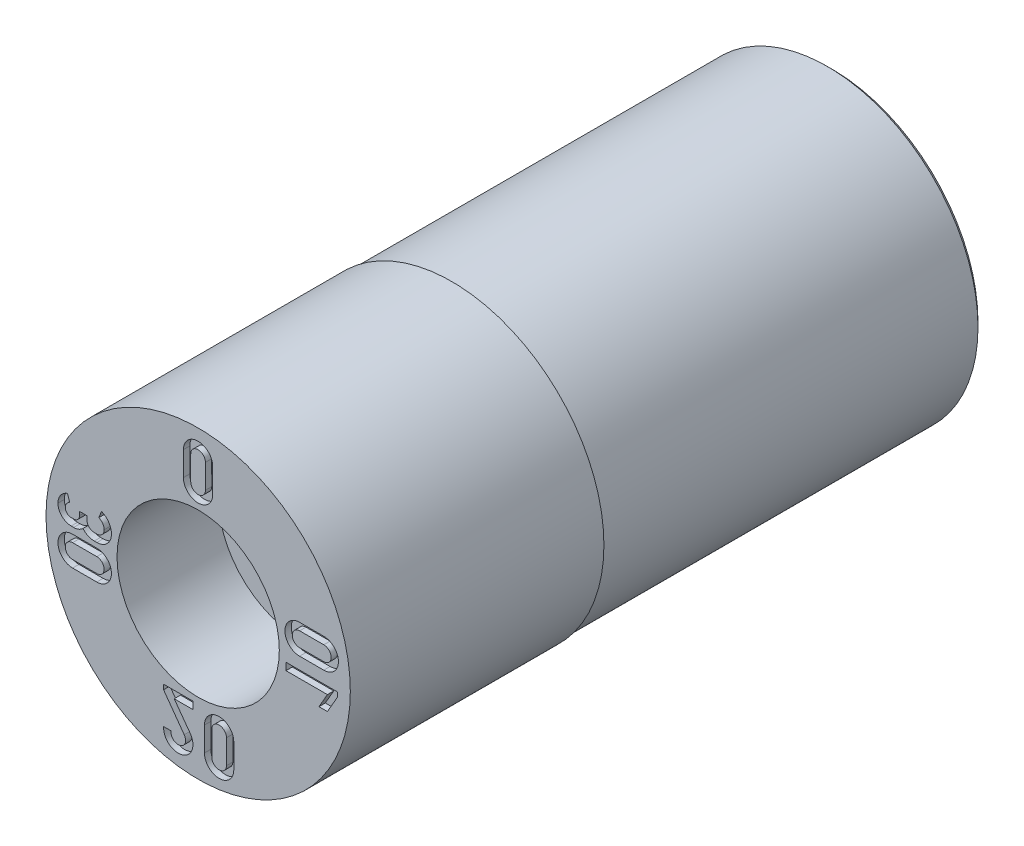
ISO-10303-21;
HEADER;
FILE_DESCRIPTION(('STEP AP214'),'2;1');
FILE_NAME('part.step','',(''),(''),'','','');
FILE_SCHEMA(('AUTOMOTIVE_DESIGN { 1 0 10303 214 1 1 1 1 }'));
ENDSEC;
DATA;
#1=APPLICATION_CONTEXT('core data for automotive mechanical design processes');
#2=APPLICATION_PROTOCOL_DEFINITION('international standard','automotive_design',2000,#1);
#3=PRODUCT_CONTEXT('',#1,'mechanical');
#4=PRODUCT('Part','Part','',(#3));
#5=PRODUCT_RELATED_PRODUCT_CATEGORY('part','',(#4));
#6=PRODUCT_DEFINITION_FORMATION('','',#4);
#7=PRODUCT_DEFINITION_CONTEXT('part definition',#1,'design');
#8=PRODUCT_DEFINITION('design','',#6,#7);
#9=PRODUCT_DEFINITION_SHAPE('','',#8);
#10=(LENGTH_UNIT() NAMED_UNIT(*) SI_UNIT(.MILLI.,.METRE.));
#11=(NAMED_UNIT(*) PLANE_ANGLE_UNIT() SI_UNIT($,.RADIAN.));
#12=(NAMED_UNIT(*) SI_UNIT($,.STERADIAN.) SOLID_ANGLE_UNIT());
#13=UNCERTAINTY_MEASURE_WITH_UNIT(LENGTH_MEASURE(1.E-05),#10,'distance_accuracy_value','');
#14=(GEOMETRIC_REPRESENTATION_CONTEXT(3) GLOBAL_UNCERTAINTY_ASSIGNED_CONTEXT((#13)) GLOBAL_UNIT_ASSIGNED_CONTEXT((#10,
#11,#12)) REPRESENTATION_CONTEXT('',''));
#15=CARTESIAN_POINT('',(0.,0.,0.));
#16=DIRECTION('',(0.,0.,1.));
#17=DIRECTION('',(1.,0.,0.));
#18=AXIS2_PLACEMENT_3D('',#15,#16,#17);
#19=CARTESIAN_POINT('',(0.,0.,3.79790950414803));
#20=DIRECTION('',(0.,0.,1.));
#21=DIRECTION('',(1.,0.,0.));
#22=AXIS2_PLACEMENT_3D('',#19,#20,#21);
#23=CYLINDRICAL_SURFACE('',#22,1.5);
#24=CARTESIAN_POINT('',(0.,0.,-19.));
#25=DIRECTION('',(0.,0.,1.));
#26=DIRECTION('',(1.,0.,0.));
#27=AXIS2_PLACEMENT_3D('',#24,#25,#26);
#28=CIRCLE('',#27,1.5);
#29=CARTESIAN_POINT('',(1.5,0.,-19.));
#30=VERTEX_POINT('',#29);
#31=EDGE_CURVE('E1155',#30,#30,#28,.T.);
#32=ORIENTED_EDGE('',*,*,#31,.F.);
#33=EDGE_LOOP('',(#32));
#34=FACE_BOUND('',#33,.T.);
#35=CARTESIAN_POINT('',(0.,0.,-7.));
#36=DIRECTION('',(0.,0.,1.));
#37=DIRECTION('',(1.,0.,0.));
#38=AXIS2_PLACEMENT_3D('',#35,#36,#37);
#39=CIRCLE('',#38,1.5);
#40=CARTESIAN_POINT('',(1.29903810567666,-0.749999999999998,-7.));
#41=VERTEX_POINT('',#40);
#42=CARTESIAN_POINT('',(0.,-1.5,-7.));
#43=VERTEX_POINT('',#42);
#44=EDGE_CURVE('E11',#41,#43,#39,.F.);
#45=ORIENTED_EDGE('',*,*,#44,.F.);
#46=CARTESIAN_POINT('',(1.29903810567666,0.749999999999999,-7.));
#47=VERTEX_POINT('',#46);
#48=EDGE_CURVE('E38',#47,#41,#39,.F.);
#49=ORIENTED_EDGE('',*,*,#48,.F.);
#50=CARTESIAN_POINT('',(0.,1.5,-7.));
#51=VERTEX_POINT('',#50);
#52=EDGE_CURVE('E525',#51,#47,#39,.F.);
#53=ORIENTED_EDGE('',*,*,#52,.F.);
#54=CARTESIAN_POINT('',(-1.29903810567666,0.749999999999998,-7.));
#55=VERTEX_POINT('',#54);
#56=EDGE_CURVE('E2210',#55,#51,#39,.F.);
#57=ORIENTED_EDGE('',*,*,#56,.F.);
#58=CARTESIAN_POINT('',(-1.29903810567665,-0.749999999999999,-7.));
#59=VERTEX_POINT('',#58);
#60=EDGE_CURVE('E2208',#59,#55,#39,.F.);
#61=ORIENTED_EDGE('',*,*,#60,.F.);
#62=EDGE_CURVE('E43',#43,#59,#39,.F.);
#63=ORIENTED_EDGE('',*,*,#62,.F.);
#64=EDGE_LOOP('',(#45,#49,#53,#57,#61,#63));
#65=FACE_BOUND('',#64,.T.);
#66=ADVANCED_FACE('F34',(#34,#65),#23,.F.);
#67=CARTESIAN_POINT('',(0.,0.,3.79790950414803));
#68=DIRECTION('',(0.,0.,1.));
#69=DIRECTION('',(1.,0.,0.));
#70=AXIS2_PLACEMENT_3D('',#67,#68,#69);
#71=CYLINDRICAL_SURFACE('',#70,6.);
#72=CARTESIAN_POINT('',(0.,0.,0.));
#73=DIRECTION('',(0.,0.,1.));
#74=DIRECTION('',(1.,0.,0.));
#75=AXIS2_PLACEMENT_3D('',#72,#73,#74);
#76=CIRCLE('',#75,6.);
#77=CARTESIAN_POINT('',(6.,0.,0.));
#78=VERTEX_POINT('',#77);
#79=EDGE_CURVE('E1164',#78,#78,#76,.T.);
#80=ORIENTED_EDGE('',*,*,#79,.F.);
#81=EDGE_LOOP('',(#80));
#82=FACE_BOUND('',#81,.T.);
#83=CARTESIAN_POINT('',(0.,0.,-10.));
#84=DIRECTION('',(0.,0.,-1.));
#85=DIRECTION('',(-1.,0.,0.));
#86=AXIS2_PLACEMENT_3D('',#83,#84,#85);
#87=CIRCLE('',#86,6.);
#88=CARTESIAN_POINT('',(-6.,0.,-10.));
#89=VERTEX_POINT('',#88);
#90=EDGE_CURVE('E1149',#89,#89,#87,.T.);
#91=ORIENTED_EDGE('',*,*,#90,.F.);
#92=EDGE_LOOP('',(#91));
#93=FACE_BOUND('',#92,.T.);
#94=ADVANCED_FACE('F36',(#82,#93),#71,.T.);
#95=CARTESIAN_POINT('',(0.,0.,-25.));
#96=DIRECTION('',(0.,0.,1.));
#97=DIRECTION('',(1.,0.,0.));
#98=AXIS2_PLACEMENT_3D('',#95,#96,#97);
#99=CONICAL_SURFACE('',#98,5.7499999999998,0.785398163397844);
#100=CARTESIAN_POINT('',(0.,0.,-25.));
#101=DIRECTION('',(0.,0.,1.));
#102=DIRECTION('',(1.,0.,0.));
#103=AXIS2_PLACEMENT_3D('',#100,#101,#102);
#104=CIRCLE('',#103,5.7499999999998);
#105=CARTESIAN_POINT('',(5.7499999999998,0.,-25.));
#106=VERTEX_POINT('',#105);
#107=EDGE_CURVE('E1145',#106,#106,#104,.T.);
#108=ORIENTED_EDGE('',*,*,#107,.T.);
#109=EDGE_LOOP('',(#108));
#110=FACE_BOUND('',#109,.T.);
#111=CARTESIAN_POINT('',(0.,0.,-24.815));
#112=DIRECTION('',(0.,0.,1.));
#113=DIRECTION('',(1.,0.,0.));
#114=AXIS2_PLACEMENT_3D('',#111,#112,#113);
#115=CIRCLE('',#114,5.935);
#116=CARTESIAN_POINT('',(5.935,0.,-24.815));
#117=VERTEX_POINT('',#116);
#118=EDGE_CURVE('E1144',#117,#117,#115,.T.);
#119=ORIENTED_EDGE('',*,*,#118,.F.);
#120=EDGE_LOOP('',(#119));
#121=FACE_BOUND('',#120,.T.);
#122=ADVANCED_FACE('F1174',(#110,#121),#99,.T.);
#123=CARTESIAN_POINT('',(0.,6.,0.));
#124=DIRECTION('',(0.,0.,-1.));
#125=DIRECTION('',(-1.,0.,0.));
#126=AXIS2_PLACEMENT_3D('',#123,#124,#125);
#127=PLANE('',#126);
#128=DIRECTION('',(0.999999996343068,-8.5521133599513E-05,0.));
#129=VECTOR('',#128,1.);
#130=CARTESIAN_POINT('',(-3.99727788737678,-1.26154552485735,0.));
#131=LINE('',#130,#129);
#132=CARTESIAN_POINT('',(-4.95129130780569,-1.26146393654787,0.));
#133=VERTEX_POINT('',#132);
#134=CARTESIAN_POINT('',(-3.99727788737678,-1.26154552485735,0.));
#135=VERTEX_POINT('',#134);
#136=EDGE_CURVE('E634',#133,#135,#131,.T.);
#137=ORIENTED_EDGE('',*,*,#136,.F.);
#138=CARTESIAN_POINT('',(-4.95124185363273,-0.683195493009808,0.));
#139=DIRECTION('',(0.,0.,1.));
#140=DIRECTION('',(1.,0.,0.));
#141=AXIS2_PLACEMENT_3D('',#138,#139,#140);
#142=CIRCLE('',#141,0.57826844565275);
#143=CARTESIAN_POINT('',(-4.95119239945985,-0.104927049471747,0.));
#144=VERTEX_POINT('',#143);
#145=EDGE_CURVE('E612',#144,#133,#142,.T.);
#146=ORIENTED_EDGE('',*,*,#145,.F.);
#147=DIRECTION('',(-0.999999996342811,8.55241324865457E-05,0.));
#148=VECTOR('',#147,1.);
#149=CARTESIAN_POINT('',(-4.95119239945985,-0.104927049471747,0.));
#150=LINE('',#149,#148);
#151=CARTESIAN_POINT('',(-3.99720239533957,-0.105008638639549,0.));
#152=VERTEX_POINT('',#151);
#153=EDGE_CURVE('E623',#152,#144,#150,.T.);
#154=ORIENTED_EDGE('',*,*,#153,.F.);
#155=CARTESIAN_POINT('',(-3.99724014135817,-0.68327708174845,0.));
#156=DIRECTION('',(0.,0.,1.));
#157=DIRECTION('',(1.,0.,0.));
#158=AXIS2_PLACEMENT_3D('',#155,#156,#157);
#159=CIRCLE('',#158,0.578268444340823);
#160=EDGE_CURVE('E637',#135,#152,#159,.T.);
#161=ORIENTED_EDGE('',*,*,#160,.F.);
#162=EDGE_LOOP('',(#137,#146,#154,#161));
#163=FACE_BOUND('',#162,.T.);
#164=DIRECTION('',(8.43544746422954E-05,-0.999999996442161,0.));
#165=VECTOR('',#164,1.);
#166=CARTESIAN_POINT('',(-0.581623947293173,4.96664454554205,0.));
#167=LINE('',#166,#165);
#168=CARTESIAN_POINT('',(-0.581623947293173,4.96664454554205,0.));
#169=VERTEX_POINT('',#168);
#170=CARTESIAN_POINT('',(-0.581543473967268,4.01265454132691,0.));
#171=VERTEX_POINT('',#170);
#172=EDGE_CURVE('E699',#169,#171,#167,.T.);
#173=ORIENTED_EDGE('',*,*,#172,.F.);
#174=CARTESIAN_POINT('',(-0.00335550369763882,4.96669332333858,0.));
#175=DIRECTION('',(0.,0.,1.));
#176=DIRECTION('',(1.,0.,0.));
#177=AXIS2_PLACEMENT_3D('',#174,#175,#176);
#178=CIRCLE('',#177,0.578268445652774);
#179=CARTESIAN_POINT('',(0.574912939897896,4.96674210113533,0.));
#180=VERTEX_POINT('',#179);
#181=EDGE_CURVE('E677',#180,#169,#178,.T.);
#182=ORIENTED_EDGE('',*,*,#181,.F.);
#183=DIRECTION('',(8.5319212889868E-05,0.999999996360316,0.));
#184=VECTOR('',#183,1.);
#185=CARTESIAN_POINT('',(0.574831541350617,4.01269500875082,0.));
#186=LINE('',#185,#184);
#187=CARTESIAN_POINT('',(0.574831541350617,4.01269500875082,0.));
#188=VERTEX_POINT('',#187);
#189=EDGE_CURVE('E688',#188,#180,#186,.T.);
#190=ORIENTED_EDGE('',*,*,#189,.F.);
#191=CARTESIAN_POINT('',(-0.00335596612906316,4.01266965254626,0.));
#192=DIRECTION('',(0.,0.,1.));
#193=DIRECTION('',(1.,0.,0.));
#194=AXIS2_PLACEMENT_3D('',#191,#192,#193);
#195=CIRCLE('',#194,0.578187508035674);
#196=EDGE_CURVE('E702',#171,#188,#195,.T.);
#197=ORIENTED_EDGE('',*,*,#196,.F.);
#198=EDGE_LOOP('',(#173,#182,#190,#197));
#199=FACE_BOUND('',#198,.T.);
#200=DIRECTION('',(-8.43514763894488E-05,0.999999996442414,0.));
#201=VECTOR('',#200,1.);
#202=CARTESIAN_POINT('',(-0.206933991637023,-3.72203762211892,0.));
#203=LINE('',#202,#201);
#204=CARTESIAN_POINT('',(-0.206933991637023,-3.72203762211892,0.));
#205=VERTEX_POINT('',#204);
#206=CARTESIAN_POINT('',(-0.206958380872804,-3.43289940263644,0.));
#207=VERTEX_POINT('',#206);
#208=EDGE_CURVE('E746',#205,#207,#203,.T.);
#209=ORIENTED_EDGE('',*,*,#208,.F.);
#210=DIRECTION('',(0.999999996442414,8.43514759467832E-05,0.));
#211=VECTOR('',#210,1.);
#212=CARTESIAN_POINT('',(-0.944176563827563,-3.72209980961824,0.));
#213=LINE('',#212,#211);
#214=CARTESIAN_POINT('',(-0.944176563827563,-3.72209980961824,0.));
#215=VERTEX_POINT('',#214);
#216=EDGE_CURVE('E709',#215,#205,#213,.T.);
#217=ORIENTED_EDGE('',*,*,#216,.F.);
#218=DIRECTION('',(-0.589622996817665,0.80767860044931,0.));
#219=VECTOR('',#218,1.);
#220=CARTESIAN_POINT('',(-0.315349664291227,-4.58348078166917,0.));
#221=LINE('',#220,#219);
#222=CARTESIAN_POINT('',(-0.315349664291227,-4.58348078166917,0.));
#223=VERTEX_POINT('',#222);
#224=EDGE_CURVE('E720',#223,#215,#221,.T.);
#225=ORIENTED_EDGE('',*,*,#224,.F.);
#226=CARTESIAN_POINT('',(-0.784771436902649,-4.92143942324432,0.));
#227=DIRECTION('',(0.,0.,1.));
#228=DIRECTION('',(1.,0.,0.));
#229=AXIS2_PLACEMENT_3D('',#226,#227,#228);
#230=CIRCLE('',#229,0.578422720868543);
#231=CARTESIAN_POINT('',(-1.36159256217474,-4.87842508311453,0.));
#232=VERTEX_POINT('',#231);
#233=EDGE_CURVE('E764',#232,#223,#230,.T.);
#234=ORIENTED_EDGE('',*,*,#233,.F.);
#235=DIRECTION('',(-0.999999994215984,-0.000107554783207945,0.));
#236=VECTOR('',#235,1.);
#237=CARTESIAN_POINT('',(-1.07081476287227,-4.87839380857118,0.));
#238=LINE('',#237,#236);
#239=CARTESIAN_POINT('',(-1.07081476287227,-4.87839380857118,0.));
#240=VERTEX_POINT('',#239);
#241=EDGE_CURVE('E761',#240,#232,#238,.T.);
#242=ORIENTED_EDGE('',*,*,#241,.F.);
#243=CARTESIAN_POINT('',(-0.784917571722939,-4.92175678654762,0.));
#244=DIRECTION('',(0.,0.,-1.));
#245=DIRECTION('',(1.,0.,0.));
#246=AXIS2_PLACEMENT_3D('',#243,#244,#245);
#247=CIRCLE('',#246,0.289166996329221);
#248=CARTESIAN_POINT('',(-0.550295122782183,-4.75273058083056,0.));
#249=VERTEX_POINT('',#248);
#250=EDGE_CURVE('E758',#249,#240,#247,.T.);
#251=ORIENTED_EDGE('',*,*,#250,.F.);
#252=DIRECTION('',(0.584527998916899,-0.811373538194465,0.));
#253=VECTOR('',#252,1.);
#254=CARTESIAN_POINT('',(-1.36331725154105,-3.62418816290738,0.));
#255=LINE('',#254,#253);
#256=CARTESIAN_POINT('',(-1.36331725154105,-3.62418816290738,0.));
#257=VERTEX_POINT('',#256);
#258=EDGE_CURVE('E755',#257,#249,#255,.T.);
#259=ORIENTED_EDGE('',*,*,#258,.F.);
#260=DIRECTION('',(8.43514743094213E-05,-0.999999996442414,0.));
#261=VECTOR('',#260,1.);
#262=CARTESIAN_POINT('',(-1.36333337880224,-3.4329969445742,0.));
#263=LINE('',#262,#261);
#264=CARTESIAN_POINT('',(-1.36333337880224,-3.4329969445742,0.));
#265=VERTEX_POINT('',#264);
#266=EDGE_CURVE('E752',#265,#257,#263,.T.);
#267=ORIENTED_EDGE('',*,*,#266,.F.);
#268=DIRECTION('',(-0.999999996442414,-8.43514755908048E-05,0.));
#269=VECTOR('',#268,1.);
#270=CARTESIAN_POINT('',(-0.206958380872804,-3.43289940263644,0.));
#271=LINE('',#270,#269);
#272=EDGE_CURVE('E749',#207,#265,#271,.T.);
#273=ORIENTED_EDGE('',*,*,#272,.F.);
#274=EDGE_LOOP('',(#209,#217,#225,#234,#242,#251,#259,#267,#273));
#275=FACE_BOUND('',#274,.T.);
#276=DIRECTION('',(8.48997848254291E-05,-0.999999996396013,0.));
#277=VECTOR('',#276,1.);
#278=CARTESIAN_POINT('',(3.46291784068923,-0.558970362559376,0.));
#279=LINE('',#278,#277);
#280=CARTESIAN_POINT('',(3.4628933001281,-0.269917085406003,0.));
#281=VERTEX_POINT('',#280);
#282=CARTESIAN_POINT('',(3.46291784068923,-0.558970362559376,0.));
#283=VERTEX_POINT('',#282);
#284=EDGE_CURVE('E812',#281,#283,#279,.T.);
#285=ORIENTED_EDGE('',*,*,#284,.F.);
#286=DIRECTION('',(-0.999999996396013,-8.48997846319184E-05,0.));
#287=VECTOR('',#286,1.);
#288=CARTESIAN_POINT('',(3.4628933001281,-0.269917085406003,0.));
#289=LINE('',#288,#287);
#290=CARTESIAN_POINT('',(5.48650907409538,-0.269745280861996,0.));
#291=VERTEX_POINT('',#290);
#292=EDGE_CURVE('E771',#291,#281,#289,.T.);
#293=ORIENTED_EDGE('',*,*,#292,.F.);
#294=DIRECTION('',(-8.48997827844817E-05,0.999999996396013,0.));
#295=VECTOR('',#294,1.);
#296=CARTESIAN_POINT('',(5.48650907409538,-0.269745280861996,0.));
#297=LINE('',#296,#295);
#298=CARTESIAN_POINT('',(5.48652523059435,-0.460046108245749,0.));
#299=VERTEX_POINT('',#298);
#300=EDGE_CURVE('E792',#299,#291,#297,.T.);
#301=ORIENTED_EDGE('',*,*,#300,.F.);
#302=DIRECTION('',(0.498418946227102,0.866936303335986,0.));
#303=VECTOR('',#302,1.);
#304=CARTESIAN_POINT('',(5.48652523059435,-0.460046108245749,0.));
#305=LINE('',#304,#303);
#306=CARTESIAN_POINT('',(5.09731997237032,-1.13701910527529,0.));
#307=VERTEX_POINT('',#306);
#308=EDGE_CURVE('E824',#307,#299,#305,.T.);
#309=ORIENTED_EDGE('',*,*,#308,.F.);
#310=DIRECTION('',(0.999999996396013,8.48997839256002E-05,0.));
#311=VECTOR('',#310,1.);
#312=CARTESIAN_POINT('',(5.09731997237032,-1.13701910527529,0.));
#313=LINE('',#312,#311);
#314=CARTESIAN_POINT('',(4.76390903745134,-1.13704741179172,0.));
#315=VERTEX_POINT('',#314);
#316=EDGE_CURVE('E821',#315,#307,#313,.T.);
#317=ORIENTED_EDGE('',*,*,#316,.F.);
#318=DIRECTION('',(-0.498285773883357,-0.867012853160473,0.));
#319=VECTOR('',#318,1.);
#320=CARTESIAN_POINT('',(4.76390903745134,-1.13704741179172,0.));
#321=LINE('',#320,#319);
#322=CARTESIAN_POINT('',(5.09621860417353,-0.558831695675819,0.));
#323=VERTEX_POINT('',#322);
#324=EDGE_CURVE('E818',#323,#315,#321,.T.);
#325=ORIENTED_EDGE('',*,*,#324,.F.);
#326=DIRECTION('',(0.999999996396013,8.48997846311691E-05,0.));
#327=VECTOR('',#326,1.);
#328=CARTESIAN_POINT('',(5.09621860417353,-0.558831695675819,0.));
#329=LINE('',#328,#327);
#330=EDGE_CURVE('E815',#283,#323,#329,.T.);
#331=ORIENTED_EDGE('',*,*,#330,.F.);
#332=EDGE_LOOP('',(#285,#293,#301,#309,#317,#325,#331));
#333=FACE_BOUND('',#332,.T.);
#334=DIRECTION('',(-0.999999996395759,-8.49027839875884E-05,0.));
#335=VECTOR('',#334,1.);
#336=CARTESIAN_POINT('',(4.95360658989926,1.36061480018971,0.));
#337=LINE('',#336,#335);
#338=CARTESIAN_POINT('',(4.95360658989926,1.3606148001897,0.));
#339=VERTEX_POINT('',#338);
#340=CARTESIAN_POINT('',(3.99961658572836,1.36053380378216,0.));
#341=VERTEX_POINT('',#340);
#342=EDGE_CURVE('E892',#339,#341,#337,.T.);
#343=ORIENTED_EDGE('',*,*,#342,.F.);
#344=CARTESIAN_POINT('',(4.95365568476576,0.782346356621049,0.));
#345=DIRECTION('',(0.,0.,1.));
#346=DIRECTION('',(1.,0.,0.));
#347=AXIS2_PLACEMENT_3D('',#344,#345,#346);
#348=CIRCLE('',#347,0.578268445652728);
#349=CARTESIAN_POINT('',(4.95370477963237,0.204077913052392,0.));
#350=VERTEX_POINT('',#349);
#351=EDGE_CURVE('E870',#350,#339,#348,.T.);
#352=ORIENTED_EDGE('',*,*,#351,.F.);
#353=DIRECTION('',(0.999999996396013,8.48997850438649E-05,0.));
#354=VECTOR('',#353,1.);
#355=CARTESIAN_POINT('',(3.99969135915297,0.203996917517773,0.));
#356=LINE('',#355,#354);
#357=CARTESIAN_POINT('',(3.99969135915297,0.203996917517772,0.));
#358=VERTEX_POINT('',#357);
#359=EDGE_CURVE('E881',#358,#350,#356,.T.);
#360=ORIENTED_EDGE('',*,*,#359,.F.);
#361=CARTESIAN_POINT('',(3.99966568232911,0.782265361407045,0.));
#362=DIRECTION('',(0.,0.,1.));
#363=DIRECTION('',(1.,0.,0.));
#364=AXIS2_PLACEMENT_3D('',#361,#362,#363);
#365=CIRCLE('',#364,0.578268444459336);
#366=EDGE_CURVE('E895',#341,#358,#365,.T.);
#367=ORIENTED_EDGE('',*,*,#366,.F.);
#368=EDGE_LOOP('',(#343,#352,#360,#367));
#369=FACE_BOUND('',#368,.T.);
#370=DIRECTION('',(-0.999999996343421,8.55170029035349E-05,0.));
#371=VECTOR('',#370,1.);
#372=CARTESIAN_POINT('',(-3.99650255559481,0.377197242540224,0.));
#373=LINE('',#372,#371);
#374=CARTESIAN_POINT('',(-3.99650255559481,0.377197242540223,0.));
#375=VERTEX_POINT('',#374);
#376=CARTESIAN_POINT('',(-4.09768589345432,0.377205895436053,0.));
#377=VERTEX_POINT('',#376);
#378=EDGE_CURVE('E975',#375,#377,#373,.T.);
#379=ORIENTED_EDGE('',*,*,#378,.F.);
#380=CARTESIAN_POINT('',(-3.99647783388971,0.66628251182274,0.));
#381=DIRECTION('',(0.,0.,-1.));
#382=DIRECTION('',(1.,0.,0.));
#383=AXIS2_PLACEMENT_3D('',#380,#381,#382);
#384=CIRCLE('',#383,0.289085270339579);
#385=CARTESIAN_POINT('',(-3.7073925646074,0.666257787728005,0.));
#386=VERTEX_POINT('',#385);
#387=EDGE_CURVE('E902',#386,#375,#384,.T.);
#388=ORIENTED_EDGE('',*,*,#387,.F.);
#389=CARTESIAN_POINT('',(-4.03990899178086,0.666286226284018,0.));
#390=DIRECTION('',(0.,0.,-1.));
#391=DIRECTION('',(1.,0.,0.));
#392=AXIS2_PLACEMENT_3D('',#389,#390,#391);
#393=CIRCLE('',#392,0.332516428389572);
#394=CARTESIAN_POINT('',(-3.9178380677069,0.97558521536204,0.));
#395=VERTEX_POINT('',#394);
#396=EDGE_CURVE('E913',#395,#386,#393,.T.);
#397=ORIENTED_EDGE('',*,*,#396,.F.);
#398=DIRECTION('',(-0.367087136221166,-0.930186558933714,0.));
#399=VECTOR('',#398,1.);
#400=CARTESIAN_POINT('',(-3.81174380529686,1.24442453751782,0.));
#401=LINE('',#400,#399);
#402=CARTESIAN_POINT('',(-3.81174380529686,1.24442453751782,0.));
#403=VERTEX_POINT('',#402);
#404=EDGE_CURVE('E1029',#403,#395,#401,.T.);
#405=ORIENTED_EDGE('',*,*,#404,.F.);
#406=CARTESIAN_POINT('',(-4.04005070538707,0.666150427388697,0.));
#407=DIRECTION('',(0.,0.,1.));
#408=DIRECTION('',(1.,0.,0.));
#409=AXIS2_PLACEMENT_3D('',#406,#407,#408);
#410=CIRCLE('',#409,0.621711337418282);
#411=CARTESIAN_POINT('',(-3.4183393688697,0.66618389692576,0.));
#412=VERTEX_POINT('',#411);
#413=EDGE_CURVE('E1026',#412,#403,#410,.T.);
#414=ORIENTED_EDGE('',*,*,#413,.F.);
#415=CARTESIAN_POINT('',(-3.99642908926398,0.666152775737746,0.));
#416=DIRECTION('',(0.,0.,1.));
#417=DIRECTION('',(1.,0.,0.));
#418=AXIS2_PLACEMENT_3D('',#415,#416,#417);
#419=CIRCLE('',#418,0.578089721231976);
#420=CARTESIAN_POINT('',(-3.99647837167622,0.0880630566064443,0.));
#421=VERTEX_POINT('',#420);
#422=EDGE_CURVE('E1023',#421,#412,#419,.T.);
#423=ORIENTED_EDGE('',*,*,#422,.F.);
#424=DIRECTION('',(0.99999999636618,-8.52504561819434E-05,0.));
#425=VECTOR('',#424,1.);
#426=CARTESIAN_POINT('',(-4.0976987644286,0.0880716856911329,0.));
#427=LINE('',#426,#425);
#428=CARTESIAN_POINT('',(-4.0976987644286,0.0880716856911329,0.));
#429=VERTEX_POINT('',#428);
#430=EDGE_CURVE('E1020',#429,#421,#427,.T.);
#431=ORIENTED_EDGE('',*,*,#430,.F.);
#432=CARTESIAN_POINT('',(-4.09778853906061,0.666016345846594,0.));
#433=DIRECTION('',(0.,0.,1.));
#434=DIRECTION('',(1.,0.,0.));
#435=AXIS2_PLACEMENT_3D('',#432,#433,#434);
#436=CIRCLE('',#435,0.577944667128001);
#437=CARTESIAN_POINT('',(-4.54167311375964,0.295899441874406,0.));
#438=VERTEX_POINT('',#437);
#439=EDGE_CURVE('E1017',#438,#429,#436,.T.);
#440=ORIENTED_EDGE('',*,*,#439,.F.);
#441=CARTESIAN_POINT('',(-4.90707275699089,0.666080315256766,0.));
#442=DIRECTION('',(0.,0.,1.));
#443=DIRECTION('',(1.,0.,0.));
#444=AXIS2_PLACEMENT_3D('',#441,#442,#443);
#445=CIRCLE('',#444,0.520144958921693);
#446=CARTESIAN_POINT('',(-4.90711744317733,0.145935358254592,0.));
#447=VERTEX_POINT('',#446);
#448=EDGE_CURVE('E1014',#447,#438,#445,.T.);
#449=ORIENTED_EDGE('',*,*,#448,.F.);
#450=DIRECTION('',(0.999999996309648,-8.59110265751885E-05,0.));
#451=VECTOR('',#450,1.);
#452=CARTESIAN_POINT('',(-5.00825803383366,0.145944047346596,0.));
#453=LINE('',#452,#451);
#454=CARTESIAN_POINT('',(-5.00825803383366,0.145944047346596,0.));
#455=VERTEX_POINT('',#454);
#456=EDGE_CURVE('E1011',#455,#447,#453,.T.);
#457=ORIENTED_EDGE('',*,*,#456,.F.);
#458=CARTESIAN_POINT('',(-5.00829390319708,0.66626251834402,0.));
#459=DIRECTION('',(0.,0.,1.));
#460=DIRECTION('',(1.,0.,0.));
#461=AXIS2_PLACEMENT_3D('',#458,#459,#460);
#462=CIRCLE('',#461,0.520318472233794);
#463=CARTESIAN_POINT('',(-5.52861235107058,0.666421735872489,0.));
#464=VERTEX_POINT('',#463);
#465=EDGE_CURVE('E1008',#464,#455,#462,.T.);
#466=ORIENTED_EDGE('',*,*,#465,.F.);
#467=CARTESIAN_POINT('',(-4.97919461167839,0.666253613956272,0.));
#468=DIRECTION('',(0.,0.,1.));
#469=DIRECTION('',(1.,0.,0.));
#470=AXIS2_PLACEMENT_3D('',#467,#468,#469);
#471=CIRCLE('',#470,0.549417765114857);
#472=CARTESIAN_POINT('',(-5.15512372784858,1.18674264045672,0.));
#473=VERTEX_POINT('',#472);
#474=EDGE_CURVE('E1005',#473,#464,#471,.T.);
#475=ORIENTED_EDGE('',*,*,#474,.F.);
#476=DIRECTION('',(-0.319923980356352,0.94744321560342,0.));
#477=VECTOR('',#476,1.);
#478=CARTESIAN_POINT('',(-5.06262622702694,0.912814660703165,0.));
#479=LINE('',#478,#477);
#480=CARTESIAN_POINT('',(-5.06262622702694,0.912814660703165,0.));
#481=VERTEX_POINT('',#480);
#482=EDGE_CURVE('E1002',#481,#473,#479,.T.);
#483=ORIENTED_EDGE('',*,*,#482,.F.);
#484=CARTESIAN_POINT('',(-4.97968025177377,0.666577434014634,0.));
#485=DIRECTION('',(0.,0.,-1.));
#486=DIRECTION('',(1.,0.,0.));
#487=AXIS2_PLACEMENT_3D('',#484,#485,#486);
#488=CIRCLE('',#487,0.259832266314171);
#489=CARTESIAN_POINT('',(-5.23951241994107,0.666351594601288,0.));
#490=VERTEX_POINT('',#489);
#491=EDGE_CURVE('E999',#490,#481,#488,.T.);
#492=ORIENTED_EDGE('',*,*,#491,.F.);
#493=CARTESIAN_POINT('',(-5.00803786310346,0.666552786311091,0.));
#494=DIRECTION('',(0.,0.,-1.));
#495=DIRECTION('',(1.,0.,0.));
#496=AXIS2_PLACEMENT_3D('',#493,#494,#495);
#497=CIRCLE('',#496,0.231474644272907);
#498=CARTESIAN_POINT('',(-5.00826205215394,0.435078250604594,0.));
#499=VERTEX_POINT('',#498);
#500=EDGE_CURVE('E996',#499,#490,#497,.T.);
#501=ORIENTED_EDGE('',*,*,#500,.F.);
#502=DIRECTION('',(-0.999999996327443,8.57036442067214E-05,0.));
#503=VECTOR('',#502,1.);
#504=CARTESIAN_POINT('',(-4.90709271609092,0.435069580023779,0.));
#505=LINE('',#504,#503);
#506=CARTESIAN_POINT('',(-4.90709271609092,0.435069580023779,0.));
#507=VERTEX_POINT('',#506);
#508=EDGE_CURVE('E993',#507,#499,#505,.T.);
#509=ORIENTED_EDGE('',*,*,#508,.F.);
#510=CARTESIAN_POINT('',(-4.90707289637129,0.666328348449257,0.));
#511=DIRECTION('',(0.,0.,-1.));
#512=DIRECTION('',(1.,0.,0.));
#513=AXIS2_PLACEMENT_3D('',#510,#511,#512);
#514=CIRCLE('',#513,0.231258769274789);
#515=CARTESIAN_POINT('',(-4.67581412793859,0.666308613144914,0.));
#516=VERTEX_POINT('',#515);
#517=EDGE_CURVE('E990',#516,#507,#514,.T.);
#518=ORIENTED_EDGE('',*,*,#517,.F.);
#519=DIRECTION('',(-8.55211336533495E-05,-0.999999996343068,0.));
#520=VECTOR('',#519,1.);
#521=CARTESIAN_POINT('',(-4.67580177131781,0.810794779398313,0.));
#522=LINE('',#521,#520);
#523=CARTESIAN_POINT('',(-4.67580177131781,0.810794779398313,0.));
#524=VERTEX_POINT('',#523);
#525=EDGE_CURVE('E987',#524,#516,#522,.T.);
#526=ORIENTED_EDGE('',*,*,#525,.F.);
#527=DIRECTION('',(-0.999999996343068,8.55211334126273E-05,0.));
#528=VECTOR('',#527,1.);
#529=CARTESIAN_POINT('',(-4.38666754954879,0.810770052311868,0.));
#530=LINE('',#529,#528);
#531=CARTESIAN_POINT('',(-4.38666754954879,0.810770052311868,0.));
#532=VERTEX_POINT('',#531);
#533=EDGE_CURVE('E984',#532,#524,#530,.T.);
#534=ORIENTED_EDGE('',*,*,#533,.F.);
#535=DIRECTION('',(8.54959125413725E-05,0.999999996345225,0.));
#536=VECTOR('',#535,1.);
#537=CARTESIAN_POINT('',(-4.38667990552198,0.666248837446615,0.));
#538=LINE('',#537,#536);
#539=CARTESIAN_POINT('',(-4.38667990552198,0.666248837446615,0.));
#540=VERTEX_POINT('',#539);
#541=EDGE_CURVE('E981',#540,#532,#538,.T.);
#542=ORIENTED_EDGE('',*,*,#541,.F.);
#543=CARTESIAN_POINT('',(-4.09766167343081,0.666224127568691,0.));
#544=DIRECTION('',(0.,0.,-1.));
#545=DIRECTION('',(1.,0.,0.));
#546=AXIS2_PLACEMENT_3D('',#543,#544,#545);
#547=CIRCLE('',#546,0.289018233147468);
#548=EDGE_CURVE('E978',#377,#540,#547,.T.);
#549=ORIENTED_EDGE('',*,*,#548,.F.);
#550=EDGE_LOOP('',(#379,#388,#397,#405,#414,#423,#431,#440,#449,#457,#466,#475,#483,#492,#501,
#509,#518,#526,#534,#542,#549));
#551=FACE_BOUND('',#550,.T.);
#552=DIRECTION('',(8.53270660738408E-05,0.999999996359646,0.));
#553=VECTOR('',#552,1.);
#554=CARTESIAN_POINT('',(1.40468179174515,-4.97642787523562,0.));
#555=LINE('',#554,#553);
#556=CARTESIAN_POINT('',(1.40468179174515,-4.97642787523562,0.));
#557=VERTEX_POINT('',#556);
#558=CARTESIAN_POINT('',(1.40476319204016,-4.0224481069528,0.));
#559=VERTEX_POINT('',#558);
#560=EDGE_CURVE('E1125',#557,#559,#555,.T.);
#561=ORIENTED_EDGE('',*,*,#560,.F.);
#562=CARTESIAN_POINT('',(0.826413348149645,-4.97647665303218,0.));
#563=DIRECTION('',(0.,0.,1.));
#564=DIRECTION('',(1.,0.,0.));
#565=AXIS2_PLACEMENT_3D('',#562,#563,#564);
#566=CIRCLE('',#565,0.578268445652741);
#567=CARTESIAN_POINT('',(0.248144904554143,-4.97652543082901,0.));
#568=VERTEX_POINT('',#567);
#569=EDGE_CURVE('E1103',#568,#557,#566,.T.);
#570=ORIENTED_EDGE('',*,*,#569,.F.);
#571=DIRECTION('',(8.43514759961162E-05,-0.999999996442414,0.));
#572=VECTOR('',#571,1.);
#573=CARTESIAN_POINT('',(0.248064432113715,-4.0225120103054,0.));
#574=LINE('',#573,#572);
#575=CARTESIAN_POINT('',(0.248064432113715,-4.0225120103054,0.));
#576=VERTEX_POINT('',#575);
#577=EDGE_CURVE('E1114',#576,#568,#574,.T.);
#578=ORIENTED_EDGE('',*,*,#577,.F.);
#579=CARTESIAN_POINT('',(0.826413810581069,-4.02245298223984,0.));
#580=DIRECTION('',(0.,0.,1.));
#581=DIRECTION('',(1.,0.,0.));
#582=AXIS2_PLACEMENT_3D('',#579,#580,#581);
#583=CIRCLE('',#582,0.578349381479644);
#584=EDGE_CURVE('E1128',#559,#576,#583,.T.);
#585=ORIENTED_EDGE('',*,*,#584,.F.);
#586=EDGE_LOOP('',(#561,#570,#578,#585));
#587=FACE_BOUND('',#586,.T.);
#588=CARTESIAN_POINT('',(0.,0.,0.));
#589=DIRECTION('',(0.,0.,1.));
#590=DIRECTION('',(1.,0.,0.));
#591=AXIS2_PLACEMENT_3D('',#588,#589,#590);
#592=CIRCLE('',#591,3.2);
#593=CARTESIAN_POINT('',(3.2,0.,0.));
#594=VERTEX_POINT('',#593);
#595=EDGE_CURVE('E1161',#594,#594,#592,.T.);
#596=ORIENTED_EDGE('',*,*,#595,.F.);
#597=EDGE_LOOP('',(#596));
#598=FACE_BOUND('',#597,.T.);
#599=ORIENTED_EDGE('',*,*,#79,.T.);
#600=EDGE_LOOP('',(#599));
#601=FACE_BOUND('',#600,.T.);
#602=ADVANCED_FACE('F1180',(#163,#199,#275,#333,#369,#551,#587,#598,#601),#127,.F.);
#603=CARTESIAN_POINT('',(0.,0.,3.79790950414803));
#604=DIRECTION('',(0.,0.,1.));
#605=DIRECTION('',(1.,0.,0.));
#606=AXIS2_PLACEMENT_3D('',#603,#604,#605);
#607=CYLINDRICAL_SURFACE('',#606,3.2);
#608=CARTESIAN_POINT('',(0.,0.,-4.));
#609=DIRECTION('',(0.,0.,1.));
#610=DIRECTION('',(1.,0.,0.));
#611=AXIS2_PLACEMENT_3D('',#608,#609,#610);
#612=CIRCLE('',#611,3.2);
#613=CARTESIAN_POINT('',(3.2,0.,-4.));
#614=VERTEX_POINT('',#613);
#615=EDGE_CURVE('E1158',#614,#614,#612,.T.);
#616=ORIENTED_EDGE('',*,*,#615,.F.);
#617=EDGE_LOOP('',(#616));
#618=FACE_BOUND('',#617,.T.);
#619=ORIENTED_EDGE('',*,*,#595,.T.);
#620=EDGE_LOOP('',(#619));
#621=FACE_BOUND('',#620,.T.);
#622=ADVANCED_FACE('F1188',(#618,#621),#607,.F.);
#623=CARTESIAN_POINT('',(0.,3.2,-4.));
#624=DIRECTION('',(0.,0.,-1.));
#625=DIRECTION('',(-1.,0.,0.));
#626=AXIS2_PLACEMENT_3D('',#623,#624,#625);
#627=PLANE('',#626);
#628=DIRECTION('',(-1.,0.,0.));
#629=VECTOR('',#628,1.);
#630=CARTESIAN_POINT('',(0.866025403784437,1.5,-4.));
#631=LINE('',#630,#629);
#632=CARTESIAN_POINT('',(0.866025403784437,1.5,-4.));
#633=VERTEX_POINT('',#632);
#634=CARTESIAN_POINT('',(-0.866025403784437,1.5,-4.));
#635=VERTEX_POINT('',#634);
#636=EDGE_CURVE('E50',#633,#635,#631,.T.);
#637=ORIENTED_EDGE('',*,*,#636,.F.);
#638=DIRECTION('',(-0.5,0.866025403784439,0.));
#639=VECTOR('',#638,1.);
#640=CARTESIAN_POINT('',(1.73205080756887,0.,-4.));
#641=LINE('',#640,#639);
#642=CARTESIAN_POINT('',(1.73205080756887,0.,-4.));
#643=VERTEX_POINT('',#642);
#644=EDGE_CURVE('E534',#643,#633,#641,.T.);
#645=ORIENTED_EDGE('',*,*,#644,.F.);
#646=DIRECTION('',(0.5,0.866025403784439,0.));
#647=VECTOR('',#646,1.);
#648=CARTESIAN_POINT('',(0.866025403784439,-1.5,-4.));
#649=LINE('',#648,#647);
#650=CARTESIAN_POINT('',(0.866025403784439,-1.5,-4.));
#651=VERTEX_POINT('',#650);
#652=EDGE_CURVE('E528',#651,#643,#649,.T.);
#653=ORIENTED_EDGE('',*,*,#652,.F.);
#654=DIRECTION('',(1.,0.,0.));
#655=VECTOR('',#654,1.);
#656=CARTESIAN_POINT('',(-0.866025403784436,-1.5,-4.));
#657=LINE('',#656,#655);
#658=CARTESIAN_POINT('',(-0.866025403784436,-1.5,-4.));
#659=VERTEX_POINT('',#658);
#660=EDGE_CURVE('E568',#659,#651,#657,.T.);
#661=ORIENTED_EDGE('',*,*,#660,.F.);
#662=DIRECTION('',(0.5,-0.866025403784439,0.));
#663=VECTOR('',#662,1.);
#664=CARTESIAN_POINT('',(-1.73205080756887,0.,-4.));
#665=LINE('',#664,#663);
#666=CARTESIAN_POINT('',(-1.73205080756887,0.,-4.));
#667=VERTEX_POINT('',#666);
#668=EDGE_CURVE('E565',#667,#659,#665,.T.);
#669=ORIENTED_EDGE('',*,*,#668,.F.);
#670=DIRECTION('',(-0.5,-0.866025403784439,0.));
#671=VECTOR('',#670,1.);
#672=CARTESIAN_POINT('',(-0.866025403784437,1.5,-4.));
#673=LINE('',#672,#671);
#674=EDGE_CURVE('E562',#635,#667,#673,.T.);
#675=ORIENTED_EDGE('',*,*,#674,.F.);
#676=EDGE_LOOP('',(#637,#645,#653,#661,#669,#675));
#677=FACE_BOUND('',#676,.T.);
#678=ORIENTED_EDGE('',*,*,#615,.T.);
#679=EDGE_LOOP('',(#678));
#680=FACE_BOUND('',#679,.T.);
#681=ADVANCED_FACE('F1195',(#677,#680),#627,.F.);
#682=CARTESIAN_POINT('',(0.,1.5,-19.));
#683=DIRECTION('',(0.,0.,1.));
#684=DIRECTION('',(1.,0.,0.));
#685=AXIS2_PLACEMENT_3D('',#682,#683,#684);
#686=PLANE('',#685);
#687=CARTESIAN_POINT('',(0.,0.,-19.));
#688=DIRECTION('',(0.,0.,1.));
#689=DIRECTION('',(1.,0.,0.));
#690=AXIS2_PLACEMENT_3D('',#687,#688,#689);
#691=CIRCLE('',#690,3.);
#692=CARTESIAN_POINT('',(3.,0.,-19.));
#693=VERTEX_POINT('',#692);
#694=EDGE_CURVE('E1152',#693,#693,#691,.T.);
#695=ORIENTED_EDGE('',*,*,#694,.F.);
#696=EDGE_LOOP('',(#695));
#697=FACE_BOUND('',#696,.T.);
#698=ORIENTED_EDGE('',*,*,#31,.T.);
#699=EDGE_LOOP('',(#698));
#700=FACE_BOUND('',#699,.T.);
#701=ADVANCED_FACE('F1352',(#697,#700),#686,.F.);
#702=CARTESIAN_POINT('',(0.,0.,3.79790950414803));
#703=DIRECTION('',(0.,0.,1.));
#704=DIRECTION('',(1.,0.,0.));
#705=AXIS2_PLACEMENT_3D('',#702,#703,#704);
#706=CYLINDRICAL_SURFACE('',#705,3.);
#707=CARTESIAN_POINT('',(0.,0.,-25.));
#708=DIRECTION('',(0.,0.,1.));
#709=DIRECTION('',(1.,0.,0.));
#710=AXIS2_PLACEMENT_3D('',#707,#708,#709);
#711=CIRCLE('',#710,3.);
#712=CARTESIAN_POINT('',(3.,0.,-25.));
#713=VERTEX_POINT('',#712);
#714=EDGE_CURVE('E1148',#713,#713,#711,.T.);
#715=ORIENTED_EDGE('',*,*,#714,.F.);
#716=EDGE_LOOP('',(#715));
#717=FACE_BOUND('',#716,.T.);
#718=ORIENTED_EDGE('',*,*,#694,.T.);
#719=EDGE_LOOP('',(#718));
#720=FACE_BOUND('',#719,.T.);
#721=ADVANCED_FACE('F1348',(#717,#720),#706,.F.);
#722=CARTESIAN_POINT('',(0.,3.,-25.));
#723=DIRECTION('',(0.,0.,1.));
#724=DIRECTION('',(1.,0.,0.));
#725=AXIS2_PLACEMENT_3D('',#722,#723,#724);
#726=PLANE('',#725);
#727=ORIENTED_EDGE('',*,*,#107,.F.);
#728=EDGE_LOOP('',(#727));
#729=FACE_BOUND('',#728,.T.);
#730=ORIENTED_EDGE('',*,*,#714,.T.);
#731=EDGE_LOOP('',(#730));
#732=FACE_BOUND('',#731,.T.);
#733=ADVANCED_FACE('F1343',(#729,#732),#726,.F.);
#734=CARTESIAN_POINT('',(0.,6.935,-10.));
#735=DIRECTION('',(0.,0.,-1.));
#736=DIRECTION('',(-1.,0.,0.));
#737=AXIS2_PLACEMENT_3D('',#734,#735,#736);
#738=PLANE('',#737);
#739=CARTESIAN_POINT('',(0.,0.,-10.));
#740=DIRECTION('',(0.,0.,1.));
#741=DIRECTION('',(1.,0.,0.));
#742=AXIS2_PLACEMENT_3D('',#739,#740,#741);
#743=CIRCLE('',#742,5.935);
#744=CARTESIAN_POINT('',(5.935,0.,-10.));
#745=VERTEX_POINT('',#744);
#746=EDGE_CURVE('E1135',#745,#745,#743,.T.);
#747=ORIENTED_EDGE('',*,*,#746,.T.);
#748=EDGE_LOOP('',(#747));
#749=FACE_BOUND('',#748,.T.);
#750=ORIENTED_EDGE('',*,*,#90,.T.);
#751=EDGE_LOOP('',(#750));
#752=FACE_BOUND('',#751,.T.);
#753=ADVANCED_FACE('F1171',(#749,#752),#738,.T.);
#754=CARTESIAN_POINT('',(0.,0.,0.));
#755=DIRECTION('',(0.,0.,1.));
#756=DIRECTION('',(1.,0.,0.));
#757=AXIS2_PLACEMENT_3D('',#754,#755,#756);
#758=CYLINDRICAL_SURFACE('',#757,5.935);
#759=ORIENTED_EDGE('',*,*,#746,.F.);
#760=EDGE_LOOP('',(#759));
#761=FACE_BOUND('',#760,.T.);
#762=ORIENTED_EDGE('',*,*,#118,.T.);
#763=EDGE_LOOP('',(#762));
#764=FACE_BOUND('',#763,.T.);
#765=ADVANCED_FACE('F1338',(#761,#764),#758,.T.);
#766=CARTESIAN_POINT('',(0.826413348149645,-4.97647665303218,-0.25));
#767=DIRECTION('',(0.,0.,1.));
#768=DIRECTION('',(1.,0.,0.));
#769=AXIS2_PLACEMENT_3D('',#766,#767,#768);
#770=CYLINDRICAL_SURFACE('',#769,0.578268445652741);
#771=ORIENTED_EDGE('',*,*,#569,.T.);
#772=DIRECTION('',(0.,0.,1.));
#773=VECTOR('',#772,1.);
#774=CARTESIAN_POINT('',(1.40468179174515,-4.97642787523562,-0.25));
#775=LINE('',#774,#773);
#776=CARTESIAN_POINT('',(1.40468179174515,-4.97642787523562,-0.25));
#777=VERTEX_POINT('',#776);
#778=EDGE_CURVE('E1123',#777,#557,#775,.T.);
#779=ORIENTED_EDGE('',*,*,#778,.F.);
#780=CARTESIAN_POINT('',(0.826413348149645,-4.97647665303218,-0.25));
#781=DIRECTION('',(0.,0.,1.));
#782=DIRECTION('',(1.,0.,0.));
#783=AXIS2_PLACEMENT_3D('',#780,#781,#782);
#784=CIRCLE('',#783,0.578268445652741);
#785=CARTESIAN_POINT('',(0.248144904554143,-4.97652543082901,-0.25));
#786=VERTEX_POINT('',#785);
#787=EDGE_CURVE('E1110',#786,#777,#784,.T.);
#788=ORIENTED_EDGE('',*,*,#787,.F.);
#789=DIRECTION('',(0.,0.,1.));
#790=VECTOR('',#789,1.);
#791=CARTESIAN_POINT('',(0.248144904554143,-4.97652543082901,-0.25));
#792=LINE('',#791,#790);
#793=EDGE_CURVE('E1133',#786,#568,#792,.T.);
#794=ORIENTED_EDGE('',*,*,#793,.T.);
#795=EDGE_LOOP('',(#771,#779,#788,#794));
#796=FACE_BOUND('',#795,.T.);
#797=ADVANCED_FACE('F1310',(#796),#770,.F.);
#798=CARTESIAN_POINT('',(0.248064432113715,-4.0225120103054,-0.25));
#799=DIRECTION('',(-0.999999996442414,-8.43514759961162E-05,0.));
#800=DIRECTION('',(8.43514759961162E-05,-0.999999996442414,0.));
#801=AXIS2_PLACEMENT_3D('',#798,#799,#800);
#802=PLANE('',#801);
#803=ORIENTED_EDGE('',*,*,#577,.T.);
#804=ORIENTED_EDGE('',*,*,#793,.F.);
#805=DIRECTION('',(8.43514759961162E-05,-0.999999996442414,0.));
#806=VECTOR('',#805,1.);
#807=CARTESIAN_POINT('',(0.248064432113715,-4.0225120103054,-0.25));
#808=LINE('',#807,#806);
#809=CARTESIAN_POINT('',(0.248064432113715,-4.0225120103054,-0.25));
#810=VERTEX_POINT('',#809);
#811=EDGE_CURVE('E1120',#810,#786,#808,.T.);
#812=ORIENTED_EDGE('',*,*,#811,.F.);
#813=DIRECTION('',(0.,0.,1.));
#814=VECTOR('',#813,1.);
#815=CARTESIAN_POINT('',(0.248064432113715,-4.0225120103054,-0.25));
#816=LINE('',#815,#814);
#817=EDGE_CURVE('E1136',#810,#576,#816,.T.);
#818=ORIENTED_EDGE('',*,*,#817,.T.);
#819=EDGE_LOOP('',(#803,#804,#812,#818));
#820=FACE_BOUND('',#819,.T.);
#821=ADVANCED_FACE('F1313',(#820),#802,.F.);
#822=CARTESIAN_POINT('',(0.826413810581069,-4.02245298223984,-0.25));
#823=DIRECTION('',(0.,0.,1.));
#824=DIRECTION('',(1.,0.,0.));
#825=AXIS2_PLACEMENT_3D('',#822,#823,#824);
#826=CYLINDRICAL_SURFACE('',#825,0.578349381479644);
#827=ORIENTED_EDGE('',*,*,#584,.T.);
#828=ORIENTED_EDGE('',*,*,#817,.F.);
#829=CARTESIAN_POINT('',(0.826413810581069,-4.02245298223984,-0.25));
#830=DIRECTION('',(0.,0.,1.));
#831=DIRECTION('',(1.,0.,0.));
#832=AXIS2_PLACEMENT_3D('',#829,#830,#831);
#833=CIRCLE('',#832,0.578349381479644);
#834=CARTESIAN_POINT('',(1.40476319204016,-4.0224481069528,-0.25));
#835=VERTEX_POINT('',#834);
#836=EDGE_CURVE('E1117',#835,#810,#833,.T.);
#837=ORIENTED_EDGE('',*,*,#836,.F.);
#838=DIRECTION('',(0.,0.,1.));
#839=VECTOR('',#838,1.);
#840=CARTESIAN_POINT('',(1.40476319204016,-4.0224481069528,-0.25));
#841=LINE('',#840,#839);
#842=EDGE_CURVE('E1138',#835,#559,#841,.T.);
#843=ORIENTED_EDGE('',*,*,#842,.T.);
#844=EDGE_LOOP('',(#827,#828,#837,#843));
#845=FACE_BOUND('',#844,.T.);
#846=ADVANCED_FACE('F1315',(#845),#826,.F.);
#847=CARTESIAN_POINT('',(1.40468179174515,-4.97642787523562,-0.25));
#848=DIRECTION('',(0.999999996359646,-8.53270660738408E-05,0.));
#849=DIRECTION('',(8.53270660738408E-05,0.999999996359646,0.));
#850=AXIS2_PLACEMENT_3D('',#847,#848,#849);
#851=PLANE('',#850);
#852=ORIENTED_EDGE('',*,*,#560,.T.);
#853=ORIENTED_EDGE('',*,*,#842,.F.);
#854=DIRECTION('',(8.53270660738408E-05,0.999999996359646,0.));
#855=VECTOR('',#854,1.);
#856=CARTESIAN_POINT('',(1.40468179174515,-4.97642787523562,-0.25));
#857=LINE('',#856,#855);
#858=EDGE_CURVE('E1113',#777,#835,#857,.T.);
#859=ORIENTED_EDGE('',*,*,#858,.F.);
#860=ORIENTED_EDGE('',*,*,#778,.T.);
#861=EDGE_LOOP('',(#852,#853,#859,#860));
#862=FACE_BOUND('',#861,.T.);
#863=ADVANCED_FACE('F1305',(#862),#851,.F.);
#864=CARTESIAN_POINT('',(0.826413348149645,-4.97647665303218,-0.25));
#865=DIRECTION('',(0.,0.,1.));
#866=DIRECTION('',(1.,0.,0.));
#867=AXIS2_PLACEMENT_3D('',#864,#865,#866);
#868=PLANE('',#867);
#869=DIRECTION('',(8.53190860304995E-05,0.999999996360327,0.));
#870=VECTOR('',#869,1.);
#871=CARTESIAN_POINT('',(1.11546662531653,-4.97645227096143,-0.25));
#872=LINE('',#871,#870);
#873=CARTESIAN_POINT('',(1.11546662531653,-4.97645227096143,-0.25));
#874=VERTEX_POINT('',#873);
#875=CARTESIAN_POINT('',(1.11554802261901,-4.02241834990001,-0.25));
#876=VERTEX_POINT('',#875);
#877=EDGE_CURVE('E1087',#874,#876,#872,.T.);
#878=ORIENTED_EDGE('',*,*,#877,.F.);
#879=CARTESIAN_POINT('',(0.826413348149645,-4.97647665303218,-0.25));
#880=DIRECTION('',(0.,0.,1.));
#881=DIRECTION('',(1.,0.,0.));
#882=AXIS2_PLACEMENT_3D('',#879,#880,#881);
#883=CIRCLE('',#882,0.289053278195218);
#884=CARTESIAN_POINT('',(0.537360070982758,-4.97650103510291,-0.25));
#885=VERTEX_POINT('',#884);
#886=EDGE_CURVE('E1084',#885,#874,#883,.T.);
#887=ORIENTED_EDGE('',*,*,#886,.F.);
#888=DIRECTION('',(8.43514751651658E-05,-0.999999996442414,0.));
#889=VECTOR('',#888,1.);
#890=CARTESIAN_POINT('',(0.537279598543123,-4.02248761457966,-0.25));
#891=LINE('',#890,#889);
#892=CARTESIAN_POINT('',(0.537279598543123,-4.02248761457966,-0.25));
#893=VERTEX_POINT('',#892);
#894=EDGE_CURVE('E1080',#893,#885,#891,.T.);
#895=ORIENTED_EDGE('',*,*,#894,.F.);
#896=CARTESIAN_POINT('',(0.826413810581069,-4.02245298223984,-0.25));
#897=DIRECTION('',(0.,0.,1.));
#898=DIRECTION('',(1.,0.,0.));
#899=AXIS2_PLACEMENT_3D('',#896,#897,#898);
#900=CIRCLE('',#899,0.289134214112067);
#901=EDGE_CURVE('E1077',#876,#893,#900,.T.);
#902=ORIENTED_EDGE('',*,*,#901,.F.);
#903=EDGE_LOOP('',(#878,#887,#895,#902));
#904=FACE_BOUND('',#903,.T.);
#905=ORIENTED_EDGE('',*,*,#787,.T.);
#906=ORIENTED_EDGE('',*,*,#858,.T.);
#907=ORIENTED_EDGE('',*,*,#836,.T.);
#908=ORIENTED_EDGE('',*,*,#811,.T.);
#909=EDGE_LOOP('',(#905,#906,#907,#908));
#910=FACE_BOUND('',#909,.T.);
#911=ADVANCED_FACE('F1317',(#904,#910),#868,.T.);
#912=CARTESIAN_POINT('',(0.826413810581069,-4.02245298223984,-0.25));
#913=DIRECTION('',(0.,0.,1.));
#914=DIRECTION('',(1.,0.,0.));
#915=AXIS2_PLACEMENT_3D('',#912,#913,#914);
#916=CYLINDRICAL_SURFACE('',#915,0.289134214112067);
#917=CARTESIAN_POINT('',(0.826413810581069,-4.02245298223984,0.));
#918=DIRECTION('',(0.,0.,1.));
#919=DIRECTION('',(1.,0.,0.));
#920=AXIS2_PLACEMENT_3D('',#917,#918,#919);
#921=CIRCLE('',#920,0.289134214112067);
#922=CARTESIAN_POINT('',(1.11554802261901,-4.02241834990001,0.));
#923=VERTEX_POINT('',#922);
#924=CARTESIAN_POINT('',(0.537279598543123,-4.02248761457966,0.));
#925=VERTEX_POINT('',#924);
#926=EDGE_CURVE('E1036',#923,#925,#921,.T.);
#927=ORIENTED_EDGE('',*,*,#926,.F.);
#928=DIRECTION('',(0.,0.,1.));
#929=VECTOR('',#928,1.);
#930=CARTESIAN_POINT('',(1.11554802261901,-4.02241834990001,-0.25));
#931=LINE('',#930,#929);
#932=EDGE_CURVE('E1101',#876,#923,#931,.T.);
#933=ORIENTED_EDGE('',*,*,#932,.F.);
#934=ORIENTED_EDGE('',*,*,#901,.T.);
#935=DIRECTION('',(0.,0.,1.));
#936=VECTOR('',#935,1.);
#937=CARTESIAN_POINT('',(0.537279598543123,-4.02248761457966,-0.25));
#938=LINE('',#937,#936);
#939=EDGE_CURVE('E1090',#893,#925,#938,.T.);
#940=ORIENTED_EDGE('',*,*,#939,.T.);
#941=EDGE_LOOP('',(#927,#933,#934,#940));
#942=FACE_BOUND('',#941,.T.);
#943=ADVANCED_FACE('F1319',(#942),#916,.T.);
#944=CARTESIAN_POINT('',(1.11546662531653,-4.97645227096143,-0.25));
#945=DIRECTION('',(0.999999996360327,-8.53190860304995E-05,0.));
#946=DIRECTION('',(8.53190860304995E-05,0.999999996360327,0.));
#947=AXIS2_PLACEMENT_3D('',#944,#945,#946);
#948=PLANE('',#947);
#949=DIRECTION('',(8.53190860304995E-05,0.999999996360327,0.));
#950=VECTOR('',#949,1.);
#951=CARTESIAN_POINT('',(1.11546662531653,-4.97645227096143,0.));
#952=LINE('',#951,#950);
#953=CARTESIAN_POINT('',(1.11546662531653,-4.97645227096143,0.));
#954=VERTEX_POINT('',#953);
#955=EDGE_CURVE('E1081',#954,#923,#952,.T.);
#956=ORIENTED_EDGE('',*,*,#955,.F.);
#957=DIRECTION('',(0.,0.,1.));
#958=VECTOR('',#957,1.);
#959=CARTESIAN_POINT('',(1.11546662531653,-4.97645227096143,-0.25));
#960=LINE('',#959,#958);
#961=EDGE_CURVE('E1104',#874,#954,#960,.T.);
#962=ORIENTED_EDGE('',*,*,#961,.F.);
#963=ORIENTED_EDGE('',*,*,#877,.T.);
#964=ORIENTED_EDGE('',*,*,#932,.T.);
#965=EDGE_LOOP('',(#956,#962,#963,#964));
#966=FACE_BOUND('',#965,.T.);
#967=ADVANCED_FACE('F1326',(#966),#948,.T.);
#968=CARTESIAN_POINT('',(0.826413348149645,-4.97647665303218,-0.25));
#969=DIRECTION('',(0.,0.,1.));
#970=DIRECTION('',(1.,0.,0.));
#971=AXIS2_PLACEMENT_3D('',#968,#969,#970);
#972=CYLINDRICAL_SURFACE('',#971,0.289053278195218);
#973=CARTESIAN_POINT('',(0.826413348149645,-4.97647665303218,0.));
#974=DIRECTION('',(0.,0.,1.));
#975=DIRECTION('',(1.,0.,0.));
#976=AXIS2_PLACEMENT_3D('',#973,#974,#975);
#977=CIRCLE('',#976,0.289053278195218);
#978=CARTESIAN_POINT('',(0.537360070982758,-4.9765010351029,0.));
#979=VERTEX_POINT('',#978);
#980=EDGE_CURVE('E1096',#979,#954,#977,.T.);
#981=ORIENTED_EDGE('',*,*,#980,.F.);
#982=DIRECTION('',(0.,0.,1.));
#983=VECTOR('',#982,1.);
#984=CARTESIAN_POINT('',(0.537360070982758,-4.97650103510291,-0.25));
#985=LINE('',#984,#983);
#986=EDGE_CURVE('E1106',#885,#979,#985,.T.);
#987=ORIENTED_EDGE('',*,*,#986,.F.);
#988=ORIENTED_EDGE('',*,*,#886,.T.);
#989=ORIENTED_EDGE('',*,*,#961,.T.);
#990=EDGE_LOOP('',(#981,#987,#988,#989));
#991=FACE_BOUND('',#990,.T.);
#992=ADVANCED_FACE('F1216',(#991),#972,.T.);
#993=CARTESIAN_POINT('',(0.537279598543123,-4.02248761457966,-0.25));
#994=DIRECTION('',(-0.999999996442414,-8.43514751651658E-05,0.));
#995=DIRECTION('',(8.43514751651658E-05,-0.999999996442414,0.));
#996=AXIS2_PLACEMENT_3D('',#993,#994,#995);
#997=PLANE('',#996);
#998=DIRECTION('',(8.43514751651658E-05,-0.999999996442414,0.));
#999=VECTOR('',#998,1.);
#1000=CARTESIAN_POINT('',(0.537279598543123,-4.02248761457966,0.));
#1001=LINE('',#1000,#999);
#1002=EDGE_CURVE('E1093',#925,#979,#1001,.T.);
#1003=ORIENTED_EDGE('',*,*,#1002,.F.);
#1004=ORIENTED_EDGE('',*,*,#939,.F.);
#1005=ORIENTED_EDGE('',*,*,#894,.T.);
#1006=ORIENTED_EDGE('',*,*,#986,.T.);
#1007=EDGE_LOOP('',(#1003,#1004,#1005,#1006));
#1008=FACE_BOUND('',#1007,.T.);
#1009=ADVANCED_FACE('F1206',(#1008),#997,.T.);
#1010=ORIENTED_EDGE('',*,*,#926,.T.);
#1011=ORIENTED_EDGE('',*,*,#1002,.T.);
#1012=ORIENTED_EDGE('',*,*,#980,.T.);
#1013=ORIENTED_EDGE('',*,*,#955,.T.);
#1014=EDGE_LOOP('',(#1010,#1011,#1012,#1013));
#1015=FACE_BOUND('',#1014,.T.);
#1016=ADVANCED_FACE('F1191',(#1015),#127,.F.);
#1017=CARTESIAN_POINT('',(-3.99647783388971,0.66628251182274,-0.25));
#1018=DIRECTION('',(0.,0.,1.));
#1019=DIRECTION('',(1.,0.,0.));
#1020=AXIS2_PLACEMENT_3D('',#1017,#1018,#1019);
#1021=CYLINDRICAL_SURFACE('',#1020,0.289085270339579);
#1022=ORIENTED_EDGE('',*,*,#387,.T.);
#1023=DIRECTION('',(0.,0.,1.));
#1024=VECTOR('',#1023,1.);
#1025=CARTESIAN_POINT('',(-3.99650255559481,0.377197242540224,-0.25));
#1026=LINE('',#1025,#1024);
#1027=CARTESIAN_POINT('',(-3.99650255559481,0.377197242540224,-0.25));
#1028=VERTEX_POINT('',#1027);
#1029=EDGE_CURVE('E973',#1028,#375,#1026,.T.);
#1030=ORIENTED_EDGE('',*,*,#1029,.F.);
#1031=CARTESIAN_POINT('',(-3.99647783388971,0.66628251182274,-0.25));
#1032=DIRECTION('',(0.,0.,-1.));
#1033=DIRECTION('',(1.,0.,0.));
#1034=AXIS2_PLACEMENT_3D('',#1031,#1032,#1033);
#1035=CIRCLE('',#1034,0.289085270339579);
#1036=CARTESIAN_POINT('',(-3.7073925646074,0.666257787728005,-0.25));
#1037=VERTEX_POINT('',#1036);
#1038=EDGE_CURVE('E909',#1037,#1028,#1035,.T.);
#1039=ORIENTED_EDGE('',*,*,#1038,.F.);
#1040=DIRECTION('',(0.,0.,1.));
#1041=VECTOR('',#1040,1.);
#1042=CARTESIAN_POINT('',(-3.7073925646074,0.666257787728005,-0.25));
#1043=LINE('',#1042,#1041);
#1044=EDGE_CURVE('E1034',#1037,#386,#1043,.T.);
#1045=ORIENTED_EDGE('',*,*,#1044,.T.);
#1046=EDGE_LOOP('',(#1022,#1030,#1039,#1045));
#1047=FACE_BOUND('',#1046,.T.);
#1048=ADVANCED_FACE('F1205',(#1047),#1021,.T.);
#1049=CARTESIAN_POINT('',(-4.03990899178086,0.666286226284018,-0.25));
#1050=DIRECTION('',(0.,0.,1.));
#1051=DIRECTION('',(1.,0.,0.));
#1052=AXIS2_PLACEMENT_3D('',#1049,#1050,#1051);
#1053=CYLINDRICAL_SURFACE('',#1052,0.332516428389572);
#1054=ORIENTED_EDGE('',*,*,#396,.T.);
#1055=ORIENTED_EDGE('',*,*,#1044,.F.);
#1056=CARTESIAN_POINT('',(-4.03990899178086,0.666286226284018,-0.25));
#1057=DIRECTION('',(0.,0.,-1.));
#1058=DIRECTION('',(1.,0.,0.));
#1059=AXIS2_PLACEMENT_3D('',#1056,#1057,#1058);
#1060=CIRCLE('',#1059,0.332516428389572);
#1061=CARTESIAN_POINT('',(-3.9178380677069,0.97558521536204,-0.25));
#1062=VERTEX_POINT('',#1061);
#1063=EDGE_CURVE('E970',#1062,#1037,#1060,.T.);
#1064=ORIENTED_EDGE('',*,*,#1063,.F.);
#1065=DIRECTION('',(0.,0.,1.));
#1066=VECTOR('',#1065,1.);
#1067=CARTESIAN_POINT('',(-3.9178380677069,0.97558521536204,-0.25));
#1068=LINE('',#1067,#1066);
#1069=EDGE_CURVE('E1037',#1062,#395,#1068,.T.);
#1070=ORIENTED_EDGE('',*,*,#1069,.T.);
#1071=EDGE_LOOP('',(#1054,#1055,#1064,#1070));
#1072=FACE_BOUND('',#1071,.T.);
#1073=ADVANCED_FACE('F1213',(#1072),#1053,.T.);
#1074=CARTESIAN_POINT('',(-3.81174380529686,1.24442453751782,-0.25));
#1075=DIRECTION('',(-0.930186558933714,0.367087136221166,0.));
#1076=DIRECTION('',(-0.367087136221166,-0.930186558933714,0.));
#1077=AXIS2_PLACEMENT_3D('',#1074,#1075,#1076);
#1078=PLANE('',#1077);
#1079=ORIENTED_EDGE('',*,*,#404,.T.);
#1080=ORIENTED_EDGE('',*,*,#1069,.F.);
#1081=DIRECTION('',(-0.367087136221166,-0.930186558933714,0.));
#1082=VECTOR('',#1081,1.);
#1083=CARTESIAN_POINT('',(-3.81174380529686,1.24442453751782,-0.25));
#1084=LINE('',#1083,#1082);
#1085=CARTESIAN_POINT('',(-3.81174380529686,1.24442453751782,-0.25));
#1086=VERTEX_POINT('',#1085);
#1087=EDGE_CURVE('E967',#1086,#1062,#1084,.T.);
#1088=ORIENTED_EDGE('',*,*,#1087,.F.);
#1089=DIRECTION('',(0.,0.,1.));
#1090=VECTOR('',#1089,1.);
#1091=CARTESIAN_POINT('',(-3.81174380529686,1.24442453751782,-0.25));
#1092=LINE('',#1091,#1090);
#1093=EDGE_CURVE('E1039',#1086,#403,#1092,.T.);
#1094=ORIENTED_EDGE('',*,*,#1093,.T.);
#1095=EDGE_LOOP('',(#1079,#1080,#1088,#1094));
#1096=FACE_BOUND('',#1095,.T.);
#1097=ADVANCED_FACE('F1457',(#1096),#1078,.F.);
#1098=CARTESIAN_POINT('',(-4.04005070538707,0.666150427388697,-0.25));
#1099=DIRECTION('',(0.,0.,1.));
#1100=DIRECTION('',(1.,0.,0.));
#1101=AXIS2_PLACEMENT_3D('',#1098,#1099,#1100);
#1102=CYLINDRICAL_SURFACE('',#1101,0.621711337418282);
#1103=ORIENTED_EDGE('',*,*,#413,.T.);
#1104=ORIENTED_EDGE('',*,*,#1093,.F.);
#1105=CARTESIAN_POINT('',(-4.04005070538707,0.666150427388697,-0.25));
#1106=DIRECTION('',(0.,0.,1.));
#1107=DIRECTION('',(1.,0.,0.));
#1108=AXIS2_PLACEMENT_3D('',#1105,#1106,#1107);
#1109=CIRCLE('',#1108,0.621711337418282);
#1110=CARTESIAN_POINT('',(-3.4183393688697,0.66618389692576,-0.25));
#1111=VERTEX_POINT('',#1110);
#1112=EDGE_CURVE('E964',#1111,#1086,#1109,.T.);
#1113=ORIENTED_EDGE('',*,*,#1112,.F.);
#1114=DIRECTION('',(0.,0.,1.));
#1115=VECTOR('',#1114,1.);
#1116=CARTESIAN_POINT('',(-3.4183393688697,0.66618389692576,-0.25));
#1117=LINE('',#1116,#1115);
#1118=EDGE_CURVE('E1041',#1111,#412,#1117,.T.);
#1119=ORIENTED_EDGE('',*,*,#1118,.T.);
#1120=EDGE_LOOP('',(#1103,#1104,#1113,#1119));
#1121=FACE_BOUND('',#1120,.T.);
#1122=ADVANCED_FACE('F1467',(#1121),#1102,.F.);
#1123=CARTESIAN_POINT('',(-3.99642908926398,0.666152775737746,-0.25));
#1124=DIRECTION('',(0.,0.,1.));
#1125=DIRECTION('',(1.,0.,0.));
#1126=AXIS2_PLACEMENT_3D('',#1123,#1124,#1125);
#1127=CYLINDRICAL_SURFACE('',#1126,0.578089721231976);
#1128=ORIENTED_EDGE('',*,*,#422,.T.);
#1129=ORIENTED_EDGE('',*,*,#1118,.F.);
#1130=CARTESIAN_POINT('',(-3.99642908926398,0.666152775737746,-0.25));
#1131=DIRECTION('',(0.,0.,1.));
#1132=DIRECTION('',(1.,0.,0.));
#1133=AXIS2_PLACEMENT_3D('',#1130,#1131,#1132);
#1134=CIRCLE('',#1133,0.578089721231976);
#1135=CARTESIAN_POINT('',(-3.99647837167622,0.0880630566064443,-0.25));
#1136=VERTEX_POINT('',#1135);
#1137=EDGE_CURVE('E961',#1136,#1111,#1134,.T.);
#1138=ORIENTED_EDGE('',*,*,#1137,.F.);
#1139=DIRECTION('',(0.,0.,1.));
#1140=VECTOR('',#1139,1.);
#1141=CARTESIAN_POINT('',(-3.99647837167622,0.0880630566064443,-0.25));
#1142=LINE('',#1141,#1140);
#1143=EDGE_CURVE('E1043',#1136,#421,#1142,.T.);
#1144=ORIENTED_EDGE('',*,*,#1143,.T.);
#1145=EDGE_LOOP('',(#1128,#1129,#1138,#1144));
#1146=FACE_BOUND('',#1145,.T.);
#1147=ADVANCED_FACE('F1477',(#1146),#1127,.F.);
#1148=CARTESIAN_POINT('',(-4.0976987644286,0.0880716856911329,-0.25));
#1149=DIRECTION('',(-8.52504561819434E-05,-0.99999999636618,0.));
#1150=DIRECTION('',(0.99999999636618,-8.52504561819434E-05,0.));
#1151=AXIS2_PLACEMENT_3D('',#1148,#1149,#1150);
#1152=PLANE('',#1151);
#1153=ORIENTED_EDGE('',*,*,#430,.T.);
#1154=ORIENTED_EDGE('',*,*,#1143,.F.);
#1155=DIRECTION('',(0.99999999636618,-8.52504561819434E-05,0.));
#1156=VECTOR('',#1155,1.);
#1157=CARTESIAN_POINT('',(-4.0976987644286,0.0880716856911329,-0.25));
#1158=LINE('',#1157,#1156);
#1159=CARTESIAN_POINT('',(-4.0976987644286,0.0880716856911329,-0.25));
#1160=VERTEX_POINT('',#1159);
#1161=EDGE_CURVE('E958',#1160,#1136,#1158,.T.);
#1162=ORIENTED_EDGE('',*,*,#1161,.F.);
#1163=DIRECTION('',(0.,0.,1.));
#1164=VECTOR('',#1163,1.);
#1165=CARTESIAN_POINT('',(-4.0976987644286,0.0880716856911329,-0.25));
#1166=LINE('',#1165,#1164);
#1167=EDGE_CURVE('E1045',#1160,#429,#1166,.T.);
#1168=ORIENTED_EDGE('',*,*,#1167,.T.);
#1169=EDGE_LOOP('',(#1153,#1154,#1162,#1168));
#1170=FACE_BOUND('',#1169,.T.);
#1171=ADVANCED_FACE('F1487',(#1170),#1152,.F.);
#1172=CARTESIAN_POINT('',(-4.09778853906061,0.666016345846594,-0.25));
#1173=DIRECTION('',(0.,0.,1.));
#1174=DIRECTION('',(1.,0.,0.));
#1175=AXIS2_PLACEMENT_3D('',#1172,#1173,#1174);
#1176=CYLINDRICAL_SURFACE('',#1175,0.577944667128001);
#1177=ORIENTED_EDGE('',*,*,#439,.T.);
#1178=ORIENTED_EDGE('',*,*,#1167,.F.);
#1179=CARTESIAN_POINT('',(-4.09778853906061,0.666016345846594,-0.25));
#1180=DIRECTION('',(0.,0.,1.));
#1181=DIRECTION('',(1.,0.,0.));
#1182=AXIS2_PLACEMENT_3D('',#1179,#1180,#1181);
#1183=CIRCLE('',#1182,0.577944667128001);
#1184=CARTESIAN_POINT('',(-4.54167311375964,0.295899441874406,-0.25));
#1185=VERTEX_POINT('',#1184);
#1186=EDGE_CURVE('E955',#1185,#1160,#1183,.T.);
#1187=ORIENTED_EDGE('',*,*,#1186,.F.);
#1188=DIRECTION('',(0.,0.,1.));
#1189=VECTOR('',#1188,1.);
#1190=CARTESIAN_POINT('',(-4.54167311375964,0.295899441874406,-0.25));
#1191=LINE('',#1190,#1189);
#1192=EDGE_CURVE('E1047',#1185,#438,#1191,.T.);
#1193=ORIENTED_EDGE('',*,*,#1192,.T.);
#1194=EDGE_LOOP('',(#1177,#1178,#1187,#1193));
#1195=FACE_BOUND('',#1194,.T.);
#1196=ADVANCED_FACE('F1497',(#1195),#1176,.F.);
#1197=CARTESIAN_POINT('',(-4.90707275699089,0.666080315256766,-0.25));
#1198=DIRECTION('',(0.,0.,1.));
#1199=DIRECTION('',(1.,0.,0.));
#1200=AXIS2_PLACEMENT_3D('',#1197,#1198,#1199);
#1201=CYLINDRICAL_SURFACE('',#1200,0.520144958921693);
#1202=ORIENTED_EDGE('',*,*,#448,.T.);
#1203=ORIENTED_EDGE('',*,*,#1192,.F.);
#1204=CARTESIAN_POINT('',(-4.90707275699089,0.666080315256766,-0.25));
#1205=DIRECTION('',(0.,0.,1.));
#1206=DIRECTION('',(1.,0.,0.));
#1207=AXIS2_PLACEMENT_3D('',#1204,#1205,#1206);
#1208=CIRCLE('',#1207,0.520144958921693);
#1209=CARTESIAN_POINT('',(-4.90711744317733,0.145935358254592,-0.25));
#1210=VERTEX_POINT('',#1209);
#1211=EDGE_CURVE('E952',#1210,#1185,#1208,.T.);
#1212=ORIENTED_EDGE('',*,*,#1211,.F.);
#1213=DIRECTION('',(0.,0.,1.));
#1214=VECTOR('',#1213,1.);
#1215=CARTESIAN_POINT('',(-4.90711744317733,0.145935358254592,-0.25));
#1216=LINE('',#1215,#1214);
#1217=EDGE_CURVE('E1049',#1210,#447,#1216,.T.);
#1218=ORIENTED_EDGE('',*,*,#1217,.T.);
#1219=EDGE_LOOP('',(#1202,#1203,#1212,#1218));
#1220=FACE_BOUND('',#1219,.T.);
#1221=ADVANCED_FACE('F1507',(#1220),#1201,.F.);
#1222=CARTESIAN_POINT('',(-5.00825803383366,0.145944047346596,-0.25));
#1223=DIRECTION('',(-8.59110265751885E-05,-0.999999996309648,0.));
#1224=DIRECTION('',(0.999999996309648,-8.59110265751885E-05,0.));
#1225=AXIS2_PLACEMENT_3D('',#1222,#1223,#1224);
#1226=PLANE('',#1225);
#1227=ORIENTED_EDGE('',*,*,#456,.T.);
#1228=ORIENTED_EDGE('',*,*,#1217,.F.);
#1229=DIRECTION('',(0.999999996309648,-8.59110265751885E-05,0.));
#1230=VECTOR('',#1229,1.);
#1231=CARTESIAN_POINT('',(-5.00825803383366,0.145944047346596,-0.25));
#1232=LINE('',#1231,#1230);
#1233=CARTESIAN_POINT('',(-5.00825803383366,0.145944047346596,-0.25));
#1234=VERTEX_POINT('',#1233);
#1235=EDGE_CURVE('E949',#1234,#1210,#1232,.T.);
#1236=ORIENTED_EDGE('',*,*,#1235,.F.);
#1237=DIRECTION('',(0.,0.,1.));
#1238=VECTOR('',#1237,1.);
#1239=CARTESIAN_POINT('',(-5.00825803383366,0.145944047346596,-0.25));
#1240=LINE('',#1239,#1238);
#1241=EDGE_CURVE('E1051',#1234,#455,#1240,.T.);
#1242=ORIENTED_EDGE('',*,*,#1241,.T.);
#1243=EDGE_LOOP('',(#1227,#1228,#1236,#1242));
#1244=FACE_BOUND('',#1243,.T.);
#1245=ADVANCED_FACE('F1517',(#1244),#1226,.F.);
#1246=CARTESIAN_POINT('',(-5.00829390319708,0.66626251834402,-0.25));
#1247=DIRECTION('',(0.,0.,1.));
#1248=DIRECTION('',(1.,0.,0.));
#1249=AXIS2_PLACEMENT_3D('',#1246,#1247,#1248);
#1250=CYLINDRICAL_SURFACE('',#1249,0.520318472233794);
#1251=ORIENTED_EDGE('',*,*,#465,.T.);
#1252=ORIENTED_EDGE('',*,*,#1241,.F.);
#1253=CARTESIAN_POINT('',(-5.00829390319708,0.66626251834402,-0.25));
#1254=DIRECTION('',(0.,0.,1.));
#1255=DIRECTION('',(1.,0.,0.));
#1256=AXIS2_PLACEMENT_3D('',#1253,#1254,#1255);
#1257=CIRCLE('',#1256,0.520318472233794);
#1258=CARTESIAN_POINT('',(-5.52861235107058,0.666421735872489,-0.25));
#1259=VERTEX_POINT('',#1258);
#1260=EDGE_CURVE('E946',#1259,#1234,#1257,.T.);
#1261=ORIENTED_EDGE('',*,*,#1260,.F.);
#1262=DIRECTION('',(0.,0.,1.));
#1263=VECTOR('',#1262,1.);
#1264=CARTESIAN_POINT('',(-5.52861235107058,0.666421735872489,-0.25));
#1265=LINE('',#1264,#1263);
#1266=EDGE_CURVE('E1053',#1259,#464,#1265,.T.);
#1267=ORIENTED_EDGE('',*,*,#1266,.T.);
#1268=EDGE_LOOP('',(#1251,#1252,#1261,#1267));
#1269=FACE_BOUND('',#1268,.T.);
#1270=ADVANCED_FACE('F1527',(#1269),#1250,.F.);
#1271=CARTESIAN_POINT('',(-4.97919461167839,0.666253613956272,-0.25));
#1272=DIRECTION('',(0.,0.,1.));
#1273=DIRECTION('',(1.,0.,0.));
#1274=AXIS2_PLACEMENT_3D('',#1271,#1272,#1273);
#1275=CYLINDRICAL_SURFACE('',#1274,0.549417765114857);
#1276=ORIENTED_EDGE('',*,*,#474,.T.);
#1277=ORIENTED_EDGE('',*,*,#1266,.F.);
#1278=CARTESIAN_POINT('',(-4.97919461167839,0.666253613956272,-0.25));
#1279=DIRECTION('',(0.,0.,1.));
#1280=DIRECTION('',(1.,0.,0.));
#1281=AXIS2_PLACEMENT_3D('',#1278,#1279,#1280);
#1282=CIRCLE('',#1281,0.549417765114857);
#1283=CARTESIAN_POINT('',(-5.15512372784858,1.18674264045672,-0.25));
#1284=VERTEX_POINT('',#1283);
#1285=EDGE_CURVE('E943',#1284,#1259,#1282,.T.);
#1286=ORIENTED_EDGE('',*,*,#1285,.F.);
#1287=DIRECTION('',(0.,0.,1.));
#1288=VECTOR('',#1287,1.);
#1289=CARTESIAN_POINT('',(-5.15512372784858,1.18674264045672,-0.25));
#1290=LINE('',#1289,#1288);
#1291=EDGE_CURVE('E1055',#1284,#473,#1290,.T.);
#1292=ORIENTED_EDGE('',*,*,#1291,.T.);
#1293=EDGE_LOOP('',(#1276,#1277,#1286,#1292));
#1294=FACE_BOUND('',#1293,.T.);
#1295=ADVANCED_FACE('F1537',(#1294),#1275,.F.);
#1296=CARTESIAN_POINT('',(-5.06262622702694,0.912814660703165,-0.25));
#1297=DIRECTION('',(0.94744321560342,0.319923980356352,0.));
#1298=DIRECTION('',(-0.319923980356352,0.94744321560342,0.));
#1299=AXIS2_PLACEMENT_3D('',#1296,#1297,#1298);
#1300=PLANE('',#1299);
#1301=ORIENTED_EDGE('',*,*,#482,.T.);
#1302=ORIENTED_EDGE('',*,*,#1291,.F.);
#1303=DIRECTION('',(-0.319923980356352,0.94744321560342,0.));
#1304=VECTOR('',#1303,1.);
#1305=CARTESIAN_POINT('',(-5.06262622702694,0.912814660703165,-0.25));
#1306=LINE('',#1305,#1304);
#1307=CARTESIAN_POINT('',(-5.06262622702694,0.912814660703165,-0.25));
#1308=VERTEX_POINT('',#1307);
#1309=EDGE_CURVE('E940',#1308,#1284,#1306,.T.);
#1310=ORIENTED_EDGE('',*,*,#1309,.F.);
#1311=DIRECTION('',(0.,0.,1.));
#1312=VECTOR('',#1311,1.);
#1313=CARTESIAN_POINT('',(-5.06262622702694,0.912814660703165,-0.25));
#1314=LINE('',#1313,#1312);
#1315=EDGE_CURVE('E1057',#1308,#481,#1314,.T.);
#1316=ORIENTED_EDGE('',*,*,#1315,.T.);
#1317=EDGE_LOOP('',(#1301,#1302,#1310,#1316));
#1318=FACE_BOUND('',#1317,.T.);
#1319=ADVANCED_FACE('F1547',(#1318),#1300,.F.);
#1320=CARTESIAN_POINT('',(-4.97968025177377,0.666577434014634,-0.25));
#1321=DIRECTION('',(0.,0.,1.));
#1322=DIRECTION('',(1.,0.,0.));
#1323=AXIS2_PLACEMENT_3D('',#1320,#1321,#1322);
#1324=CYLINDRICAL_SURFACE('',#1323,0.259832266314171);
#1325=ORIENTED_EDGE('',*,*,#491,.T.);
#1326=ORIENTED_EDGE('',*,*,#1315,.F.);
#1327=CARTESIAN_POINT('',(-4.97968025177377,0.666577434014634,-0.25));
#1328=DIRECTION('',(0.,0.,-1.));
#1329=DIRECTION('',(1.,0.,0.));
#1330=AXIS2_PLACEMENT_3D('',#1327,#1328,#1329);
#1331=CIRCLE('',#1330,0.259832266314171);
#1332=CARTESIAN_POINT('',(-5.23951241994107,0.666351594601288,-0.25));
#1333=VERTEX_POINT('',#1332);
#1334=EDGE_CURVE('E937',#1333,#1308,#1331,.T.);
#1335=ORIENTED_EDGE('',*,*,#1334,.F.);
#1336=DIRECTION('',(0.,0.,1.));
#1337=VECTOR('',#1336,1.);
#1338=CARTESIAN_POINT('',(-5.23951241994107,0.666351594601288,-0.25));
#1339=LINE('',#1338,#1337);
#1340=EDGE_CURVE('E1059',#1333,#490,#1339,.T.);
#1341=ORIENTED_EDGE('',*,*,#1340,.T.);
#1342=EDGE_LOOP('',(#1325,#1326,#1335,#1341));
#1343=FACE_BOUND('',#1342,.T.);
#1344=ADVANCED_FACE('F1557',(#1343),#1324,.T.);
#1345=CARTESIAN_POINT('',(-5.00803786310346,0.666552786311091,-0.25));
#1346=DIRECTION('',(0.,0.,1.));
#1347=DIRECTION('',(1.,0.,0.));
#1348=AXIS2_PLACEMENT_3D('',#1345,#1346,#1347);
#1349=CYLINDRICAL_SURFACE('',#1348,0.231474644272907);
#1350=ORIENTED_EDGE('',*,*,#500,.T.);
#1351=ORIENTED_EDGE('',*,*,#1340,.F.);
#1352=CARTESIAN_POINT('',(-5.00803786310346,0.666552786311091,-0.25));
#1353=DIRECTION('',(0.,0.,-1.));
#1354=DIRECTION('',(1.,0.,0.));
#1355=AXIS2_PLACEMENT_3D('',#1352,#1353,#1354);
#1356=CIRCLE('',#1355,0.231474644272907);
#1357=CARTESIAN_POINT('',(-5.00826205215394,0.435078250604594,-0.25));
#1358=VERTEX_POINT('',#1357);
#1359=EDGE_CURVE('E934',#1358,#1333,#1356,.T.);
#1360=ORIENTED_EDGE('',*,*,#1359,.F.);
#1361=DIRECTION('',(0.,0.,1.));
#1362=VECTOR('',#1361,1.);
#1363=CARTESIAN_POINT('',(-5.00826205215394,0.435078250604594,-0.25));
#1364=LINE('',#1363,#1362);
#1365=EDGE_CURVE('E1061',#1358,#499,#1364,.T.);
#1366=ORIENTED_EDGE('',*,*,#1365,.T.);
#1367=EDGE_LOOP('',(#1350,#1351,#1360,#1366));
#1368=FACE_BOUND('',#1367,.T.);
#1369=ADVANCED_FACE('F1567',(#1368),#1349,.T.);
#1370=CARTESIAN_POINT('',(-4.90709271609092,0.435069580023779,-0.25));
#1371=DIRECTION('',(8.57036442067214E-05,0.999999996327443,0.));
#1372=DIRECTION('',(-0.999999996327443,8.57036442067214E-05,0.));
#1373=AXIS2_PLACEMENT_3D('',#1370,#1371,#1372);
#1374=PLANE('',#1373);
#1375=ORIENTED_EDGE('',*,*,#508,.T.);
#1376=ORIENTED_EDGE('',*,*,#1365,.F.);
#1377=DIRECTION('',(-0.999999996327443,8.57036442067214E-05,0.));
#1378=VECTOR('',#1377,1.);
#1379=CARTESIAN_POINT('',(-4.90709271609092,0.435069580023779,-0.25));
#1380=LINE('',#1379,#1378);
#1381=CARTESIAN_POINT('',(-4.90709271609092,0.435069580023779,-0.25));
#1382=VERTEX_POINT('',#1381);
#1383=EDGE_CURVE('E931',#1382,#1358,#1380,.T.);
#1384=ORIENTED_EDGE('',*,*,#1383,.F.);
#1385=DIRECTION('',(0.,0.,1.));
#1386=VECTOR('',#1385,1.);
#1387=CARTESIAN_POINT('',(-4.90709271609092,0.435069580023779,-0.25));
#1388=LINE('',#1387,#1386);
#1389=EDGE_CURVE('E1063',#1382,#507,#1388,.T.);
#1390=ORIENTED_EDGE('',*,*,#1389,.T.);
#1391=EDGE_LOOP('',(#1375,#1376,#1384,#1390));
#1392=FACE_BOUND('',#1391,.T.);
#1393=ADVANCED_FACE('F1577',(#1392),#1374,.F.);
#1394=CARTESIAN_POINT('',(-4.90707289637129,0.666328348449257,-0.25));
#1395=DIRECTION('',(0.,0.,1.));
#1396=DIRECTION('',(1.,0.,0.));
#1397=AXIS2_PLACEMENT_3D('',#1394,#1395,#1396);
#1398=CYLINDRICAL_SURFACE('',#1397,0.231258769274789);
#1399=ORIENTED_EDGE('',*,*,#517,.T.);
#1400=ORIENTED_EDGE('',*,*,#1389,.F.);
#1401=CARTESIAN_POINT('',(-4.90707289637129,0.666328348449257,-0.25));
#1402=DIRECTION('',(0.,0.,-1.));
#1403=DIRECTION('',(1.,0.,0.));
#1404=AXIS2_PLACEMENT_3D('',#1401,#1402,#1403);
#1405=CIRCLE('',#1404,0.231258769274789);
#1406=CARTESIAN_POINT('',(-4.67581412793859,0.666308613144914,-0.25));
#1407=VERTEX_POINT('',#1406);
#1408=EDGE_CURVE('E928',#1407,#1382,#1405,.T.);
#1409=ORIENTED_EDGE('',*,*,#1408,.F.);
#1410=DIRECTION('',(0.,0.,1.));
#1411=VECTOR('',#1410,1.);
#1412=CARTESIAN_POINT('',(-4.67581412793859,0.666308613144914,-0.25));
#1413=LINE('',#1412,#1411);
#1414=EDGE_CURVE('E1065',#1407,#516,#1413,.T.);
#1415=ORIENTED_EDGE('',*,*,#1414,.T.);
#1416=EDGE_LOOP('',(#1399,#1400,#1409,#1415));
#1417=FACE_BOUND('',#1416,.T.);
#1418=ADVANCED_FACE('F1587',(#1417),#1398,.T.);
#1419=CARTESIAN_POINT('',(-4.67580177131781,0.810794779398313,-0.25));
#1420=DIRECTION('',(-0.999999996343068,8.55211336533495E-05,0.));
#1421=DIRECTION('',(-8.55211336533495E-05,-0.999999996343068,0.));
#1422=AXIS2_PLACEMENT_3D('',#1419,#1420,#1421);
#1423=PLANE('',#1422);
#1424=ORIENTED_EDGE('',*,*,#525,.T.);
#1425=ORIENTED_EDGE('',*,*,#1414,.F.);
#1426=DIRECTION('',(-8.55211336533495E-05,-0.999999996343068,0.));
#1427=VECTOR('',#1426,1.);
#1428=CARTESIAN_POINT('',(-4.67580177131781,0.810794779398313,-0.25));
#1429=LINE('',#1428,#1427);
#1430=CARTESIAN_POINT('',(-4.67580177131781,0.810794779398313,-0.25));
#1431=VERTEX_POINT('',#1430);
#1432=EDGE_CURVE('E925',#1431,#1407,#1429,.T.);
#1433=ORIENTED_EDGE('',*,*,#1432,.F.);
#1434=DIRECTION('',(0.,0.,1.));
#1435=VECTOR('',#1434,1.);
#1436=CARTESIAN_POINT('',(-4.67580177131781,0.810794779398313,-0.25));
#1437=LINE('',#1436,#1435);
#1438=EDGE_CURVE('E1067',#1431,#524,#1437,.T.);
#1439=ORIENTED_EDGE('',*,*,#1438,.T.);
#1440=EDGE_LOOP('',(#1424,#1425,#1433,#1439));
#1441=FACE_BOUND('',#1440,.T.);
#1442=ADVANCED_FACE('F1597',(#1441),#1423,.F.);
#1443=CARTESIAN_POINT('',(-4.38666754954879,0.810770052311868,-0.25));
#1444=DIRECTION('',(8.55211334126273E-05,0.999999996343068,0.));
#1445=DIRECTION('',(-0.999999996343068,8.55211334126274E-05,0.));
#1446=AXIS2_PLACEMENT_3D('',#1443,#1444,#1445);
#1447=PLANE('',#1446);
#1448=ORIENTED_EDGE('',*,*,#533,.T.);
#1449=ORIENTED_EDGE('',*,*,#1438,.F.);
#1450=DIRECTION('',(-0.999999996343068,8.55211334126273E-05,0.));
#1451=VECTOR('',#1450,1.);
#1452=CARTESIAN_POINT('',(-4.38666754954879,0.810770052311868,-0.25));
#1453=LINE('',#1452,#1451);
#1454=CARTESIAN_POINT('',(-4.38666754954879,0.810770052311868,-0.25));
#1455=VERTEX_POINT('',#1454);
#1456=EDGE_CURVE('E922',#1455,#1431,#1453,.T.);
#1457=ORIENTED_EDGE('',*,*,#1456,.F.);
#1458=DIRECTION('',(0.,0.,1.));
#1459=VECTOR('',#1458,1.);
#1460=CARTESIAN_POINT('',(-4.38666754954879,0.810770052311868,-0.25));
#1461=LINE('',#1460,#1459);
#1462=EDGE_CURVE('E1069',#1455,#532,#1461,.T.);
#1463=ORIENTED_EDGE('',*,*,#1462,.T.);
#1464=EDGE_LOOP('',(#1448,#1449,#1457,#1463));
#1465=FACE_BOUND('',#1464,.T.);
#1466=ADVANCED_FACE('F1607',(#1465),#1447,.F.);
#1467=CARTESIAN_POINT('',(-4.38667990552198,0.666248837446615,-0.25));
#1468=DIRECTION('',(0.999999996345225,-8.54959125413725E-05,0.));
#1469=DIRECTION('',(8.54959125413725E-05,0.999999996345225,0.));
#1470=AXIS2_PLACEMENT_3D('',#1467,#1468,#1469);
#1471=PLANE('',#1470);
#1472=ORIENTED_EDGE('',*,*,#541,.T.);
#1473=ORIENTED_EDGE('',*,*,#1462,.F.);
#1474=DIRECTION('',(8.54959125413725E-05,0.999999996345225,0.));
#1475=VECTOR('',#1474,1.);
#1476=CARTESIAN_POINT('',(-4.38667990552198,0.666248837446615,-0.25));
#1477=LINE('',#1476,#1475);
#1478=CARTESIAN_POINT('',(-4.38667990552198,0.666248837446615,-0.25));
#1479=VERTEX_POINT('',#1478);
#1480=EDGE_CURVE('E919',#1479,#1455,#1477,.T.);
#1481=ORIENTED_EDGE('',*,*,#1480,.F.);
#1482=DIRECTION('',(0.,0.,1.));
#1483=VECTOR('',#1482,1.);
#1484=CARTESIAN_POINT('',(-4.38667990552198,0.666248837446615,-0.25));
#1485=LINE('',#1484,#1483);
#1486=EDGE_CURVE('E1071',#1479,#540,#1485,.T.);
#1487=ORIENTED_EDGE('',*,*,#1486,.T.);
#1488=EDGE_LOOP('',(#1472,#1473,#1481,#1487));
#1489=FACE_BOUND('',#1488,.T.);
#1490=ADVANCED_FACE('F1617',(#1489),#1471,.F.);
#1491=CARTESIAN_POINT('',(-4.09766167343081,0.666224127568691,-0.25));
#1492=DIRECTION('',(0.,0.,1.));
#1493=DIRECTION('',(1.,0.,0.));
#1494=AXIS2_PLACEMENT_3D('',#1491,#1492,#1493);
#1495=CYLINDRICAL_SURFACE('',#1494,0.289018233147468);
#1496=ORIENTED_EDGE('',*,*,#548,.T.);
#1497=ORIENTED_EDGE('',*,*,#1486,.F.);
#1498=CARTESIAN_POINT('',(-4.09766167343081,0.666224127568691,-0.25));
#1499=DIRECTION('',(0.,0.,-1.));
#1500=DIRECTION('',(1.,0.,0.));
#1501=AXIS2_PLACEMENT_3D('',#1498,#1499,#1500);
#1502=CIRCLE('',#1501,0.289018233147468);
#1503=CARTESIAN_POINT('',(-4.09768589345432,0.377205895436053,-0.25));
#1504=VERTEX_POINT('',#1503);
#1505=EDGE_CURVE('E916',#1504,#1479,#1502,.T.);
#1506=ORIENTED_EDGE('',*,*,#1505,.F.);
#1507=DIRECTION('',(0.,0.,1.));
#1508=VECTOR('',#1507,1.);
#1509=CARTESIAN_POINT('',(-4.09768589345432,0.377205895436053,-0.25));
#1510=LINE('',#1509,#1508);
#1511=EDGE_CURVE('E1073',#1504,#377,#1510,.T.);
#1512=ORIENTED_EDGE('',*,*,#1511,.T.);
#1513=EDGE_LOOP('',(#1496,#1497,#1506,#1512));
#1514=FACE_BOUND('',#1513,.T.);
#1515=ADVANCED_FACE('F1627',(#1514),#1495,.T.);
#1516=CARTESIAN_POINT('',(-3.99650255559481,0.377197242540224,-0.25));
#1517=DIRECTION('',(8.55170029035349E-05,0.999999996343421,0.));
#1518=DIRECTION('',(-0.999999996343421,8.55170029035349E-05,0.));
#1519=AXIS2_PLACEMENT_3D('',#1516,#1517,#1518);
#1520=PLANE('',#1519);
#1521=ORIENTED_EDGE('',*,*,#378,.T.);
#1522=ORIENTED_EDGE('',*,*,#1511,.F.);
#1523=DIRECTION('',(-0.999999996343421,8.55170029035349E-05,0.));
#1524=VECTOR('',#1523,1.);
#1525=CARTESIAN_POINT('',(-3.99650255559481,0.377197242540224,-0.25));
#1526=LINE('',#1525,#1524);
#1527=EDGE_CURVE('E912',#1028,#1504,#1526,.T.);
#1528=ORIENTED_EDGE('',*,*,#1527,.F.);
#1529=ORIENTED_EDGE('',*,*,#1029,.T.);
#1530=EDGE_LOOP('',(#1521,#1522,#1528,#1529));
#1531=FACE_BOUND('',#1530,.T.);
#1532=ADVANCED_FACE('F1637',(#1531),#1520,.F.);
#1533=CARTESIAN_POINT('',(-3.99647783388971,0.66628251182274,-0.25));
#1534=DIRECTION('',(0.,0.,1.));
#1535=DIRECTION('',(1.,0.,0.));
#1536=AXIS2_PLACEMENT_3D('',#1533,#1534,#1535);
#1537=PLANE('',#1536);
#1538=ORIENTED_EDGE('',*,*,#1038,.T.);
#1539=ORIENTED_EDGE('',*,*,#1527,.T.);
#1540=ORIENTED_EDGE('',*,*,#1505,.T.);
#1541=ORIENTED_EDGE('',*,*,#1480,.T.);
#1542=ORIENTED_EDGE('',*,*,#1456,.T.);
#1543=ORIENTED_EDGE('',*,*,#1432,.T.);
#1544=ORIENTED_EDGE('',*,*,#1408,.T.);
#1545=ORIENTED_EDGE('',*,*,#1383,.T.);
#1546=ORIENTED_EDGE('',*,*,#1359,.T.);
#1547=ORIENTED_EDGE('',*,*,#1334,.T.);
#1548=ORIENTED_EDGE('',*,*,#1309,.T.);
#1549=ORIENTED_EDGE('',*,*,#1285,.T.);
#1550=ORIENTED_EDGE('',*,*,#1260,.T.);
#1551=ORIENTED_EDGE('',*,*,#1235,.T.);
#1552=ORIENTED_EDGE('',*,*,#1211,.T.);
#1553=ORIENTED_EDGE('',*,*,#1186,.T.);
#1554=ORIENTED_EDGE('',*,*,#1161,.T.);
#1555=ORIENTED_EDGE('',*,*,#1137,.T.);
#1556=ORIENTED_EDGE('',*,*,#1112,.T.);
#1557=ORIENTED_EDGE('',*,*,#1087,.T.);
#1558=ORIENTED_EDGE('',*,*,#1063,.T.);
#1559=EDGE_LOOP('',(#1538,#1539,#1540,#1541,#1542,#1543,#1544,#1545,#1546,#1547,#1548,#1549,
#1550,#1551,#1552,#1553,#1554,#1555,#1556,#1557,#1558));
#1560=FACE_BOUND('',#1559,.T.);
#1561=ADVANCED_FACE('F1647',(#1560),#1537,.T.);
#1562=CARTESIAN_POINT('',(4.95365568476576,0.782346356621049,-0.25));
#1563=DIRECTION('',(0.,0.,1.));
#1564=DIRECTION('',(1.,0.,0.));
#1565=AXIS2_PLACEMENT_3D('',#1562,#1563,#1564);
#1566=CYLINDRICAL_SURFACE('',#1565,0.578268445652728);
#1567=ORIENTED_EDGE('',*,*,#351,.T.);
#1568=DIRECTION('',(0.,0.,1.));
#1569=VECTOR('',#1568,1.);
#1570=CARTESIAN_POINT('',(4.95360658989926,1.36061480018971,-0.25));
#1571=LINE('',#1570,#1569);
#1572=CARTESIAN_POINT('',(4.95360658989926,1.36061480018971,-0.25));
#1573=VERTEX_POINT('',#1572);
#1574=EDGE_CURVE('E890',#1573,#339,#1571,.T.);
#1575=ORIENTED_EDGE('',*,*,#1574,.F.);
#1576=CARTESIAN_POINT('',(4.95365568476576,0.782346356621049,-0.25));
#1577=DIRECTION('',(0.,0.,1.));
#1578=DIRECTION('',(1.,0.,0.));
#1579=AXIS2_PLACEMENT_3D('',#1576,#1577,#1578);
#1580=CIRCLE('',#1579,0.578268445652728);
#1581=CARTESIAN_POINT('',(4.95370477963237,0.204077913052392,-0.25));
#1582=VERTEX_POINT('',#1581);
#1583=EDGE_CURVE('E877',#1582,#1573,#1580,.T.);
#1584=ORIENTED_EDGE('',*,*,#1583,.F.);
#1585=DIRECTION('',(0.,0.,1.));
#1586=VECTOR('',#1585,1.);
#1587=CARTESIAN_POINT('',(4.95370477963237,0.204077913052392,-0.25));
#1588=LINE('',#1587,#1586);
#1589=EDGE_CURVE('E900',#1582,#350,#1588,.T.);
#1590=ORIENTED_EDGE('',*,*,#1589,.T.);
#1591=EDGE_LOOP('',(#1567,#1575,#1584,#1590));
#1592=FACE_BOUND('',#1591,.T.);
#1593=ADVANCED_FACE('F1657',(#1592),#1566,.F.);
#1594=CARTESIAN_POINT('',(3.99969135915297,0.203996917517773,-0.25));
#1595=DIRECTION('',(8.48997850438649E-05,-0.999999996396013,0.));
#1596=DIRECTION('',(0.999999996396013,8.48997850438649E-05,0.));
#1597=AXIS2_PLACEMENT_3D('',#1594,#1595,#1596);
#1598=PLANE('',#1597);
#1599=ORIENTED_EDGE('',*,*,#359,.T.);
#1600=ORIENTED_EDGE('',*,*,#1589,.F.);
#1601=DIRECTION('',(0.999999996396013,8.48997850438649E-05,0.));
#1602=VECTOR('',#1601,1.);
#1603=CARTESIAN_POINT('',(3.99969135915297,0.203996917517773,-0.25));
#1604=LINE('',#1603,#1602);
#1605=CARTESIAN_POINT('',(3.99969135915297,0.203996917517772,-0.25));
#1606=VERTEX_POINT('',#1605);
#1607=EDGE_CURVE('E887',#1606,#1582,#1604,.T.);
#1608=ORIENTED_EDGE('',*,*,#1607,.F.);
#1609=DIRECTION('',(0.,0.,1.));
#1610=VECTOR('',#1609,1.);
#1611=CARTESIAN_POINT('',(3.99969135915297,0.203996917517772,-0.25));
#1612=LINE('',#1611,#1610);
#1613=EDGE_CURVE('E903',#1606,#358,#1612,.T.);
#1614=ORIENTED_EDGE('',*,*,#1613,.T.);
#1615=EDGE_LOOP('',(#1599,#1600,#1608,#1614));
#1616=FACE_BOUND('',#1615,.T.);
#1617=ADVANCED_FACE('F1667',(#1616),#1598,.F.);
#1618=CARTESIAN_POINT('',(3.99966568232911,0.782265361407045,-0.25));
#1619=DIRECTION('',(0.,0.,1.));
#1620=DIRECTION('',(1.,0.,0.));
#1621=AXIS2_PLACEMENT_3D('',#1618,#1619,#1620);
#1622=CYLINDRICAL_SURFACE('',#1621,0.578268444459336);
#1623=ORIENTED_EDGE('',*,*,#366,.T.);
#1624=ORIENTED_EDGE('',*,*,#1613,.F.);
#1625=CARTESIAN_POINT('',(3.99966568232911,0.782265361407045,-0.25));
#1626=DIRECTION('',(0.,0.,1.));
#1627=DIRECTION('',(1.,0.,0.));
#1628=AXIS2_PLACEMENT_3D('',#1625,#1626,#1627);
#1629=CIRCLE('',#1628,0.578268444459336);
#1630=CARTESIAN_POINT('',(3.99961658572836,1.36053380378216,-0.25));
#1631=VERTEX_POINT('',#1630);
#1632=EDGE_CURVE('E884',#1631,#1606,#1629,.T.);
#1633=ORIENTED_EDGE('',*,*,#1632,.F.);
#1634=DIRECTION('',(0.,0.,1.));
#1635=VECTOR('',#1634,1.);
#1636=CARTESIAN_POINT('',(3.99961658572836,1.36053380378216,-0.25));
#1637=LINE('',#1636,#1635);
#1638=EDGE_CURVE('E905',#1631,#341,#1637,.T.);
#1639=ORIENTED_EDGE('',*,*,#1638,.T.);
#1640=EDGE_LOOP('',(#1623,#1624,#1633,#1639));
#1641=FACE_BOUND('',#1640,.T.);
#1642=ADVANCED_FACE('F1677',(#1641),#1622,.F.);
#1643=CARTESIAN_POINT('',(4.95360658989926,1.36061480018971,-0.25));
#1644=DIRECTION('',(-8.49027839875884E-05,0.999999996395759,0.));
#1645=DIRECTION('',(-0.999999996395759,-8.49027839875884E-05,0.));
#1646=AXIS2_PLACEMENT_3D('',#1643,#1644,#1645);
#1647=PLANE('',#1646);
#1648=ORIENTED_EDGE('',*,*,#342,.T.);
#1649=ORIENTED_EDGE('',*,*,#1638,.F.);
#1650=DIRECTION('',(-0.999999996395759,-8.49027839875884E-05,0.));
#1651=VECTOR('',#1650,1.);
#1652=CARTESIAN_POINT('',(4.95360658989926,1.36061480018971,-0.25));
#1653=LINE('',#1652,#1651);
#1654=EDGE_CURVE('E880',#1573,#1631,#1653,.T.);
#1655=ORIENTED_EDGE('',*,*,#1654,.F.);
#1656=ORIENTED_EDGE('',*,*,#1574,.T.);
#1657=EDGE_LOOP('',(#1648,#1649,#1655,#1656));
#1658=FACE_BOUND('',#1657,.T.);
#1659=ADVANCED_FACE('F1687',(#1658),#1647,.F.);
#1660=CARTESIAN_POINT('',(4.95365568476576,0.782346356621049,-0.25));
#1661=DIRECTION('',(0.,0.,1.));
#1662=DIRECTION('',(1.,0.,0.));
#1663=AXIS2_PLACEMENT_3D('',#1660,#1661,#1662);
#1664=PLANE('',#1663);
#1665=DIRECTION('',(-0.999999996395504,-8.49057816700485E-05,0.));
#1666=VECTOR('',#1665,1.);
#1667=CARTESIAN_POINT('',(4.95363113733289,1.0714805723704,-0.25));
#1668=LINE('',#1667,#1666);
#1669=CARTESIAN_POINT('',(4.95363113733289,1.0714805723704,-0.25));
#1670=VERTEX_POINT('',#1669);
#1671=CARTESIAN_POINT('',(3.99959722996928,1.07139956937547,-0.25));
#1672=VERTEX_POINT('',#1671);
#1673=EDGE_CURVE('E854',#1670,#1672,#1668,.T.);
#1674=ORIENTED_EDGE('',*,*,#1673,.F.);
#1675=CARTESIAN_POINT('',(4.95365568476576,0.782346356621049,-0.25));
#1676=DIRECTION('',(0.,0.,1.));
#1677=DIRECTION('',(1.,0.,0.));
#1678=AXIS2_PLACEMENT_3D('',#1675,#1676,#1677);
#1679=CIRCLE('',#1678,0.289134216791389);
#1680=CARTESIAN_POINT('',(4.95368023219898,0.493212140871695,-0.25));
#1681=VERTEX_POINT('',#1680);
#1682=EDGE_CURVE('E851',#1681,#1670,#1679,.T.);
#1683=ORIENTED_EDGE('',*,*,#1682,.F.);
#1684=DIRECTION('',(0.999999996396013,8.48997842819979E-05,0.));
#1685=VECTOR('',#1684,1.);
#1686=CARTESIAN_POINT('',(3.99966681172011,0.493131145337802,-0.25));
#1687=LINE('',#1686,#1685);
#1688=CARTESIAN_POINT('',(3.99966681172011,0.493131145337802,-0.25));
#1689=VERTEX_POINT('',#1688);
#1690=EDGE_CURVE('E847',#1689,#1681,#1687,.T.);
#1691=ORIENTED_EDGE('',*,*,#1690,.F.);
#1692=CARTESIAN_POINT('',(3.99966568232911,0.782265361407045,-0.25));
#1693=DIRECTION('',(0.,0.,1.));
#1694=DIRECTION('',(1.,0.,0.));
#1695=AXIS2_PLACEMENT_3D('',#1692,#1693,#1694);
#1696=CIRCLE('',#1695,0.289134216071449);
#1697=EDGE_CURVE('E844',#1672,#1689,#1696,.T.);
#1698=ORIENTED_EDGE('',*,*,#1697,.F.);
#1699=EDGE_LOOP('',(#1674,#1683,#1691,#1698));
#1700=FACE_BOUND('',#1699,.T.);
#1701=ORIENTED_EDGE('',*,*,#1583,.T.);
#1702=ORIENTED_EDGE('',*,*,#1654,.T.);
#1703=ORIENTED_EDGE('',*,*,#1632,.T.);
#1704=ORIENTED_EDGE('',*,*,#1607,.T.);
#1705=EDGE_LOOP('',(#1701,#1702,#1703,#1704));
#1706=FACE_BOUND('',#1705,.T.);
#1707=ADVANCED_FACE('F1697',(#1700,#1706),#1664,.T.);
#1708=CARTESIAN_POINT('',(3.99966568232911,0.782265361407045,-0.25));
#1709=DIRECTION('',(0.,0.,1.));
#1710=DIRECTION('',(1.,0.,0.));
#1711=AXIS2_PLACEMENT_3D('',#1708,#1709,#1710);
#1712=CYLINDRICAL_SURFACE('',#1711,0.289134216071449);
#1713=CARTESIAN_POINT('',(3.99966568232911,0.782265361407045,0.));
#1714=DIRECTION('',(0.,0.,1.));
#1715=DIRECTION('',(1.,0.,0.));
#1716=AXIS2_PLACEMENT_3D('',#1713,#1714,#1715);
#1717=CIRCLE('',#1716,0.289134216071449);
#1718=CARTESIAN_POINT('',(3.99959722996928,1.07139956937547,0.));
#1719=VERTEX_POINT('',#1718);
#1720=CARTESIAN_POINT('',(3.99966681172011,0.493131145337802,0.));
#1721=VERTEX_POINT('',#1720);
#1722=EDGE_CURVE('E831',#1719,#1721,#1717,.T.);
#1723=ORIENTED_EDGE('',*,*,#1722,.F.);
#1724=DIRECTION('',(0.,0.,1.));
#1725=VECTOR('',#1724,1.);
#1726=CARTESIAN_POINT('',(3.99959722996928,1.07139956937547,-0.25));
#1727=LINE('',#1726,#1725);
#1728=EDGE_CURVE('E868',#1672,#1719,#1727,.T.);
#1729=ORIENTED_EDGE('',*,*,#1728,.F.);
#1730=ORIENTED_EDGE('',*,*,#1697,.T.);
#1731=DIRECTION('',(0.,0.,1.));
#1732=VECTOR('',#1731,1.);
#1733=CARTESIAN_POINT('',(3.99966681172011,0.493131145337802,-0.25));
#1734=LINE('',#1733,#1732);
#1735=EDGE_CURVE('E857',#1689,#1721,#1734,.T.);
#1736=ORIENTED_EDGE('',*,*,#1735,.T.);
#1737=EDGE_LOOP('',(#1723,#1729,#1730,#1736));
#1738=FACE_BOUND('',#1737,.T.);
#1739=ADVANCED_FACE('F1707',(#1738),#1712,.T.);
#1740=CARTESIAN_POINT('',(4.95363113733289,1.0714805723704,-0.25));
#1741=DIRECTION('',(-8.49057816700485E-05,0.999999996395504,0.));
#1742=DIRECTION('',(-0.999999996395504,-8.49057816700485E-05,0.));
#1743=AXIS2_PLACEMENT_3D('',#1740,#1741,#1742);
#1744=PLANE('',#1743);
#1745=DIRECTION('',(-0.999999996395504,-8.49057816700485E-05,0.));
#1746=VECTOR('',#1745,1.);
#1747=CARTESIAN_POINT('',(4.95363113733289,1.0714805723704,0.));
#1748=LINE('',#1747,#1746);
#1749=CARTESIAN_POINT('',(4.95363113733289,1.0714805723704,0.));
#1750=VERTEX_POINT('',#1749);
#1751=EDGE_CURVE('E848',#1750,#1719,#1748,.T.);
#1752=ORIENTED_EDGE('',*,*,#1751,.F.);
#1753=DIRECTION('',(0.,0.,1.));
#1754=VECTOR('',#1753,1.);
#1755=CARTESIAN_POINT('',(4.95363113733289,1.0714805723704,-0.25));
#1756=LINE('',#1755,#1754);
#1757=EDGE_CURVE('E871',#1670,#1750,#1756,.T.);
#1758=ORIENTED_EDGE('',*,*,#1757,.F.);
#1759=ORIENTED_EDGE('',*,*,#1673,.T.);
#1760=ORIENTED_EDGE('',*,*,#1728,.T.);
#1761=EDGE_LOOP('',(#1752,#1758,#1759,#1760));
#1762=FACE_BOUND('',#1761,.T.);
#1763=ADVANCED_FACE('F1717',(#1762),#1744,.T.);
#1764=CARTESIAN_POINT('',(4.95365568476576,0.782346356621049,-0.25));
#1765=DIRECTION('',(0.,0.,1.));
#1766=DIRECTION('',(1.,0.,0.));
#1767=AXIS2_PLACEMENT_3D('',#1764,#1765,#1766);
#1768=CYLINDRICAL_SURFACE('',#1767,0.289134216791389);
#1769=CARTESIAN_POINT('',(4.95365568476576,0.782346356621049,0.));
#1770=DIRECTION('',(0.,0.,1.));
#1771=DIRECTION('',(1.,0.,0.));
#1772=AXIS2_PLACEMENT_3D('',#1769,#1770,#1771);
#1773=CIRCLE('',#1772,0.289134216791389);
#1774=CARTESIAN_POINT('',(4.95368023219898,0.493212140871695,0.));
#1775=VERTEX_POINT('',#1774);
#1776=EDGE_CURVE('E863',#1775,#1750,#1773,.T.);
#1777=ORIENTED_EDGE('',*,*,#1776,.F.);
#1778=DIRECTION('',(0.,0.,1.));
#1779=VECTOR('',#1778,1.);
#1780=CARTESIAN_POINT('',(4.95368023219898,0.493212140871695,-0.25));
#1781=LINE('',#1780,#1779);
#1782=EDGE_CURVE('E873',#1681,#1775,#1781,.T.);
#1783=ORIENTED_EDGE('',*,*,#1782,.F.);
#1784=ORIENTED_EDGE('',*,*,#1682,.T.);
#1785=ORIENTED_EDGE('',*,*,#1757,.T.);
#1786=EDGE_LOOP('',(#1777,#1783,#1784,#1785));
#1787=FACE_BOUND('',#1786,.T.);
#1788=ADVANCED_FACE('F1230',(#1787),#1768,.T.);
#1789=CARTESIAN_POINT('',(3.99966681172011,0.493131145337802,-0.25));
#1790=DIRECTION('',(8.4899784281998E-05,-0.999999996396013,0.));
#1791=DIRECTION('',(0.999999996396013,8.4899784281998E-05,0.));
#1792=AXIS2_PLACEMENT_3D('',#1789,#1790,#1791);
#1793=PLANE('',#1792);
#1794=DIRECTION('',(0.999999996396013,8.48997842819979E-05,0.));
#1795=VECTOR('',#1794,1.);
#1796=CARTESIAN_POINT('',(3.99966681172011,0.493131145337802,0.));
#1797=LINE('',#1796,#1795);
#1798=EDGE_CURVE('E860',#1721,#1775,#1797,.T.);
#1799=ORIENTED_EDGE('',*,*,#1798,.F.);
#1800=ORIENTED_EDGE('',*,*,#1735,.F.);
#1801=ORIENTED_EDGE('',*,*,#1690,.T.);
#1802=ORIENTED_EDGE('',*,*,#1782,.T.);
#1803=EDGE_LOOP('',(#1799,#1800,#1801,#1802));
#1804=FACE_BOUND('',#1803,.T.);
#1805=ADVANCED_FACE('F1221',(#1804),#1793,.T.);
#1806=ORIENTED_EDGE('',*,*,#1722,.T.);
#1807=ORIENTED_EDGE('',*,*,#1798,.T.);
#1808=ORIENTED_EDGE('',*,*,#1776,.T.);
#1809=ORIENTED_EDGE('',*,*,#1751,.T.);
#1810=EDGE_LOOP('',(#1806,#1807,#1808,#1809));
#1811=FACE_BOUND('',#1810,.T.);
#1812=ADVANCED_FACE('F1208',(#1811),#127,.F.);
#1813=CARTESIAN_POINT('',(3.4628933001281,-0.269917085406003,-0.25));
#1814=DIRECTION('',(-8.48997846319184E-05,0.999999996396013,0.));
#1815=DIRECTION('',(-0.999999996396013,-8.48997846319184E-05,0.));
#1816=AXIS2_PLACEMENT_3D('',#1813,#1814,#1815);
#1817=PLANE('',#1816);
#1818=ORIENTED_EDGE('',*,*,#292,.T.);
#1819=DIRECTION('',(0.,0.,1.));
#1820=VECTOR('',#1819,1.);
#1821=CARTESIAN_POINT('',(3.4628933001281,-0.269917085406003,-0.25));
#1822=LINE('',#1821,#1820);
#1823=CARTESIAN_POINT('',(3.4628933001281,-0.269917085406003,-0.25));
#1824=VERTEX_POINT('',#1823);
#1825=EDGE_CURVE('E810',#1824,#281,#1822,.T.);
#1826=ORIENTED_EDGE('',*,*,#1825,.F.);
#1827=DIRECTION('',(-0.999999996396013,-8.48997846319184E-05,0.));
#1828=VECTOR('',#1827,1.);
#1829=CARTESIAN_POINT('',(3.4628933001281,-0.269917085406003,-0.25));
#1830=LINE('',#1829,#1828);
#1831=CARTESIAN_POINT('',(5.48650907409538,-0.269745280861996,-0.25));
#1832=VERTEX_POINT('',#1831);
#1833=EDGE_CURVE('E788',#1832,#1824,#1830,.T.);
#1834=ORIENTED_EDGE('',*,*,#1833,.F.);
#1835=DIRECTION('',(0.,0.,1.));
#1836=VECTOR('',#1835,1.);
#1837=CARTESIAN_POINT('',(5.48650907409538,-0.269745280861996,-0.25));
#1838=LINE('',#1837,#1836);
#1839=EDGE_CURVE('E829',#1832,#291,#1838,.T.);
#1840=ORIENTED_EDGE('',*,*,#1839,.T.);
#1841=EDGE_LOOP('',(#1818,#1826,#1834,#1840));
#1842=FACE_BOUND('',#1841,.T.);
#1843=ADVANCED_FACE('F1220',(#1842),#1817,.F.);
#1844=CARTESIAN_POINT('',(5.48650907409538,-0.269745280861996,-0.25));
#1845=DIRECTION('',(0.999999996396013,8.48997827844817E-05,0.));
#1846=DIRECTION('',(-8.48997827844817E-05,0.999999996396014,0.));
#1847=AXIS2_PLACEMENT_3D('',#1844,#1845,#1846);
#1848=PLANE('',#1847);
#1849=ORIENTED_EDGE('',*,*,#300,.T.);
#1850=ORIENTED_EDGE('',*,*,#1839,.F.);
#1851=DIRECTION('',(-8.48997827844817E-05,0.999999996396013,0.));
#1852=VECTOR('',#1851,1.);
#1853=CARTESIAN_POINT('',(5.48650907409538,-0.269745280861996,-0.25));
#1854=LINE('',#1853,#1852);
#1855=CARTESIAN_POINT('',(5.48652523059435,-0.460046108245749,-0.25));
#1856=VERTEX_POINT('',#1855);
#1857=EDGE_CURVE('E807',#1856,#1832,#1854,.T.);
#1858=ORIENTED_EDGE('',*,*,#1857,.F.);
#1859=DIRECTION('',(0.,0.,1.));
#1860=VECTOR('',#1859,1.);
#1861=CARTESIAN_POINT('',(5.48652523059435,-0.460046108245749,-0.25));
#1862=LINE('',#1861,#1860);
#1863=EDGE_CURVE('E832',#1856,#299,#1862,.T.);
#1864=ORIENTED_EDGE('',*,*,#1863,.T.);
#1865=EDGE_LOOP('',(#1849,#1850,#1858,#1864));
#1866=FACE_BOUND('',#1865,.T.);
#1867=ADVANCED_FACE('F1227',(#1866),#1848,.F.);
#1868=CARTESIAN_POINT('',(5.48652523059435,-0.460046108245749,-0.25));
#1869=DIRECTION('',(0.866936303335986,-0.498418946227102,0.));
#1870=DIRECTION('',(0.498418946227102,0.866936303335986,0.));
#1871=AXIS2_PLACEMENT_3D('',#1868,#1869,#1870);
#1872=PLANE('',#1871);
#1873=ORIENTED_EDGE('',*,*,#308,.T.);
#1874=ORIENTED_EDGE('',*,*,#1863,.F.);
#1875=DIRECTION('',(0.498418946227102,0.866936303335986,0.));
#1876=VECTOR('',#1875,1.);
#1877=CARTESIAN_POINT('',(5.48652523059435,-0.460046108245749,-0.25));
#1878=LINE('',#1877,#1876);
#1879=CARTESIAN_POINT('',(5.09731997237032,-1.13701910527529,-0.25));
#1880=VERTEX_POINT('',#1879);
#1881=EDGE_CURVE('E804',#1880,#1856,#1878,.T.);
#1882=ORIENTED_EDGE('',*,*,#1881,.F.);
#1883=DIRECTION('',(0.,0.,1.));
#1884=VECTOR('',#1883,1.);
#1885=CARTESIAN_POINT('',(5.09731997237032,-1.13701910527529,-0.25));
#1886=LINE('',#1885,#1884);
#1887=EDGE_CURVE('E834',#1880,#307,#1886,.T.);
#1888=ORIENTED_EDGE('',*,*,#1887,.T.);
#1889=EDGE_LOOP('',(#1873,#1874,#1882,#1888));
#1890=FACE_BOUND('',#1889,.T.);
#1891=ADVANCED_FACE('F1761',(#1890),#1872,.F.);
#1892=CARTESIAN_POINT('',(5.09731997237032,-1.13701910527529,-0.25));
#1893=DIRECTION('',(8.48997839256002E-05,-0.999999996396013,0.));
#1894=DIRECTION('',(0.999999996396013,8.48997839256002E-05,0.));
#1895=AXIS2_PLACEMENT_3D('',#1892,#1893,#1894);
#1896=PLANE('',#1895);
#1897=ORIENTED_EDGE('',*,*,#316,.T.);
#1898=ORIENTED_EDGE('',*,*,#1887,.F.);
#1899=DIRECTION('',(0.999999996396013,8.48997839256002E-05,0.));
#1900=VECTOR('',#1899,1.);
#1901=CARTESIAN_POINT('',(5.09731997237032,-1.13701910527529,-0.25));
#1902=LINE('',#1901,#1900);
#1903=CARTESIAN_POINT('',(4.76390903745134,-1.13704741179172,-0.25));
#1904=VERTEX_POINT('',#1903);
#1905=EDGE_CURVE('E801',#1904,#1880,#1902,.T.);
#1906=ORIENTED_EDGE('',*,*,#1905,.F.);
#1907=DIRECTION('',(0.,0.,1.));
#1908=VECTOR('',#1907,1.);
#1909=CARTESIAN_POINT('',(4.76390903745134,-1.13704741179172,-0.25));
#1910=LINE('',#1909,#1908);
#1911=EDGE_CURVE('E836',#1904,#315,#1910,.T.);
#1912=ORIENTED_EDGE('',*,*,#1911,.T.);
#1913=EDGE_LOOP('',(#1897,#1898,#1906,#1912));
#1914=FACE_BOUND('',#1913,.T.);
#1915=ADVANCED_FACE('F1771',(#1914),#1896,.F.);
#1916=CARTESIAN_POINT('',(4.76390903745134,-1.13704741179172,-0.25));
#1917=DIRECTION('',(-0.867012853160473,0.498285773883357,0.));
#1918=DIRECTION('',(-0.498285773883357,-0.867012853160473,0.));
#1919=AXIS2_PLACEMENT_3D('',#1916,#1917,#1918);
#1920=PLANE('',#1919);
#1921=ORIENTED_EDGE('',*,*,#324,.T.);
#1922=ORIENTED_EDGE('',*,*,#1911,.F.);
#1923=DIRECTION('',(-0.498285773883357,-0.867012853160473,0.));
#1924=VECTOR('',#1923,1.);
#1925=CARTESIAN_POINT('',(4.76390903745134,-1.13704741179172,-0.25));
#1926=LINE('',#1925,#1924);
#1927=CARTESIAN_POINT('',(5.09621860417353,-0.558831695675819,-0.25));
#1928=VERTEX_POINT('',#1927);
#1929=EDGE_CURVE('E798',#1928,#1904,#1926,.T.);
#1930=ORIENTED_EDGE('',*,*,#1929,.F.);
#1931=DIRECTION('',(0.,0.,1.));
#1932=VECTOR('',#1931,1.);
#1933=CARTESIAN_POINT('',(5.09621860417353,-0.558831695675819,-0.25));
#1934=LINE('',#1933,#1932);
#1935=EDGE_CURVE('E838',#1928,#323,#1934,.T.);
#1936=ORIENTED_EDGE('',*,*,#1935,.T.);
#1937=EDGE_LOOP('',(#1921,#1922,#1930,#1936));
#1938=FACE_BOUND('',#1937,.T.);
#1939=ADVANCED_FACE('F1781',(#1938),#1920,.F.);
#1940=CARTESIAN_POINT('',(5.09621860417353,-0.558831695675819,-0.25));
#1941=DIRECTION('',(8.48997846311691E-05,-0.999999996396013,0.));
#1942=DIRECTION('',(0.999999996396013,8.48997846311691E-05,0.));
#1943=AXIS2_PLACEMENT_3D('',#1940,#1941,#1942);
#1944=PLANE('',#1943);
#1945=ORIENTED_EDGE('',*,*,#330,.T.);
#1946=ORIENTED_EDGE('',*,*,#1935,.F.);
#1947=DIRECTION('',(0.999999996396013,8.48997846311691E-05,0.));
#1948=VECTOR('',#1947,1.);
#1949=CARTESIAN_POINT('',(5.09621860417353,-0.558831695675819,-0.25));
#1950=LINE('',#1949,#1948);
#1951=CARTESIAN_POINT('',(3.46291784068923,-0.558970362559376,-0.25));
#1952=VERTEX_POINT('',#1951);
#1953=EDGE_CURVE('E795',#1952,#1928,#1950,.T.);
#1954=ORIENTED_EDGE('',*,*,#1953,.F.);
#1955=DIRECTION('',(0.,0.,1.));
#1956=VECTOR('',#1955,1.);
#1957=CARTESIAN_POINT('',(3.46291784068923,-0.558970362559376,-0.25));
#1958=LINE('',#1957,#1956);
#1959=EDGE_CURVE('E840',#1952,#283,#1958,.T.);
#1960=ORIENTED_EDGE('',*,*,#1959,.T.);
#1961=EDGE_LOOP('',(#1945,#1946,#1954,#1960));
#1962=FACE_BOUND('',#1961,.T.);
#1963=ADVANCED_FACE('F1791',(#1962),#1944,.F.);
#1964=CARTESIAN_POINT('',(3.46291784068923,-0.558970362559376,-0.25));
#1965=DIRECTION('',(-0.999999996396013,-8.48997848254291E-05,0.));
#1966=DIRECTION('',(8.48997848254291E-05,-0.999999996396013,0.));
#1967=AXIS2_PLACEMENT_3D('',#1964,#1965,#1966);
#1968=PLANE('',#1967);
#1969=ORIENTED_EDGE('',*,*,#284,.T.);
#1970=ORIENTED_EDGE('',*,*,#1959,.F.);
#1971=DIRECTION('',(8.48997848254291E-05,-0.999999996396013,0.));
#1972=VECTOR('',#1971,1.);
#1973=CARTESIAN_POINT('',(3.46291784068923,-0.558970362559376,-0.25));
#1974=LINE('',#1973,#1972);
#1975=EDGE_CURVE('E791',#1824,#1952,#1974,.T.);
#1976=ORIENTED_EDGE('',*,*,#1975,.F.);
#1977=ORIENTED_EDGE('',*,*,#1825,.T.);
#1978=EDGE_LOOP('',(#1969,#1970,#1976,#1977));
#1979=FACE_BOUND('',#1978,.T.);
#1980=ADVANCED_FACE('F1801',(#1979),#1968,.F.);
#1981=CARTESIAN_POINT('',(5.48650907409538,-0.269745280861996,-0.25));
#1982=DIRECTION('',(0.,0.,-1.));
#1983=DIRECTION('',(-1.,0.,0.));
#1984=AXIS2_PLACEMENT_3D('',#1981,#1982,#1983);
#1985=PLANE('',#1984);
#1986=ORIENTED_EDGE('',*,*,#1833,.T.);
#1987=ORIENTED_EDGE('',*,*,#1975,.T.);
#1988=ORIENTED_EDGE('',*,*,#1953,.T.);
#1989=ORIENTED_EDGE('',*,*,#1929,.T.);
#1990=ORIENTED_EDGE('',*,*,#1905,.T.);
#1991=ORIENTED_EDGE('',*,*,#1881,.T.);
#1992=ORIENTED_EDGE('',*,*,#1857,.T.);
#1993=EDGE_LOOP('',(#1986,#1987,#1988,#1989,#1990,#1991,#1992));
#1994=FACE_BOUND('',#1993,.T.);
#1995=ADVANCED_FACE('F1811',(#1994),#1985,.F.);
#1996=CARTESIAN_POINT('',(-0.944176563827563,-3.72209980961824,-0.25));
#1997=DIRECTION('',(8.43514759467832E-05,-0.999999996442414,0.));
#1998=DIRECTION('',(0.999999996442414,8.43514759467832E-05,0.));
#1999=AXIS2_PLACEMENT_3D('',#1996,#1997,#1998);
#2000=PLANE('',#1999);
#2001=ORIENTED_EDGE('',*,*,#216,.T.);
#2002=DIRECTION('',(0.,0.,1.));
#2003=VECTOR('',#2002,1.);
#2004=CARTESIAN_POINT('',(-0.206933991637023,-3.72203762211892,-0.25));
#2005=LINE('',#2004,#2003);
#2006=CARTESIAN_POINT('',(-0.206933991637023,-3.72203762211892,-0.25));
#2007=VERTEX_POINT('',#2006);
#2008=EDGE_CURVE('E744',#2007,#205,#2005,.T.);
#2009=ORIENTED_EDGE('',*,*,#2008,.F.);
#2010=DIRECTION('',(0.999999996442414,8.43514759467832E-05,0.));
#2011=VECTOR('',#2010,1.);
#2012=CARTESIAN_POINT('',(-0.944176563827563,-3.72209980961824,-0.25));
#2013=LINE('',#2012,#2011);
#2014=CARTESIAN_POINT('',(-0.944176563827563,-3.72209980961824,-0.25));
#2015=VERTEX_POINT('',#2014);
#2016=EDGE_CURVE('E716',#2015,#2007,#2013,.T.);
#2017=ORIENTED_EDGE('',*,*,#2016,.F.);
#2018=DIRECTION('',(0.,0.,1.));
#2019=VECTOR('',#2018,1.);
#2020=CARTESIAN_POINT('',(-0.944176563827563,-3.72209980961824,-0.25));
#2021=LINE('',#2020,#2019);
#2022=EDGE_CURVE('E769',#2015,#215,#2021,.T.);
#2023=ORIENTED_EDGE('',*,*,#2022,.T.);
#2024=EDGE_LOOP('',(#2001,#2009,#2017,#2023));
#2025=FACE_BOUND('',#2024,.T.);
#2026=ADVANCED_FACE('F1821',(#2025),#2000,.F.);
#2027=CARTESIAN_POINT('',(-0.315349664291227,-4.58348078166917,-0.25));
#2028=DIRECTION('',(0.80767860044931,0.589622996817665,0.));
#2029=DIRECTION('',(-0.589622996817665,0.80767860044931,0.));
#2030=AXIS2_PLACEMENT_3D('',#2027,#2028,#2029);
#2031=PLANE('',#2030);
#2032=ORIENTED_EDGE('',*,*,#224,.T.);
#2033=ORIENTED_EDGE('',*,*,#2022,.F.);
#2034=DIRECTION('',(-0.589622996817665,0.80767860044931,0.));
#2035=VECTOR('',#2034,1.);
#2036=CARTESIAN_POINT('',(-0.315349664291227,-4.58348078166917,-0.25));
#2037=LINE('',#2036,#2035);
#2038=CARTESIAN_POINT('',(-0.315349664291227,-4.58348078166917,-0.25));
#2039=VERTEX_POINT('',#2038);
#2040=EDGE_CURVE('E741',#2039,#2015,#2037,.T.);
#2041=ORIENTED_EDGE('',*,*,#2040,.F.);
#2042=DIRECTION('',(0.,0.,1.));
#2043=VECTOR('',#2042,1.);
#2044=CARTESIAN_POINT('',(-0.315349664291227,-4.58348078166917,-0.25));
#2045=LINE('',#2044,#2043);
#2046=EDGE_CURVE('E772',#2039,#223,#2045,.T.);
#2047=ORIENTED_EDGE('',*,*,#2046,.T.);
#2048=EDGE_LOOP('',(#2032,#2033,#2041,#2047));
#2049=FACE_BOUND('',#2048,.T.);
#2050=ADVANCED_FACE('F1831',(#2049),#2031,.F.);
#2051=CARTESIAN_POINT('',(-0.784771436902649,-4.92143942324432,-0.25));
#2052=DIRECTION('',(0.,0.,1.));
#2053=DIRECTION('',(1.,0.,0.));
#2054=AXIS2_PLACEMENT_3D('',#2051,#2052,#2053);
#2055=CYLINDRICAL_SURFACE('',#2054,0.578422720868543);
#2056=ORIENTED_EDGE('',*,*,#233,.T.);
#2057=ORIENTED_EDGE('',*,*,#2046,.F.);
#2058=CARTESIAN_POINT('',(-0.784771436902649,-4.92143942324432,-0.25));
#2059=DIRECTION('',(0.,0.,1.));
#2060=DIRECTION('',(1.,0.,0.));
#2061=AXIS2_PLACEMENT_3D('',#2058,#2059,#2060);
#2062=CIRCLE('',#2061,0.578422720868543);
#2063=CARTESIAN_POINT('',(-1.36159256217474,-4.87842508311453,-0.25));
#2064=VERTEX_POINT('',#2063);
#2065=EDGE_CURVE('E738',#2064,#2039,#2062,.T.);
#2066=ORIENTED_EDGE('',*,*,#2065,.F.);
#2067=DIRECTION('',(0.,0.,1.));
#2068=VECTOR('',#2067,1.);
#2069=CARTESIAN_POINT('',(-1.36159256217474,-4.87842508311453,-0.25));
#2070=LINE('',#2069,#2068);
#2071=EDGE_CURVE('E774',#2064,#232,#2070,.T.);
#2072=ORIENTED_EDGE('',*,*,#2071,.T.);
#2073=EDGE_LOOP('',(#2056,#2057,#2066,#2072));
#2074=FACE_BOUND('',#2073,.T.);
#2075=ADVANCED_FACE('F1841',(#2074),#2055,.F.);
#2076=CARTESIAN_POINT('',(-1.07081476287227,-4.87839380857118,-0.25));
#2077=DIRECTION('',(-0.000107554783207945,0.999999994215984,0.));
#2078=DIRECTION('',(-0.999999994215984,-0.000107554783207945,0.));
#2079=AXIS2_PLACEMENT_3D('',#2076,#2077,#2078);
#2080=PLANE('',#2079);
#2081=ORIENTED_EDGE('',*,*,#241,.T.);
#2082=ORIENTED_EDGE('',*,*,#2071,.F.);
#2083=DIRECTION('',(-0.999999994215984,-0.000107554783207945,0.));
#2084=VECTOR('',#2083,1.);
#2085=CARTESIAN_POINT('',(-1.07081476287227,-4.87839380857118,-0.25));
#2086=LINE('',#2085,#2084);
#2087=CARTESIAN_POINT('',(-1.07081476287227,-4.87839380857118,-0.25));
#2088=VERTEX_POINT('',#2087);
#2089=EDGE_CURVE('E735',#2088,#2064,#2086,.T.);
#2090=ORIENTED_EDGE('',*,*,#2089,.F.);
#2091=DIRECTION('',(0.,0.,1.));
#2092=VECTOR('',#2091,1.);
#2093=CARTESIAN_POINT('',(-1.07081476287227,-4.87839380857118,-0.25));
#2094=LINE('',#2093,#2092);
#2095=EDGE_CURVE('E776',#2088,#240,#2094,.T.);
#2096=ORIENTED_EDGE('',*,*,#2095,.T.);
#2097=EDGE_LOOP('',(#2081,#2082,#2090,#2096));
#2098=FACE_BOUND('',#2097,.T.);
#2099=ADVANCED_FACE('F1851',(#2098),#2080,.F.);
#2100=CARTESIAN_POINT('',(-0.784917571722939,-4.92175678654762,-0.25));
#2101=DIRECTION('',(0.,0.,1.));
#2102=DIRECTION('',(1.,0.,0.));
#2103=AXIS2_PLACEMENT_3D('',#2100,#2101,#2102);
#2104=CYLINDRICAL_SURFACE('',#2103,0.289166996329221);
#2105=ORIENTED_EDGE('',*,*,#250,.T.);
#2106=ORIENTED_EDGE('',*,*,#2095,.F.);
#2107=CARTESIAN_POINT('',(-0.784917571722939,-4.92175678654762,-0.25));
#2108=DIRECTION('',(0.,0.,-1.));
#2109=DIRECTION('',(1.,0.,0.));
#2110=AXIS2_PLACEMENT_3D('',#2107,#2108,#2109);
#2111=CIRCLE('',#2110,0.289166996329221);
#2112=CARTESIAN_POINT('',(-0.550295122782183,-4.75273058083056,-0.25));
#2113=VERTEX_POINT('',#2112);
#2114=EDGE_CURVE('E732',#2113,#2088,#2111,.T.);
#2115=ORIENTED_EDGE('',*,*,#2114,.F.);
#2116=DIRECTION('',(0.,0.,1.));
#2117=VECTOR('',#2116,1.);
#2118=CARTESIAN_POINT('',(-0.550295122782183,-4.75273058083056,-0.25));
#2119=LINE('',#2118,#2117);
#2120=EDGE_CURVE('E778',#2113,#249,#2119,.T.);
#2121=ORIENTED_EDGE('',*,*,#2120,.T.);
#2122=EDGE_LOOP('',(#2105,#2106,#2115,#2121));
#2123=FACE_BOUND('',#2122,.T.);
#2124=ADVANCED_FACE('F1861',(#2123),#2104,.T.);
#2125=CARTESIAN_POINT('',(-1.36331725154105,-3.62418816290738,-0.25));
#2126=DIRECTION('',(-0.811373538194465,-0.584527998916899,0.));
#2127=DIRECTION('',(0.584527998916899,-0.811373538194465,0.));
#2128=AXIS2_PLACEMENT_3D('',#2125,#2126,#2127);
#2129=PLANE('',#2128);
#2130=ORIENTED_EDGE('',*,*,#258,.T.);
#2131=ORIENTED_EDGE('',*,*,#2120,.F.);
#2132=DIRECTION('',(0.584527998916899,-0.811373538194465,0.));
#2133=VECTOR('',#2132,1.);
#2134=CARTESIAN_POINT('',(-1.36331725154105,-3.62418816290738,-0.25));
#2135=LINE('',#2134,#2133);
#2136=CARTESIAN_POINT('',(-1.36331725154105,-3.62418816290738,-0.25));
#2137=VERTEX_POINT('',#2136);
#2138=EDGE_CURVE('E729',#2137,#2113,#2135,.T.);
#2139=ORIENTED_EDGE('',*,*,#2138,.F.);
#2140=DIRECTION('',(0.,0.,1.));
#2141=VECTOR('',#2140,1.);
#2142=CARTESIAN_POINT('',(-1.36331725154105,-3.62418816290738,-0.25));
#2143=LINE('',#2142,#2141);
#2144=EDGE_CURVE('E780',#2137,#257,#2143,.T.);
#2145=ORIENTED_EDGE('',*,*,#2144,.T.);
#2146=EDGE_LOOP('',(#2130,#2131,#2139,#2145));
#2147=FACE_BOUND('',#2146,.T.);
#2148=ADVANCED_FACE('F1871',(#2147),#2129,.F.);
#2149=CARTESIAN_POINT('',(-1.36333337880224,-3.4329969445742,-0.25));
#2150=DIRECTION('',(-0.999999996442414,-8.43514743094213E-05,0.));
#2151=DIRECTION('',(8.43514743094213E-05,-0.999999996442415,0.));
#2152=AXIS2_PLACEMENT_3D('',#2149,#2150,#2151);
#2153=PLANE('',#2152);
#2154=ORIENTED_EDGE('',*,*,#266,.T.);
#2155=ORIENTED_EDGE('',*,*,#2144,.F.);
#2156=DIRECTION('',(8.43514743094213E-05,-0.999999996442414,0.));
#2157=VECTOR('',#2156,1.);
#2158=CARTESIAN_POINT('',(-1.36333337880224,-3.4329969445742,-0.25));
#2159=LINE('',#2158,#2157);
#2160=CARTESIAN_POINT('',(-1.36333337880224,-3.4329969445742,-0.25));
#2161=VERTEX_POINT('',#2160);
#2162=EDGE_CURVE('E726',#2161,#2137,#2159,.T.);
#2163=ORIENTED_EDGE('',*,*,#2162,.F.);
#2164=DIRECTION('',(0.,0.,1.));
#2165=VECTOR('',#2164,1.);
#2166=CARTESIAN_POINT('',(-1.36333337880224,-3.4329969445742,-0.25));
#2167=LINE('',#2166,#2165);
#2168=EDGE_CURVE('E782',#2161,#265,#2167,.T.);
#2169=ORIENTED_EDGE('',*,*,#2168,.T.);
#2170=EDGE_LOOP('',(#2154,#2155,#2163,#2169));
#2171=FACE_BOUND('',#2170,.T.);
#2172=ADVANCED_FACE('F1881',(#2171),#2153,.F.);
#2173=CARTESIAN_POINT('',(-0.206958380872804,-3.43289940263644,-0.25));
#2174=DIRECTION('',(-8.43514755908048E-05,0.999999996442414,0.));
#2175=DIRECTION('',(-0.999999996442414,-8.43514755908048E-05,0.));
#2176=AXIS2_PLACEMENT_3D('',#2173,#2174,#2175);
#2177=PLANE('',#2176);
#2178=ORIENTED_EDGE('',*,*,#272,.T.);
#2179=ORIENTED_EDGE('',*,*,#2168,.F.);
#2180=DIRECTION('',(-0.999999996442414,-8.43514755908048E-05,0.));
#2181=VECTOR('',#2180,1.);
#2182=CARTESIAN_POINT('',(-0.206958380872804,-3.43289940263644,-0.25));
#2183=LINE('',#2182,#2181);
#2184=CARTESIAN_POINT('',(-0.206958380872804,-3.43289940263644,-0.25));
#2185=VERTEX_POINT('',#2184);
#2186=EDGE_CURVE('E723',#2185,#2161,#2183,.T.);
#2187=ORIENTED_EDGE('',*,*,#2186,.F.);
#2188=DIRECTION('',(0.,0.,1.));
#2189=VECTOR('',#2188,1.);
#2190=CARTESIAN_POINT('',(-0.206958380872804,-3.43289940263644,-0.25));
#2191=LINE('',#2190,#2189);
#2192=EDGE_CURVE('E784',#2185,#207,#2191,.T.);
#2193=ORIENTED_EDGE('',*,*,#2192,.T.);
#2194=EDGE_LOOP('',(#2178,#2179,#2187,#2193));
#2195=FACE_BOUND('',#2194,.T.);
#2196=ADVANCED_FACE('F1891',(#2195),#2177,.F.);
#2197=CARTESIAN_POINT('',(-0.206933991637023,-3.72203762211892,-0.25));
#2198=DIRECTION('',(0.999999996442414,8.43514763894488E-05,0.));
#2199=DIRECTION('',(-8.43514763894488E-05,0.999999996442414,0.));
#2200=AXIS2_PLACEMENT_3D('',#2197,#2198,#2199);
#2201=PLANE('',#2200);
#2202=ORIENTED_EDGE('',*,*,#208,.T.);
#2203=ORIENTED_EDGE('',*,*,#2192,.F.);
#2204=DIRECTION('',(-8.43514763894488E-05,0.999999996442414,0.));
#2205=VECTOR('',#2204,1.);
#2206=CARTESIAN_POINT('',(-0.206933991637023,-3.72203762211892,-0.25));
#2207=LINE('',#2206,#2205);
#2208=EDGE_CURVE('E719',#2007,#2185,#2207,.T.);
#2209=ORIENTED_EDGE('',*,*,#2208,.F.);
#2210=ORIENTED_EDGE('',*,*,#2008,.T.);
#2211=EDGE_LOOP('',(#2202,#2203,#2209,#2210));
#2212=FACE_BOUND('',#2211,.T.);
#2213=ADVANCED_FACE('F1901',(#2212),#2201,.F.);
#2214=CARTESIAN_POINT('',(-0.784917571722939,-4.92175678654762,-0.25));
#2215=DIRECTION('',(0.,0.,1.));
#2216=DIRECTION('',(1.,0.,0.));
#2217=AXIS2_PLACEMENT_3D('',#2214,#2215,#2216);
#2218=PLANE('',#2217);
#2219=ORIENTED_EDGE('',*,*,#2016,.T.);
#2220=ORIENTED_EDGE('',*,*,#2208,.T.);
#2221=ORIENTED_EDGE('',*,*,#2186,.T.);
#2222=ORIENTED_EDGE('',*,*,#2162,.T.);
#2223=ORIENTED_EDGE('',*,*,#2138,.T.);
#2224=ORIENTED_EDGE('',*,*,#2114,.T.);
#2225=ORIENTED_EDGE('',*,*,#2089,.T.);
#2226=ORIENTED_EDGE('',*,*,#2065,.T.);
#2227=ORIENTED_EDGE('',*,*,#2040,.T.);
#2228=EDGE_LOOP('',(#2219,#2220,#2221,#2222,#2223,#2224,#2225,#2226,#2227));
#2229=FACE_BOUND('',#2228,.T.);
#2230=ADVANCED_FACE('F1911',(#2229),#2218,.T.);
#2231=CARTESIAN_POINT('',(-0.00335550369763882,4.96669332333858,-0.25));
#2232=DIRECTION('',(0.,0.,1.));
#2233=DIRECTION('',(1.,0.,0.));
#2234=AXIS2_PLACEMENT_3D('',#2231,#2232,#2233);
#2235=CYLINDRICAL_SURFACE('',#2234,0.578268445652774);
#2236=ORIENTED_EDGE('',*,*,#181,.T.);
#2237=DIRECTION('',(0.,0.,1.));
#2238=VECTOR('',#2237,1.);
#2239=CARTESIAN_POINT('',(-0.581623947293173,4.96664454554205,-0.25));
#2240=LINE('',#2239,#2238);
#2241=CARTESIAN_POINT('',(-0.581623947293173,4.96664454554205,-0.25));
#2242=VERTEX_POINT('',#2241);
#2243=EDGE_CURVE('E697',#2242,#169,#2240,.T.);
#2244=ORIENTED_EDGE('',*,*,#2243,.F.);
#2245=CARTESIAN_POINT('',(-0.00335550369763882,4.96669332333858,-0.25));
#2246=DIRECTION('',(0.,0.,1.));
#2247=DIRECTION('',(1.,0.,0.));
#2248=AXIS2_PLACEMENT_3D('',#2245,#2246,#2247);
#2249=CIRCLE('',#2248,0.578268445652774);
#2250=CARTESIAN_POINT('',(0.574912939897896,4.96674210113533,-0.25));
#2251=VERTEX_POINT('',#2250);
#2252=EDGE_CURVE('E684',#2251,#2242,#2249,.T.);
#2253=ORIENTED_EDGE('',*,*,#2252,.F.);
#2254=DIRECTION('',(0.,0.,1.));
#2255=VECTOR('',#2254,1.);
#2256=CARTESIAN_POINT('',(0.574912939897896,4.96674210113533,-0.25));
#2257=LINE('',#2256,#2255);
#2258=EDGE_CURVE('E707',#2251,#180,#2257,.T.);
#2259=ORIENTED_EDGE('',*,*,#2258,.T.);
#2260=EDGE_LOOP('',(#2236,#2244,#2253,#2259));
#2261=FACE_BOUND('',#2260,.T.);
#2262=ADVANCED_FACE('F1269',(#2261),#2235,.F.);
#2263=CARTESIAN_POINT('',(0.574831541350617,4.01269500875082,-0.25));
#2264=DIRECTION('',(0.999999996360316,-8.5319212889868E-05,0.));
#2265=DIRECTION('',(8.5319212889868E-05,0.999999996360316,0.));
#2266=AXIS2_PLACEMENT_3D('',#2263,#2264,#2265);
#2267=PLANE('',#2266);
#2268=ORIENTED_EDGE('',*,*,#189,.T.);
#2269=ORIENTED_EDGE('',*,*,#2258,.F.);
#2270=DIRECTION('',(8.5319212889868E-05,0.999999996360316,0.));
#2271=VECTOR('',#2270,1.);
#2272=CARTESIAN_POINT('',(0.574831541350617,4.01269500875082,-0.25));
#2273=LINE('',#2272,#2271);
#2274=CARTESIAN_POINT('',(0.574831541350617,4.01269500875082,-0.25));
#2275=VERTEX_POINT('',#2274);
#2276=EDGE_CURVE('E694',#2275,#2251,#2273,.T.);
#2277=ORIENTED_EDGE('',*,*,#2276,.F.);
#2278=DIRECTION('',(0.,0.,1.));
#2279=VECTOR('',#2278,1.);
#2280=CARTESIAN_POINT('',(0.574831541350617,4.01269500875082,-0.25));
#2281=LINE('',#2280,#2279);
#2282=EDGE_CURVE('E710',#2275,#188,#2281,.T.);
#2283=ORIENTED_EDGE('',*,*,#2282,.T.);
#2284=EDGE_LOOP('',(#2268,#2269,#2277,#2283));
#2285=FACE_BOUND('',#2284,.T.);
#2286=ADVANCED_FACE('F1278',(#2285),#2267,.F.);
#2287=CARTESIAN_POINT('',(-0.00335596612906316,4.01266965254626,-0.25));
#2288=DIRECTION('',(0.,0.,1.));
#2289=DIRECTION('',(1.,0.,0.));
#2290=AXIS2_PLACEMENT_3D('',#2287,#2288,#2289);
#2291=CYLINDRICAL_SURFACE('',#2290,0.578187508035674);
#2292=ORIENTED_EDGE('',*,*,#196,.T.);
#2293=ORIENTED_EDGE('',*,*,#2282,.F.);
#2294=CARTESIAN_POINT('',(-0.00335596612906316,4.01266965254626,-0.25));
#2295=DIRECTION('',(0.,0.,1.));
#2296=DIRECTION('',(1.,0.,0.));
#2297=AXIS2_PLACEMENT_3D('',#2294,#2295,#2296);
#2298=CIRCLE('',#2297,0.578187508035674);
#2299=CARTESIAN_POINT('',(-0.581543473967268,4.01265454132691,-0.25));
#2300=VERTEX_POINT('',#2299);
#2301=EDGE_CURVE('E691',#2300,#2275,#2298,.T.);
#2302=ORIENTED_EDGE('',*,*,#2301,.F.);
#2303=DIRECTION('',(0.,0.,1.));
#2304=VECTOR('',#2303,1.);
#2305=CARTESIAN_POINT('',(-0.581543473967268,4.01265454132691,-0.25));
#2306=LINE('',#2305,#2304);
#2307=EDGE_CURVE('E712',#2300,#171,#2306,.T.);
#2308=ORIENTED_EDGE('',*,*,#2307,.T.);
#2309=EDGE_LOOP('',(#2292,#2293,#2302,#2308));
#2310=FACE_BOUND('',#2309,.T.);
#2311=ADVANCED_FACE('F1276',(#2310),#2291,.F.);
#2312=CARTESIAN_POINT('',(-0.581623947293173,4.96664454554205,-0.25));
#2313=DIRECTION('',(-0.999999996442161,-8.43544746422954E-05,0.));
#2314=DIRECTION('',(8.43544746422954E-05,-0.999999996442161,0.));
#2315=AXIS2_PLACEMENT_3D('',#2312,#2313,#2314);
#2316=PLANE('',#2315);
#2317=ORIENTED_EDGE('',*,*,#172,.T.);
#2318=ORIENTED_EDGE('',*,*,#2307,.F.);
#2319=DIRECTION('',(8.43544746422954E-05,-0.999999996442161,0.));
#2320=VECTOR('',#2319,1.);
#2321=CARTESIAN_POINT('',(-0.581623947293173,4.96664454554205,-0.25));
#2322=LINE('',#2321,#2320);
#2323=EDGE_CURVE('E687',#2242,#2300,#2322,.T.);
#2324=ORIENTED_EDGE('',*,*,#2323,.F.);
#2325=ORIENTED_EDGE('',*,*,#2243,.T.);
#2326=EDGE_LOOP('',(#2317,#2318,#2324,#2325));
#2327=FACE_BOUND('',#2326,.T.);
#2328=ADVANCED_FACE('F1263',(#2327),#2316,.F.);
#2329=CARTESIAN_POINT('',(-0.00335550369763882,4.96669332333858,-0.25));
#2330=DIRECTION('',(0.,0.,1.));
#2331=DIRECTION('',(1.,0.,0.));
#2332=AXIS2_PLACEMENT_3D('',#2329,#2330,#2331);
#2333=PLANE('',#2332);
#2334=DIRECTION('',(-8.53190860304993E-05,-0.999999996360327,0.));
#2335=VECTOR('',#2334,1.);
#2336=CARTESIAN_POINT('',(-0.292408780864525,4.96666894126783,-0.25));
#2337=LINE('',#2336,#2335);
#2338=CARTESIAN_POINT('',(-0.292408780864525,4.96666894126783,-0.25));
#2339=VERTEX_POINT('',#2338);
#2340=CARTESIAN_POINT('',(-0.292490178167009,4.01263502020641,-0.25));
#2341=VERTEX_POINT('',#2340);
#2342=EDGE_CURVE('E661',#2339,#2341,#2337,.T.);
#2343=ORIENTED_EDGE('',*,*,#2342,.F.);
#2344=CARTESIAN_POINT('',(-0.00335550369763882,4.96669332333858,-0.25));
#2345=DIRECTION('',(0.,0.,1.));
#2346=DIRECTION('',(1.,0.,0.));
#2347=AXIS2_PLACEMENT_3D('',#2344,#2345,#2346);
#2348=CIRCLE('',#2347,0.289053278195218);
#2349=CARTESIAN_POINT('',(0.285697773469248,4.96671770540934,-0.25));
#2350=VERTEX_POINT('',#2349);
#2351=EDGE_CURVE('E658',#2350,#2339,#2348,.T.);
#2352=ORIENTED_EDGE('',*,*,#2351,.F.);
#2353=DIRECTION('',(-8.43514751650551E-05,0.999999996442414,0.));
#2354=VECTOR('',#2353,1.);
#2355=CARTESIAN_POINT('',(0.285778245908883,4.01270428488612,-0.25));
#2356=LINE('',#2355,#2354);
#2357=CARTESIAN_POINT('',(0.285778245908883,4.01270428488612,-0.25));
#2358=VERTEX_POINT('',#2357);
#2359=EDGE_CURVE('E654',#2358,#2350,#2356,.T.);
#2360=ORIENTED_EDGE('',*,*,#2359,.F.);
#2361=CARTESIAN_POINT('',(-0.00335596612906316,4.01266965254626,-0.25));
#2362=DIRECTION('',(0.,0.,1.));
#2363=DIRECTION('',(1.,0.,0.));
#2364=AXIS2_PLACEMENT_3D('',#2361,#2362,#2363);
#2365=CIRCLE('',#2364,0.289134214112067);
#2366=EDGE_CURVE('E651',#2341,#2358,#2365,.T.);
#2367=ORIENTED_EDGE('',*,*,#2366,.F.);
#2368=EDGE_LOOP('',(#2343,#2352,#2360,#2367));
#2369=FACE_BOUND('',#2368,.T.);
#2370=ORIENTED_EDGE('',*,*,#2252,.T.);
#2371=ORIENTED_EDGE('',*,*,#2323,.T.);
#2372=ORIENTED_EDGE('',*,*,#2301,.T.);
#2373=ORIENTED_EDGE('',*,*,#2276,.T.);
#2374=EDGE_LOOP('',(#2370,#2371,#2372,#2373));
#2375=FACE_BOUND('',#2374,.T.);
#2376=ADVANCED_FACE('F1260',(#2369,#2375),#2333,.T.);
#2377=CARTESIAN_POINT('',(-0.00335596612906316,4.01266965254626,-0.25));
#2378=DIRECTION('',(0.,0.,1.));
#2379=DIRECTION('',(1.,0.,0.));
#2380=AXIS2_PLACEMENT_3D('',#2377,#2378,#2379);
#2381=CYLINDRICAL_SURFACE('',#2380,0.289134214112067);
#2382=CARTESIAN_POINT('',(-0.00335596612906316,4.01266965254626,0.));
#2383=DIRECTION('',(0.,0.,1.));
#2384=DIRECTION('',(1.,0.,0.));
#2385=AXIS2_PLACEMENT_3D('',#2382,#2383,#2384);
#2386=CIRCLE('',#2385,0.289134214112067);
#2387=CARTESIAN_POINT('',(-0.292490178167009,4.01263502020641,0.));
#2388=VERTEX_POINT('',#2387);
#2389=CARTESIAN_POINT('',(0.285778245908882,4.01270428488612,0.));
#2390=VERTEX_POINT('',#2389);
#2391=EDGE_CURVE('E644',#2388,#2390,#2386,.T.);
#2392=ORIENTED_EDGE('',*,*,#2391,.F.);
#2393=DIRECTION('',(0.,0.,1.));
#2394=VECTOR('',#2393,1.);
#2395=CARTESIAN_POINT('',(-0.292490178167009,4.01263502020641,-0.25));
#2396=LINE('',#2395,#2394);
#2397=EDGE_CURVE('E675',#2341,#2388,#2396,.T.);
#2398=ORIENTED_EDGE('',*,*,#2397,.F.);
#2399=ORIENTED_EDGE('',*,*,#2366,.T.);
#2400=DIRECTION('',(0.,0.,1.));
#2401=VECTOR('',#2400,1.);
#2402=CARTESIAN_POINT('',(0.285778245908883,4.01270428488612,-0.25));
#2403=LINE('',#2402,#2401);
#2404=EDGE_CURVE('E664',#2358,#2390,#2403,.T.);
#2405=ORIENTED_EDGE('',*,*,#2404,.T.);
#2406=EDGE_LOOP('',(#2392,#2398,#2399,#2405));
#2407=FACE_BOUND('',#2406,.T.);
#2408=ADVANCED_FACE('F1251',(#2407),#2381,.T.);
#2409=CARTESIAN_POINT('',(-0.292408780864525,4.96666894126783,-0.25));
#2410=DIRECTION('',(-0.999999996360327,8.53190860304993E-05,0.));
#2411=DIRECTION('',(-8.53190860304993E-05,-0.999999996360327,0.));
#2412=AXIS2_PLACEMENT_3D('',#2409,#2410,#2411);
#2413=PLANE('',#2412);
#2414=DIRECTION('',(-8.53190860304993E-05,-0.999999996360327,0.));
#2415=VECTOR('',#2414,1.);
#2416=CARTESIAN_POINT('',(-0.292408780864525,4.96666894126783,0.));
#2417=LINE('',#2416,#2415);
#2418=CARTESIAN_POINT('',(-0.292408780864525,4.96666894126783,0.));
#2419=VERTEX_POINT('',#2418);
#2420=EDGE_CURVE('E655',#2419,#2388,#2417,.T.);
#2421=ORIENTED_EDGE('',*,*,#2420,.F.);
#2422=DIRECTION('',(0.,0.,1.));
#2423=VECTOR('',#2422,1.);
#2424=CARTESIAN_POINT('',(-0.292408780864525,4.96666894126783,-0.25));
#2425=LINE('',#2424,#2423);
#2426=EDGE_CURVE('E678',#2339,#2419,#2425,.T.);
#2427=ORIENTED_EDGE('',*,*,#2426,.F.);
#2428=ORIENTED_EDGE('',*,*,#2342,.T.);
#2429=ORIENTED_EDGE('',*,*,#2397,.T.);
#2430=EDGE_LOOP('',(#2421,#2427,#2428,#2429));
#2431=FACE_BOUND('',#2430,.T.);
#2432=ADVANCED_FACE('F1258',(#2431),#2413,.T.);
#2433=CARTESIAN_POINT('',(-0.00335550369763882,4.96669332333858,-0.25));
#2434=DIRECTION('',(0.,0.,1.));
#2435=DIRECTION('',(1.,0.,0.));
#2436=AXIS2_PLACEMENT_3D('',#2433,#2434,#2435);
#2437=CYLINDRICAL_SURFACE('',#2436,0.289053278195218);
#2438=CARTESIAN_POINT('',(-0.00335550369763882,4.96669332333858,0.));
#2439=DIRECTION('',(0.,0.,1.));
#2440=DIRECTION('',(1.,0.,0.));
#2441=AXIS2_PLACEMENT_3D('',#2438,#2439,#2440);
#2442=CIRCLE('',#2441,0.289053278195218);
#2443=CARTESIAN_POINT('',(0.285697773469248,4.96671770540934,0.));
#2444=VERTEX_POINT('',#2443);
#2445=EDGE_CURVE('E670',#2444,#2419,#2442,.T.);
#2446=ORIENTED_EDGE('',*,*,#2445,.F.);
#2447=DIRECTION('',(0.,0.,1.));
#2448=VECTOR('',#2447,1.);
#2449=CARTESIAN_POINT('',(0.285697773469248,4.96671770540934,-0.25));
#2450=LINE('',#2449,#2448);
#2451=EDGE_CURVE('E680',#2350,#2444,#2450,.T.);
#2452=ORIENTED_EDGE('',*,*,#2451,.F.);
#2453=ORIENTED_EDGE('',*,*,#2351,.T.);
#2454=ORIENTED_EDGE('',*,*,#2426,.T.);
#2455=EDGE_LOOP('',(#2446,#2452,#2453,#2454));
#2456=FACE_BOUND('',#2455,.T.);
#2457=ADVANCED_FACE('F1244',(#2456),#2437,.T.);
#2458=CARTESIAN_POINT('',(0.285778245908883,4.01270428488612,-0.25));
#2459=DIRECTION('',(0.999999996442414,8.43514751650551E-05,0.));
#2460=DIRECTION('',(-8.43514751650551E-05,0.999999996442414,0.));
#2461=AXIS2_PLACEMENT_3D('',#2458,#2459,#2460);
#2462=PLANE('',#2461);
#2463=DIRECTION('',(-8.43514751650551E-05,0.999999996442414,0.));
#2464=VECTOR('',#2463,1.);
#2465=CARTESIAN_POINT('',(0.285778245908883,4.01270428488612,0.));
#2466=LINE('',#2465,#2464);
#2467=EDGE_CURVE('E667',#2390,#2444,#2466,.T.);
#2468=ORIENTED_EDGE('',*,*,#2467,.F.);
#2469=ORIENTED_EDGE('',*,*,#2404,.F.);
#2470=ORIENTED_EDGE('',*,*,#2359,.T.);
#2471=ORIENTED_EDGE('',*,*,#2451,.T.);
#2472=EDGE_LOOP('',(#2468,#2469,#2470,#2471));
#2473=FACE_BOUND('',#2472,.T.);
#2474=ADVANCED_FACE('F1235',(#2473),#2462,.T.);
#2475=ORIENTED_EDGE('',*,*,#2391,.T.);
#2476=ORIENTED_EDGE('',*,*,#2467,.T.);
#2477=ORIENTED_EDGE('',*,*,#2445,.T.);
#2478=ORIENTED_EDGE('',*,*,#2420,.T.);
#2479=EDGE_LOOP('',(#2475,#2476,#2477,#2478));
#2480=FACE_BOUND('',#2479,.T.);
#2481=ADVANCED_FACE('F1203',(#2480),#127,.F.);
#2482=CARTESIAN_POINT('',(-4.95124185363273,-0.683195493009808,-0.25));
#2483=DIRECTION('',(0.,0.,1.));
#2484=DIRECTION('',(1.,0.,0.));
#2485=AXIS2_PLACEMENT_3D('',#2482,#2483,#2484);
#2486=CYLINDRICAL_SURFACE('',#2485,0.57826844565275);
#2487=ORIENTED_EDGE('',*,*,#145,.T.);
#2488=DIRECTION('',(0.,0.,1.));
#2489=VECTOR('',#2488,1.);
#2490=CARTESIAN_POINT('',(-4.95129130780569,-1.26146393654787,-0.25));
#2491=LINE('',#2490,#2489);
#2492=CARTESIAN_POINT('',(-4.95129130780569,-1.26146393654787,-0.25));
#2493=VERTEX_POINT('',#2492);
#2494=EDGE_CURVE('E632',#2493,#133,#2491,.T.);
#2495=ORIENTED_EDGE('',*,*,#2494,.F.);
#2496=CARTESIAN_POINT('',(-4.95124185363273,-0.683195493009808,-0.25));
#2497=DIRECTION('',(0.,0.,1.));
#2498=DIRECTION('',(1.,0.,0.));
#2499=AXIS2_PLACEMENT_3D('',#2496,#2497,#2498);
#2500=CIRCLE('',#2499,0.57826844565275);
#2501=CARTESIAN_POINT('',(-4.95119239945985,-0.104927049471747,-0.25));
#2502=VERTEX_POINT('',#2501);
#2503=EDGE_CURVE('E619',#2502,#2493,#2500,.T.);
#2504=ORIENTED_EDGE('',*,*,#2503,.F.);
#2505=DIRECTION('',(0.,0.,1.));
#2506=VECTOR('',#2505,1.);
#2507=CARTESIAN_POINT('',(-4.95119239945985,-0.104927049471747,-0.25));
#2508=LINE('',#2507,#2506);
#2509=EDGE_CURVE('E642',#2502,#144,#2508,.T.);
#2510=ORIENTED_EDGE('',*,*,#2509,.T.);
#2511=EDGE_LOOP('',(#2487,#2495,#2504,#2510));
#2512=FACE_BOUND('',#2511,.T.);
#2513=ADVANCED_FACE('F1234',(#2512),#2486,.F.);
#2514=CARTESIAN_POINT('',(-4.95119239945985,-0.104927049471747,-0.25));
#2515=DIRECTION('',(8.55241324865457E-05,0.999999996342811,0.));
#2516=DIRECTION('',(-0.999999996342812,8.55241324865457E-05,0.));
#2517=AXIS2_PLACEMENT_3D('',#2514,#2515,#2516);
#2518=PLANE('',#2517);
#2519=ORIENTED_EDGE('',*,*,#153,.T.);
#2520=ORIENTED_EDGE('',*,*,#2509,.F.);
#2521=DIRECTION('',(-0.999999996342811,8.55241324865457E-05,0.));
#2522=VECTOR('',#2521,1.);
#2523=CARTESIAN_POINT('',(-4.95119239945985,-0.104927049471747,-0.25));
#2524=LINE('',#2523,#2522);
#2525=CARTESIAN_POINT('',(-3.99720239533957,-0.105008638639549,-0.25));
#2526=VERTEX_POINT('',#2525);
#2527=EDGE_CURVE('E629',#2526,#2502,#2524,.T.);
#2528=ORIENTED_EDGE('',*,*,#2527,.F.);
#2529=DIRECTION('',(0.,0.,1.));
#2530=VECTOR('',#2529,1.);
#2531=CARTESIAN_POINT('',(-3.99720239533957,-0.105008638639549,-0.25));
#2532=LINE('',#2531,#2530);
#2533=EDGE_CURVE('E645',#2526,#152,#2532,.T.);
#2534=ORIENTED_EDGE('',*,*,#2533,.T.);
#2535=EDGE_LOOP('',(#2519,#2520,#2528,#2534));
#2536=FACE_BOUND('',#2535,.T.);
#2537=ADVANCED_FACE('F1241',(#2536),#2518,.F.);
#2538=CARTESIAN_POINT('',(-3.99724014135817,-0.68327708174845,-0.25));
#2539=DIRECTION('',(0.,0.,1.));
#2540=DIRECTION('',(1.,0.,0.));
#2541=AXIS2_PLACEMENT_3D('',#2538,#2539,#2540);
#2542=CYLINDRICAL_SURFACE('',#2541,0.578268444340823);
#2543=ORIENTED_EDGE('',*,*,#160,.T.);
#2544=ORIENTED_EDGE('',*,*,#2533,.F.);
#2545=CARTESIAN_POINT('',(-3.99724014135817,-0.68327708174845,-0.25));
#2546=DIRECTION('',(0.,0.,1.));
#2547=DIRECTION('',(1.,0.,0.));
#2548=AXIS2_PLACEMENT_3D('',#2545,#2546,#2547);
#2549=CIRCLE('',#2548,0.578268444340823);
#2550=CARTESIAN_POINT('',(-3.99727788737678,-1.26154552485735,-0.25));
#2551=VERTEX_POINT('',#2550);
#2552=EDGE_CURVE('E626',#2551,#2526,#2549,.T.);
#2553=ORIENTED_EDGE('',*,*,#2552,.F.);
#2554=DIRECTION('',(0.,0.,1.));
#2555=VECTOR('',#2554,1.);
#2556=CARTESIAN_POINT('',(-3.99727788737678,-1.26154552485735,-0.25));
#2557=LINE('',#2556,#2555);
#2558=EDGE_CURVE('E647',#2551,#135,#2557,.T.);
#2559=ORIENTED_EDGE('',*,*,#2558,.T.);
#2560=EDGE_LOOP('',(#2543,#2544,#2553,#2559));
#2561=FACE_BOUND('',#2560,.T.);
#2562=ADVANCED_FACE('F2008',(#2561),#2542,.F.);
#2563=CARTESIAN_POINT('',(-3.99727788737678,-1.26154552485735,-0.25));
#2564=DIRECTION('',(-8.5521133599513E-05,-0.999999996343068,0.));
#2565=DIRECTION('',(0.999999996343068,-8.5521133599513E-05,0.));
#2566=AXIS2_PLACEMENT_3D('',#2563,#2564,#2565);
#2567=PLANE('',#2566);
#2568=ORIENTED_EDGE('',*,*,#136,.T.);
#2569=ORIENTED_EDGE('',*,*,#2558,.F.);
#2570=DIRECTION('',(0.999999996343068,-8.5521133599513E-05,0.));
#2571=VECTOR('',#2570,1.);
#2572=CARTESIAN_POINT('',(-3.99727788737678,-1.26154552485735,-0.25));
#2573=LINE('',#2572,#2571);
#2574=EDGE_CURVE('E622',#2493,#2551,#2573,.T.);
#2575=ORIENTED_EDGE('',*,*,#2574,.F.);
#2576=ORIENTED_EDGE('',*,*,#2494,.T.);
#2577=EDGE_LOOP('',(#2568,#2569,#2575,#2576));
#2578=FACE_BOUND('',#2577,.T.);
#2579=ADVANCED_FACE('F2018',(#2578),#2567,.F.);
#2580=CARTESIAN_POINT('',(-4.95124185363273,-0.683195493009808,-0.25));
#2581=DIRECTION('',(0.,0.,1.));
#2582=DIRECTION('',(1.,0.,0.));
#2583=AXIS2_PLACEMENT_3D('',#2580,#2581,#2582);
#2584=PLANE('',#2583);
#2585=DIRECTION('',(0.999999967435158,-0.00025520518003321,0.));
#2586=VECTOR('',#2585,1.);
#2587=CARTESIAN_POINT('',(-3.99728536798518,-0.972492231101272,-0.25));
#2588=LINE('',#2587,#2586);
#2589=CARTESIAN_POINT('',(-4.95126657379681,-0.972248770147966,-0.25));
#2590=VERTEX_POINT('',#2589);
#2591=CARTESIAN_POINT('',(-3.99728536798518,-0.972492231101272,-0.25));
#2592=VERTEX_POINT('',#2591);
#2593=EDGE_CURVE('E596',#2590,#2592,#2588,.T.);
#2594=ORIENTED_EDGE('',*,*,#2593,.F.);
#2595=CARTESIAN_POINT('',(-4.95124185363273,-0.683195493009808,-0.25));
#2596=DIRECTION('',(0.,0.,1.));
#2597=DIRECTION('',(1.,0.,0.));
#2598=AXIS2_PLACEMENT_3D('',#2595,#2596,#2597);
#2599=CIRCLE('',#2598,0.289053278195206);
#2600=CARTESIAN_POINT('',(-4.95121713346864,-0.39414221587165,-0.25));
#2601=VERTEX_POINT('',#2600);
#2602=EDGE_CURVE('E593',#2601,#2590,#2599,.T.);
#2603=ORIENTED_EDGE('',*,*,#2602,.F.);
#2604=DIRECTION('',(-0.999999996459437,-8.41494282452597E-05,0.));
#2605=VECTOR('',#2604,1.);
#2606=CARTESIAN_POINT('',(-4.95121713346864,-0.39414221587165,-0.25));
#2607=LINE('',#2606,#2605);
#2608=CARTESIAN_POINT('',(-3.99718321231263,-0.394061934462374,-0.25));
#2609=VERTEX_POINT('',#2608);
#2610=EDGE_CURVE('E589',#2609,#2601,#2607,.T.);
#2611=ORIENTED_EDGE('',*,*,#2610,.F.);
#2612=CARTESIAN_POINT('',(-3.99724014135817,-0.68327708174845,-0.25));
#2613=DIRECTION('',(0.,0.,1.));
#2614=DIRECTION('',(1.,0.,0.));
#2615=AXIS2_PLACEMENT_3D('',#2612,#2613,#2614);
#2616=CIRCLE('',#2615,0.289215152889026);
#2617=EDGE_CURVE('E586',#2592,#2609,#2616,.T.);
#2618=ORIENTED_EDGE('',*,*,#2617,.F.);
#2619=EDGE_LOOP('',(#2594,#2603,#2611,#2618));
#2620=FACE_BOUND('',#2619,.T.);
#2621=ORIENTED_EDGE('',*,*,#2503,.T.);
#2622=ORIENTED_EDGE('',*,*,#2574,.T.);
#2623=ORIENTED_EDGE('',*,*,#2552,.T.);
#2624=ORIENTED_EDGE('',*,*,#2527,.T.);
#2625=EDGE_LOOP('',(#2621,#2622,#2623,#2624));
#2626=FACE_BOUND('',#2625,.T.);
#2627=ADVANCED_FACE('F2028',(#2620,#2626),#2584,.T.);
#2628=CARTESIAN_POINT('',(-3.99724014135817,-0.68327708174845,-0.25));
#2629=DIRECTION('',(0.,0.,1.));
#2630=DIRECTION('',(1.,0.,0.));
#2631=AXIS2_PLACEMENT_3D('',#2628,#2629,#2630);
#2632=CYLINDRICAL_SURFACE('',#2631,0.289215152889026);
#2633=CARTESIAN_POINT('',(-3.99724014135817,-0.68327708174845,0.));
#2634=DIRECTION('',(0.,0.,1.));
#2635=DIRECTION('',(1.,0.,0.));
#2636=AXIS2_PLACEMENT_3D('',#2633,#2634,#2635);
#2637=CIRCLE('',#2636,0.289215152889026);
#2638=CARTESIAN_POINT('',(-3.99728536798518,-0.972492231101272,0.));
#2639=VERTEX_POINT('',#2638);
#2640=CARTESIAN_POINT('',(-3.99718321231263,-0.394061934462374,0.));
#2641=VERTEX_POINT('',#2640);
#2642=EDGE_CURVE('E574',#2639,#2641,#2637,.T.);
#2643=ORIENTED_EDGE('',*,*,#2642,.F.);
#2644=DIRECTION('',(0.,0.,1.));
#2645=VECTOR('',#2644,1.);
#2646=CARTESIAN_POINT('',(-3.99728536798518,-0.972492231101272,-0.25));
#2647=LINE('',#2646,#2645);
#2648=EDGE_CURVE('E610',#2592,#2639,#2647,.T.);
#2649=ORIENTED_EDGE('',*,*,#2648,.F.);
#2650=ORIENTED_EDGE('',*,*,#2617,.T.);
#2651=DIRECTION('',(0.,0.,1.));
#2652=VECTOR('',#2651,1.);
#2653=CARTESIAN_POINT('',(-3.99718321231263,-0.394061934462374,-0.25));
#2654=LINE('',#2653,#2652);
#2655=EDGE_CURVE('E599',#2609,#2641,#2654,.T.);
#2656=ORIENTED_EDGE('',*,*,#2655,.T.);
#2657=EDGE_LOOP('',(#2643,#2649,#2650,#2656));
#2658=FACE_BOUND('',#2657,.T.);
#2659=ADVANCED_FACE('F2038',(#2658),#2632,.T.);
#2660=CARTESIAN_POINT('',(-3.99728536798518,-0.972492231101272,-0.25));
#2661=DIRECTION('',(-0.00025520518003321,-0.999999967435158,0.));
#2662=DIRECTION('',(0.999999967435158,-0.00025520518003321,0.));
#2663=AXIS2_PLACEMENT_3D('',#2660,#2661,#2662);
#2664=PLANE('',#2663);
#2665=DIRECTION('',(0.999999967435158,-0.00025520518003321,0.));
#2666=VECTOR('',#2665,1.);
#2667=CARTESIAN_POINT('',(-3.99728536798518,-0.972492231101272,0.));
#2668=LINE('',#2667,#2666);
#2669=CARTESIAN_POINT('',(-4.95126657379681,-0.972248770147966,0.));
#2670=VERTEX_POINT('',#2669);
#2671=EDGE_CURVE('E590',#2670,#2639,#2668,.T.);
#2672=ORIENTED_EDGE('',*,*,#2671,.F.);
#2673=DIRECTION('',(0.,0.,1.));
#2674=VECTOR('',#2673,1.);
#2675=CARTESIAN_POINT('',(-4.95126657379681,-0.972248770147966,-0.25));
#2676=LINE('',#2675,#2674);
#2677=EDGE_CURVE('E613',#2590,#2670,#2676,.T.);
#2678=ORIENTED_EDGE('',*,*,#2677,.F.);
#2679=ORIENTED_EDGE('',*,*,#2593,.T.);
#2680=ORIENTED_EDGE('',*,*,#2648,.T.);
#2681=EDGE_LOOP('',(#2672,#2678,#2679,#2680));
#2682=FACE_BOUND('',#2681,.T.);
#2683=ADVANCED_FACE('F2048',(#2682),#2664,.T.);
#2684=CARTESIAN_POINT('',(-4.95124185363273,-0.683195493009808,-0.25));
#2685=DIRECTION('',(0.,0.,1.));
#2686=DIRECTION('',(1.,0.,0.));
#2687=AXIS2_PLACEMENT_3D('',#2684,#2685,#2686);
#2688=CYLINDRICAL_SURFACE('',#2687,0.289053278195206);
#2689=CARTESIAN_POINT('',(-4.95124185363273,-0.683195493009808,0.));
#2690=DIRECTION('',(0.,0.,1.));
#2691=DIRECTION('',(1.,0.,0.));
#2692=AXIS2_PLACEMENT_3D('',#2689,#2690,#2691);
#2693=CIRCLE('',#2692,0.289053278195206);
#2694=CARTESIAN_POINT('',(-4.95121713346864,-0.39414221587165,0.));
#2695=VERTEX_POINT('',#2694);
#2696=EDGE_CURVE('E605',#2695,#2670,#2693,.T.);
#2697=ORIENTED_EDGE('',*,*,#2696,.F.);
#2698=DIRECTION('',(0.,0.,1.));
#2699=VECTOR('',#2698,1.);
#2700=CARTESIAN_POINT('',(-4.95121713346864,-0.39414221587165,-0.25));
#2701=LINE('',#2700,#2699);
#2702=EDGE_CURVE('E615',#2601,#2695,#2701,.T.);
#2703=ORIENTED_EDGE('',*,*,#2702,.F.);
#2704=ORIENTED_EDGE('',*,*,#2602,.T.);
#2705=ORIENTED_EDGE('',*,*,#2677,.T.);
#2706=EDGE_LOOP('',(#2697,#2703,#2704,#2705));
#2707=FACE_BOUND('',#2706,.T.);
#2708=ADVANCED_FACE('F2058',(#2707),#2688,.T.);
#2709=CARTESIAN_POINT('',(-4.95121713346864,-0.39414221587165,-0.25));
#2710=DIRECTION('',(-8.41494282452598E-05,0.999999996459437,0.));
#2711=DIRECTION('',(-0.999999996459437,-8.41494282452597E-05,0.));
#2712=AXIS2_PLACEMENT_3D('',#2709,#2710,#2711);
#2713=PLANE('',#2712);
#2714=DIRECTION('',(-0.999999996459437,-8.41494282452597E-05,0.));
#2715=VECTOR('',#2714,1.);
#2716=CARTESIAN_POINT('',(-4.95121713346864,-0.39414221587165,0.));
#2717=LINE('',#2716,#2715);
#2718=EDGE_CURVE('E602',#2641,#2695,#2717,.T.);
#2719=ORIENTED_EDGE('',*,*,#2718,.F.);
#2720=ORIENTED_EDGE('',*,*,#2655,.F.);
#2721=ORIENTED_EDGE('',*,*,#2610,.T.);
#2722=ORIENTED_EDGE('',*,*,#2702,.T.);
#2723=EDGE_LOOP('',(#2719,#2720,#2721,#2722));
#2724=FACE_BOUND('',#2723,.T.);
#2725=ADVANCED_FACE('F1201',(#2724),#2713,.T.);
#2726=ORIENTED_EDGE('',*,*,#2642,.T.);
#2727=ORIENTED_EDGE('',*,*,#2718,.T.);
#2728=ORIENTED_EDGE('',*,*,#2696,.T.);
#2729=ORIENTED_EDGE('',*,*,#2671,.T.);
#2730=EDGE_LOOP('',(#2726,#2727,#2728,#2729));
#2731=FACE_BOUND('',#2730,.T.);
#2732=ADVANCED_FACE('F1190',(#2731),#127,.F.);
#2733=CARTESIAN_POINT('',(1.73205080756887,0.,-7.));
#2734=DIRECTION('',(0.866025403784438,0.5,0.));
#2735=DIRECTION('',(-0.5,0.866025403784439,0.));
#2736=AXIS2_PLACEMENT_3D('',#2733,#2734,#2735);
#2737=PLANE('',#2736);
#2738=ORIENTED_EDGE('',*,*,#644,.T.);
#2739=DIRECTION('',(0.,0.,1.));
#2740=VECTOR('',#2739,1.);
#2741=CARTESIAN_POINT('',(0.866025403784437,1.5,-7.));
#2742=LINE('',#2741,#2740);
#2743=CARTESIAN_POINT('',(0.866025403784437,1.5,-7.));
#2744=VERTEX_POINT('',#2743);
#2745=EDGE_CURVE('E531',#2744,#633,#2742,.T.);
#2746=ORIENTED_EDGE('',*,*,#2745,.F.);
#2747=DIRECTION('',(-0.5,0.866025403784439,0.));
#2748=VECTOR('',#2747,1.);
#2749=CARTESIAN_POINT('',(1.73205080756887,0.,-7.));
#2750=LINE('',#2749,#2748);
#2751=EDGE_CURVE('E519',#47,#2744,#2750,.T.);
#2752=ORIENTED_EDGE('',*,*,#2751,.F.);
#2753=CARTESIAN_POINT('',(1.73205080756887,0.,-7.));
#2754=VERTEX_POINT('',#2753);
#2755=EDGE_CURVE('E58',#2754,#47,#2750,.T.);
#2756=ORIENTED_EDGE('',*,*,#2755,.F.);
#2757=DIRECTION('',(0.,0.,1.));
#2758=VECTOR('',#2757,1.);
#2759=CARTESIAN_POINT('',(1.73205080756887,0.,-7.));
#2760=LINE('',#2759,#2758);
#2761=EDGE_CURVE('E572',#2754,#643,#2760,.T.);
#2762=ORIENTED_EDGE('',*,*,#2761,.T.);
#2763=EDGE_LOOP('',(#2738,#2746,#2752,#2756,#2762));
#2764=FACE_BOUND('',#2763,.T.);
#2765=ADVANCED_FACE('F532',(#2764),#2737,.F.);
#2766=CARTESIAN_POINT('',(0.866025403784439,-1.5,-7.));
#2767=DIRECTION('',(0.866025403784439,-0.5,0.));
#2768=DIRECTION('',(0.5,0.866025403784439,0.));
#2769=AXIS2_PLACEMENT_3D('',#2766,#2767,#2768);
#2770=PLANE('',#2769);
#2771=ORIENTED_EDGE('',*,*,#652,.T.);
#2772=ORIENTED_EDGE('',*,*,#2761,.F.);
#2773=DIRECTION('',(0.5,0.866025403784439,0.));
#2774=VECTOR('',#2773,1.);
#2775=CARTESIAN_POINT('',(0.866025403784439,-1.5,-7.));
#2776=LINE('',#2775,#2774);
#2777=EDGE_CURVE('E557',#41,#2754,#2776,.T.);
#2778=ORIENTED_EDGE('',*,*,#2777,.F.);
#2779=CARTESIAN_POINT('',(0.866025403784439,-1.5,-7.));
#2780=VERTEX_POINT('',#2779);
#2781=EDGE_CURVE('E537',#2780,#41,#2776,.T.);
#2782=ORIENTED_EDGE('',*,*,#2781,.F.);
#2783=DIRECTION('',(0.,0.,1.));
#2784=VECTOR('',#2783,1.);
#2785=CARTESIAN_POINT('',(0.866025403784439,-1.5,-7.));
#2786=LINE('',#2785,#2784);
#2787=EDGE_CURVE('E575',#2780,#651,#2786,.T.);
#2788=ORIENTED_EDGE('',*,*,#2787,.T.);
#2789=EDGE_LOOP('',(#2771,#2772,#2778,#2782,#2788));
#2790=FACE_BOUND('',#2789,.T.);
#2791=ADVANCED_FACE('F2096',(#2790),#2770,.F.);
#2792=CARTESIAN_POINT('',(-0.866025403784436,-1.5,-7.));
#2793=DIRECTION('',(0.,-1.,0.));
#2794=DIRECTION('',(0.,0.,-1.));
#2795=AXIS2_PLACEMENT_3D('',#2792,#2793,#2794);
#2796=PLANE('',#2795);
#2797=ORIENTED_EDGE('',*,*,#660,.T.);
#2798=ORIENTED_EDGE('',*,*,#2787,.F.);
#2799=DIRECTION('',(1.,0.,0.));
#2800=VECTOR('',#2799,1.);
#2801=CARTESIAN_POINT('',(-0.866025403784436,-1.5,-7.));
#2802=LINE('',#2801,#2800);
#2803=EDGE_CURVE('E553',#43,#2780,#2802,.T.);
#2804=ORIENTED_EDGE('',*,*,#2803,.F.);
#2805=CARTESIAN_POINT('',(-0.866025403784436,-1.5,-7.));
#2806=VERTEX_POINT('',#2805);
#2807=EDGE_CURVE('E554',#2806,#43,#2802,.T.);
#2808=ORIENTED_EDGE('',*,*,#2807,.F.);
#2809=DIRECTION('',(0.,0.,1.));
#2810=VECTOR('',#2809,1.);
#2811=CARTESIAN_POINT('',(-0.866025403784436,-1.5,-7.));
#2812=LINE('',#2811,#2810);
#2813=EDGE_CURVE('E578',#2806,#659,#2812,.T.);
#2814=ORIENTED_EDGE('',*,*,#2813,.T.);
#2815=EDGE_LOOP('',(#2797,#2798,#2804,#2808,#2814));
#2816=FACE_BOUND('',#2815,.T.);
#2817=ADVANCED_FACE('F2104',(#2816),#2796,.F.);
#2818=CARTESIAN_POINT('',(-1.73205080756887,0.,-7.));
#2819=DIRECTION('',(-0.866025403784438,-0.5,0.));
#2820=DIRECTION('',(0.5,-0.866025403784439,0.));
#2821=AXIS2_PLACEMENT_3D('',#2818,#2819,#2820);
#2822=PLANE('',#2821);
#2823=ORIENTED_EDGE('',*,*,#668,.T.);
#2824=ORIENTED_EDGE('',*,*,#2813,.F.);
#2825=DIRECTION('',(0.5,-0.866025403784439,0.));
#2826=VECTOR('',#2825,1.);
#2827=CARTESIAN_POINT('',(-1.73205080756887,0.,-7.));
#2828=LINE('',#2827,#2826);
#2829=EDGE_CURVE('E549',#59,#2806,#2828,.T.);
#2830=ORIENTED_EDGE('',*,*,#2829,.F.);
#2831=CARTESIAN_POINT('',(-1.73205080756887,0.,-7.));
#2832=VERTEX_POINT('',#2831);
#2833=EDGE_CURVE('E550',#2832,#59,#2828,.T.);
#2834=ORIENTED_EDGE('',*,*,#2833,.F.);
#2835=DIRECTION('',(0.,0.,1.));
#2836=VECTOR('',#2835,1.);
#2837=CARTESIAN_POINT('',(-1.73205080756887,0.,-7.));
#2838=LINE('',#2837,#2836);
#2839=EDGE_CURVE('E581',#2832,#667,#2838,.T.);
#2840=ORIENTED_EDGE('',*,*,#2839,.T.);
#2841=EDGE_LOOP('',(#2823,#2824,#2830,#2834,#2840));
#2842=FACE_BOUND('',#2841,.T.);
#2843=ADVANCED_FACE('F2113',(#2842),#2822,.F.);
#2844=CARTESIAN_POINT('',(-0.866025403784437,1.5,-7.));
#2845=DIRECTION('',(-0.866025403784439,0.5,0.));
#2846=DIRECTION('',(-0.5,-0.866025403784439,0.));
#2847=AXIS2_PLACEMENT_3D('',#2844,#2845,#2846);
#2848=PLANE('',#2847);
#2849=ORIENTED_EDGE('',*,*,#674,.T.);
#2850=ORIENTED_EDGE('',*,*,#2839,.F.);
#2851=DIRECTION('',(-0.5,-0.866025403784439,0.));
#2852=VECTOR('',#2851,1.);
#2853=CARTESIAN_POINT('',(-0.866025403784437,1.5,-7.));
#2854=LINE('',#2853,#2852);
#2855=EDGE_CURVE('E543',#55,#2832,#2854,.T.);
#2856=ORIENTED_EDGE('',*,*,#2855,.F.);
#2857=CARTESIAN_POINT('',(-0.866025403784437,1.5,-7.));
#2858=VERTEX_POINT('',#2857);
#2859=EDGE_CURVE('E545',#2858,#55,#2854,.T.);
#2860=ORIENTED_EDGE('',*,*,#2859,.F.);
#2861=DIRECTION('',(0.,0.,1.));
#2862=VECTOR('',#2861,1.);
#2863=CARTESIAN_POINT('',(-0.866025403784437,1.5,-7.));
#2864=LINE('',#2863,#2862);
#2865=EDGE_CURVE('E536',#2858,#635,#2864,.T.);
#2866=ORIENTED_EDGE('',*,*,#2865,.T.);
#2867=EDGE_LOOP('',(#2849,#2850,#2856,#2860,#2866));
#2868=FACE_BOUND('',#2867,.T.);
#2869=ADVANCED_FACE('F2122',(#2868),#2848,.F.);
#2870=CARTESIAN_POINT('',(0.866025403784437,1.5,-7.));
#2871=DIRECTION('',(0.,1.,0.));
#2872=DIRECTION('',(-1.,0.,0.));
#2873=AXIS2_PLACEMENT_3D('',#2870,#2871,#2872);
#2874=PLANE('',#2873);
#2875=ORIENTED_EDGE('',*,*,#636,.T.);
#2876=ORIENTED_EDGE('',*,*,#2865,.F.);
#2877=DIRECTION('',(-1.,0.,0.));
#2878=VECTOR('',#2877,1.);
#2879=CARTESIAN_POINT('',(0.866025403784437,1.5,-7.));
#2880=LINE('',#2879,#2878);
#2881=EDGE_CURVE('E542',#51,#2858,#2880,.T.);
#2882=ORIENTED_EDGE('',*,*,#2881,.F.);
#2883=EDGE_CURVE('E523',#2744,#51,#2880,.T.);
#2884=ORIENTED_EDGE('',*,*,#2883,.F.);
#2885=ORIENTED_EDGE('',*,*,#2745,.T.);
#2886=EDGE_LOOP('',(#2875,#2876,#2882,#2884,#2885));
#2887=FACE_BOUND('',#2886,.T.);
#2888=ADVANCED_FACE('F540',(#2887),#2874,.F.);
#2889=CARTESIAN_POINT('',(0.866025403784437,1.5,-7.));
#2890=DIRECTION('',(0.,0.,1.));
#2891=DIRECTION('',(1.,0.,0.));
#2892=AXIS2_PLACEMENT_3D('',#2889,#2890,#2891);
#2893=PLANE('',#2892);
#2894=ORIENTED_EDGE('',*,*,#44,.T.);
#2895=ORIENTED_EDGE('',*,*,#2803,.T.);
#2896=ORIENTED_EDGE('',*,*,#2781,.T.);
#2897=EDGE_LOOP('',(#2894,#2895,#2896));
#2898=FACE_BOUND('',#2897,.T.);
#2899=ADVANCED_FACE('F2139',(#2898),#2893,.T.);
#2900=ORIENTED_EDGE('',*,*,#62,.T.);
#2901=ORIENTED_EDGE('',*,*,#2829,.T.);
#2902=ORIENTED_EDGE('',*,*,#2807,.T.);
#2903=EDGE_LOOP('',(#2900,#2901,#2902));
#2904=FACE_BOUND('',#2903,.T.);
#2905=ADVANCED_FACE('F2147',(#2904),#2893,.T.);
#2906=ORIENTED_EDGE('',*,*,#60,.T.);
#2907=ORIENTED_EDGE('',*,*,#2855,.T.);
#2908=ORIENTED_EDGE('',*,*,#2833,.T.);
#2909=EDGE_LOOP('',(#2906,#2907,#2908));
#2910=FACE_BOUND('',#2909,.T.);
#2911=ADVANCED_FACE('F2157',(#2910),#2893,.T.);
#2912=ORIENTED_EDGE('',*,*,#56,.T.);
#2913=ORIENTED_EDGE('',*,*,#2881,.T.);
#2914=ORIENTED_EDGE('',*,*,#2859,.T.);
#2915=EDGE_LOOP('',(#2912,#2913,#2914));
#2916=FACE_BOUND('',#2915,.T.);
#2917=ADVANCED_FACE('F2165',(#2916),#2893,.T.);
#2918=ORIENTED_EDGE('',*,*,#52,.T.);
#2919=ORIENTED_EDGE('',*,*,#2751,.T.);
#2920=ORIENTED_EDGE('',*,*,#2883,.T.);
#2921=EDGE_LOOP('',(#2918,#2919,#2920));
#2922=FACE_BOUND('',#2921,.T.);
#2923=ADVANCED_FACE('F521',(#2922),#2893,.T.);
#2924=ORIENTED_EDGE('',*,*,#48,.T.);
#2925=ORIENTED_EDGE('',*,*,#2777,.T.);
#2926=ORIENTED_EDGE('',*,*,#2755,.T.);
#2927=EDGE_LOOP('',(#2924,#2925,#2926));
#2928=FACE_BOUND('',#2927,.T.);
#2929=ADVANCED_FACE('F2150',(#2928),#2893,.T.);
#2930=CLOSED_SHELL('',(#66,#94,#122,#602,#622,#681,#701,#721,#733,#753,#765,#797,#821,#846,#863,
#911,#943,#967,#992,#1009,#1016,#1048,#1073,#1097,#1122,#1147,#1171,#1196,#1221,#1245,#1270,
#1295,#1319,#1344,#1369,#1393,#1418,#1442,#1466,#1490,#1515,#1532,#1561,#1593,#1617,#1642,#1659,
#1707,#1739,#1763,#1788,#1805,#1812,#1843,#1867,#1891,#1915,#1939,#1963,#1980,#1995,#2026,#2050,
#2075,#2099,#2124,#2148,#2172,#2196,#2213,#2230,#2262,#2286,#2311,#2328,#2376,#2408,#2432,#2457,
#2474,#2481,#2513,#2537,#2562,#2579,#2627,#2659,#2683,#2708,#2725,#2732,#2765,#2791,#2817,#2843,
#2869,#2888,#2899,#2905,#2911,#2917,#2923,#2929));
#2931=MANIFOLD_SOLID_BREP('B2',#2930);
#2932=ADVANCED_BREP_SHAPE_REPRESENTATION('',(#18,#2931),#14);
#2933=SHAPE_DEFINITION_REPRESENTATION(#9,#2932);
ENDSEC;
END-ISO-10303-21;
